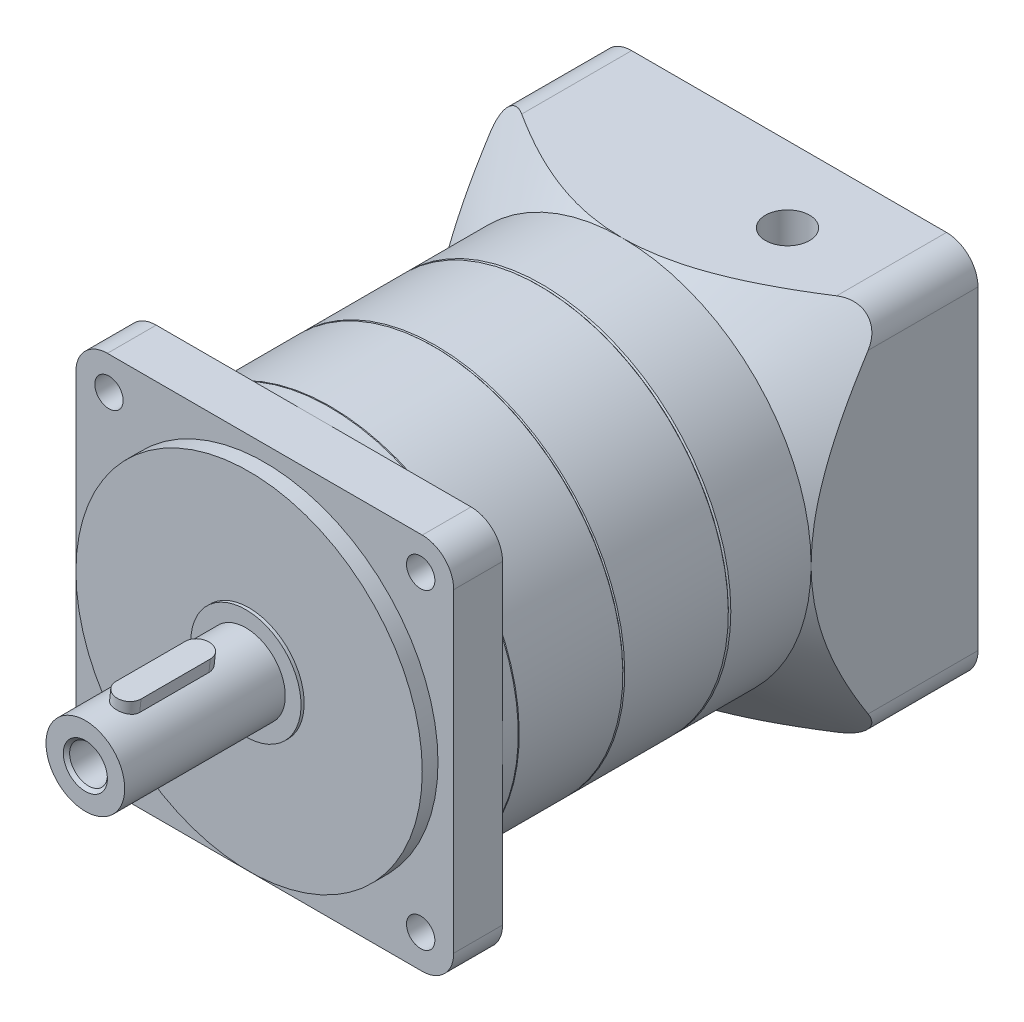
ISO-10303-21;
HEADER;
FILE_DESCRIPTION(('STEP AP214'),'2;1');
FILE_NAME('part.step','',(''),(''),'','','');
FILE_SCHEMA(('AUTOMOTIVE_DESIGN { 1 0 10303 214 1 1 1 1 }'));
ENDSEC;
DATA;
#1=APPLICATION_CONTEXT('core data for automotive mechanical design processes');
#2=APPLICATION_PROTOCOL_DEFINITION('international standard','automotive_design',2000,#1);
#3=PRODUCT_CONTEXT('',#1,'mechanical');
#4=PRODUCT('Part','Part','',(#3));
#5=PRODUCT_RELATED_PRODUCT_CATEGORY('part','',(#4));
#6=PRODUCT_DEFINITION_FORMATION('','',#4);
#7=PRODUCT_DEFINITION_CONTEXT('part definition',#1,'design');
#8=PRODUCT_DEFINITION('design','',#6,#7);
#9=PRODUCT_DEFINITION_SHAPE('','',#8);
#10=(LENGTH_UNIT() NAMED_UNIT(*) SI_UNIT(.MILLI.,.METRE.));
#11=(NAMED_UNIT(*) PLANE_ANGLE_UNIT() SI_UNIT($,.RADIAN.));
#12=(NAMED_UNIT(*) SI_UNIT($,.STERADIAN.) SOLID_ANGLE_UNIT());
#13=UNCERTAINTY_MEASURE_WITH_UNIT(LENGTH_MEASURE(1.E-05),#10,'distance_accuracy_value','');
#14=(GEOMETRIC_REPRESENTATION_CONTEXT(3) GLOBAL_UNCERTAINTY_ASSIGNED_CONTEXT((#13)) GLOBAL_UNIT_ASSIGNED_CONTEXT((#10,
#11,#12)) REPRESENTATION_CONTEXT('',''));
#15=CARTESIAN_POINT('',(0.,0.,0.));
#16=DIRECTION('',(0.,0.,1.));
#17=DIRECTION('',(1.,0.,0.));
#18=AXIS2_PLACEMENT_3D('',#15,#16,#17);
#19=CARTESIAN_POINT('',(40.1259505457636,-22.1506662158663,249.370553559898));
#20=DIRECTION('',(0.,0.,1.));
#21=DIRECTION('',(-0.814467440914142,0.580209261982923,0.));
#22=AXIS2_PLACEMENT_3D('',#19,#20,#21);
#23=PLANE('',#22);
#24=CARTESIAN_POINT('',(40.1259505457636,-22.1506662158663,249.370553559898));
#25=DIRECTION('',(0.,0.,1.));
#26=DIRECTION('',(-0.814467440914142,0.580209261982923,0.));
#27=AXIS2_PLACEMENT_3D('',#24,#25,#26);
#28=CIRCLE('',#27,59.7);
#29=CARTESIAN_POINT('',(-8.49775567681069,12.4878267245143,249.370553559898));
#30=VERTEX_POINT('',#29);
#31=EDGE_CURVE('P0_E17',#30,#30,#28,.T.);
#32=ORIENTED_EDGE('',*,*,#31,.F.);
#33=EDGE_LOOP('',(#32));
#34=FACE_BOUND('',#33,.T.);
#35=ADVANCED_FACE('P0_F14',(#34),#23,.F.);
#36=CARTESIAN_POINT('',(40.1259505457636,-22.1506662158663,249.670553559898));
#37=DIRECTION('',(0.,0.,1.));
#38=DIRECTION('',(-0.814467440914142,0.580209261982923,0.));
#39=AXIS2_PLACEMENT_3D('',#36,#37,#38);
#40=CONICAL_SURFACE('',#39,60.,0.785398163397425);
#41=CARTESIAN_POINT('',(40.1259505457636,-22.1506662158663,249.670553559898));
#42=DIRECTION('',(0.,0.,-1.));
#43=DIRECTION('',(0.814467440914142,-0.580209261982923,0.));
#44=AXIS2_PLACEMENT_3D('',#41,#42,#43);
#45=CIRCLE('',#44,60.);
#46=CARTESIAN_POINT('',(88.9939970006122,-56.9632219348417,249.670553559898));
#47=VERTEX_POINT('',#46);
#48=EDGE_CURVE('P0_E25',#47,#47,#45,.F.);
#49=ORIENTED_EDGE('',*,*,#48,.F.);
#50=EDGE_LOOP('',(#49));
#51=FACE_BOUND('',#50,.T.);
#52=ORIENTED_EDGE('',*,*,#31,.T.);
#53=EDGE_LOOP('',(#52));
#54=FACE_BOUND('',#53,.T.);
#55=ADVANCED_FACE('P0_F34',(#51,#54),#40,.T.);
#56=CARTESIAN_POINT('',(40.1259505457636,-22.1506662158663,282.870553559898));
#57=DIRECTION('',(0.,0.,-1.));
#58=DIRECTION('',(0.814467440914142,-0.580209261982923,0.));
#59=AXIS2_PLACEMENT_3D('',#56,#57,#58);
#60=CYLINDRICAL_SURFACE('',#59,60.);
#61=ORIENTED_EDGE('',*,*,#48,.T.);
#62=EDGE_LOOP('',(#61));
#63=FACE_BOUND('',#62,.T.);
#64=CARTESIAN_POINT('',(40.1259505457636,-22.1506662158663,282.570553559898));
#65=DIRECTION('',(0.,0.,-1.));
#66=DIRECTION('',(0.814467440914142,-0.580209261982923,0.));
#67=AXIS2_PLACEMENT_3D('',#64,#65,#66);
#68=CIRCLE('',#67,60.);
#69=CARTESIAN_POINT('',(88.9939970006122,-56.9632219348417,282.570553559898));
#70=VERTEX_POINT('',#69);
#71=EDGE_CURVE('P0_E21',#70,#70,#68,.F.);
#72=ORIENTED_EDGE('',*,*,#71,.F.);
#73=EDGE_LOOP('',(#72));
#74=FACE_BOUND('',#73,.T.);
#75=ADVANCED_FACE('P0_F41',(#63,#74),#60,.T.);
#76=CARTESIAN_POINT('',(40.1259505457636,-22.1506662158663,282.570553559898));
#77=DIRECTION('',(0.,0.,-1.));
#78=DIRECTION('',(0.814467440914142,-0.580209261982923,0.));
#79=AXIS2_PLACEMENT_3D('',#76,#77,#78);
#80=CONICAL_SURFACE('',#79,60.,0.785398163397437);
#81=ORIENTED_EDGE('',*,*,#71,.T.);
#82=EDGE_LOOP('',(#81));
#83=FACE_BOUND('',#82,.T.);
#84=CARTESIAN_POINT('',(40.1259505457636,-22.1506662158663,282.870553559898));
#85=DIRECTION('',(0.,0.,-1.));
#86=DIRECTION('',(0.814467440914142,-0.580209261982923,0.));
#87=AXIS2_PLACEMENT_3D('',#84,#85,#86);
#88=CIRCLE('',#87,59.7);
#89=CARTESIAN_POINT('',(88.7496567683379,-56.7891591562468,282.870553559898));
#90=VERTEX_POINT('',#89);
#91=EDGE_CURVE('P0_E9',#90,#90,#88,.F.);
#92=ORIENTED_EDGE('',*,*,#91,.F.);
#93=EDGE_LOOP('',(#92));
#94=FACE_BOUND('',#93,.T.);
#95=ADVANCED_FACE('P0_F45',(#83,#94),#80,.T.);
#96=CARTESIAN_POINT('',(40.1259505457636,-22.1506662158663,282.870553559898));
#97=DIRECTION('',(0.,0.,1.));
#98=DIRECTION('',(-0.814467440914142,0.580209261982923,0.));
#99=AXIS2_PLACEMENT_3D('',#96,#97,#98);
#100=PLANE('',#99);
#101=ORIENTED_EDGE('',*,*,#91,.T.);
#102=EDGE_LOOP('',(#101));
#103=FACE_BOUND('',#102,.T.);
#104=ADVANCED_FACE('P0_F43',(#103),#100,.T.);
#105=CLOSED_SHELL('',(#35,#55,#75,#95,#104));
#106=MANIFOLD_SOLID_BREP('P0_B1',#105);
#107=CARTESIAN_POINT('',(40.1259505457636,-22.1506662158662,230.870553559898));
#108=DIRECTION('',(0.,0.,-1.));
#109=DIRECTION('',(-1.,0.,0.));
#110=AXIS2_PLACEMENT_3D('',#107,#108,#109);
#111=PLANE('',#110);
#112=CARTESIAN_POINT('',(40.1259505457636,-22.1506662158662,230.870553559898));
#113=DIRECTION('',(0.,0.,-1.));
#114=DIRECTION('',(-1.,0.,0.));
#115=AXIS2_PLACEMENT_3D('',#112,#113,#114);
#116=CIRCLE('',#115,12.);
#117=CARTESIAN_POINT('',(28.1259505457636,-22.1506662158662,230.870553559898));
#118=VERTEX_POINT('',#117);
#119=EDGE_CURVE('P1_E422',#118,#118,#116,.T.);
#120=ORIENTED_EDGE('',*,*,#119,.T.);
#121=EDGE_LOOP('',(#120));
#122=FACE_BOUND('',#121,.T.);
#123=ADVANCED_FACE('P1_F17',(#122),#111,.T.);
#124=CARTESIAN_POINT('',(40.1259505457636,-22.1506662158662,230.870553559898));
#125=DIRECTION('',(0.,0.,-1.));
#126=DIRECTION('',(-1.,0.,0.));
#127=AXIS2_PLACEMENT_3D('',#124,#125,#126);
#128=CYLINDRICAL_SURFACE('',#127,12.);
#129=CARTESIAN_POINT('',(40.1259505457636,-22.1506662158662,181.370553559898));
#130=DIRECTION('',(0.,0.,-1.));
#131=DIRECTION('',(-1.,0.,0.));
#132=AXIS2_PLACEMENT_3D('',#129,#130,#131);
#133=CIRCLE('',#132,12.);
#134=CARTESIAN_POINT('',(28.1259505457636,-22.1506662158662,181.370553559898));
#135=VERTEX_POINT('',#134);
#136=EDGE_CURVE('P1_E425',#135,#135,#133,.F.);
#137=ORIENTED_EDGE('',*,*,#136,.F.);
#138=EDGE_LOOP('',(#137));
#139=FACE_BOUND('',#138,.T.);
#140=ORIENTED_EDGE('',*,*,#119,.F.);
#141=EDGE_LOOP('',(#140));
#142=FACE_BOUND('',#141,.T.);
#143=ADVANCED_FACE('P1_F629',(#139,#142),#128,.F.);
#144=CARTESIAN_POINT('',(40.1259505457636,-22.1506662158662,181.370553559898));
#145=DIRECTION('',(0.,0.,-1.));
#146=DIRECTION('',(-1.,0.,0.));
#147=AXIS2_PLACEMENT_3D('',#144,#145,#146);
#148=PLANE('',#147);
#149=CARTESIAN_POINT('',(40.1259505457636,-22.1506662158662,181.370553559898));
#150=DIRECTION('',(0.,0.,1.));
#151=DIRECTION('',(1.,0.,0.));
#152=AXIS2_PLACEMENT_3D('',#149,#150,#151);
#153=CIRCLE('',#152,20.);
#154=CARTESIAN_POINT('',(60.1259505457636,-22.1506662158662,181.370553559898));
#155=VERTEX_POINT('',#154);
#156=EDGE_CURVE('P1_E428',#155,#155,#153,.T.);
#157=ORIENTED_EDGE('',*,*,#156,.F.);
#158=EDGE_LOOP('',(#157));
#159=FACE_BOUND('',#158,.T.);
#160=ORIENTED_EDGE('',*,*,#136,.T.);
#161=EDGE_LOOP('',(#160));
#162=FACE_BOUND('',#161,.T.);
#163=ADVANCED_FACE('P1_F620',(#159,#162),#148,.T.);
#164=CARTESIAN_POINT('',(40.1259505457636,-22.1506662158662,181.370553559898));
#165=DIRECTION('',(0.,0.,1.));
#166=DIRECTION('',(1.,0.,0.));
#167=AXIS2_PLACEMENT_3D('',#164,#165,#166);
#168=CYLINDRICAL_SURFACE('',#167,20.);
#169=CARTESIAN_POINT('',(40.1259505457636,-22.1506662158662,234.370553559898));
#170=DIRECTION('',(0.,0.,1.));
#171=DIRECTION('',(1.,0.,0.));
#172=AXIS2_PLACEMENT_3D('',#169,#170,#171);
#173=CIRCLE('',#172,20.);
#174=CARTESIAN_POINT('',(60.1259505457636,-22.1506662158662,234.370553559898));
#175=VERTEX_POINT('',#174);
#176=EDGE_CURVE('P1_E431',#175,#175,#173,.T.);
#177=ORIENTED_EDGE('',*,*,#176,.F.);
#178=EDGE_LOOP('',(#177));
#179=FACE_BOUND('',#178,.T.);
#180=ORIENTED_EDGE('',*,*,#156,.T.);
#181=EDGE_LOOP('',(#180));
#182=FACE_BOUND('',#181,.T.);
#183=ADVANCED_FACE('P1_F611',(#179,#182),#168,.T.);
#184=CARTESIAN_POINT('',(40.1259505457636,-22.1506662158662,234.370553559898));
#185=DIRECTION('',(0.,0.,-1.));
#186=DIRECTION('',(-1.,0.,0.));
#187=AXIS2_PLACEMENT_3D('',#184,#185,#186);
#188=PLANE('',#187);
#189=ORIENTED_EDGE('',*,*,#176,.T.);
#190=EDGE_LOOP('',(#189));
#191=FACE_BOUND('',#190,.T.);
#192=CARTESIAN_POINT('',(40.1259505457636,-22.1506662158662,234.370553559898));
#193=DIRECTION('',(0.,0.,-1.));
#194=DIRECTION('',(-1.,0.,0.));
#195=AXIS2_PLACEMENT_3D('',#192,#193,#194);
#196=CIRCLE('',#195,40.);
#197=CARTESIAN_POINT('',(0.125950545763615,-22.1506662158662,234.370553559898));
#198=VERTEX_POINT('',#197);
#199=EDGE_CURVE('P1_E437',#198,#198,#196,.T.);
#200=ORIENTED_EDGE('',*,*,#199,.T.);
#201=EDGE_LOOP('',(#200));
#202=FACE_BOUND('',#201,.T.);
#203=ADVANCED_FACE('P1_F602',(#191,#202),#188,.T.);
#204=CARTESIAN_POINT('',(86.0878913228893,23.8112745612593,190.370553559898));
#205=DIRECTION('',(0.,0.,-1.));
#206=DIRECTION('',(-1.,0.,0.));
#207=AXIS2_PLACEMENT_3D('',#204,#205,#206);
#208=PLANE('',#207);
#209=CARTESIAN_POINT('',(86.0878913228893,23.8112745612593,190.370553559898));
#210=DIRECTION('',(0.,0.,-1.));
#211=DIRECTION('',(-1.,0.,0.));
#212=AXIS2_PLACEMENT_3D('',#209,#210,#211);
#213=CIRCLE('',#212,4.);
#214=CARTESIAN_POINT('',(82.0878913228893,23.8112745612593,190.370553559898));
#215=VERTEX_POINT('',#214);
#216=EDGE_CURVE('P1_E440',#215,#215,#213,.T.);
#217=ORIENTED_EDGE('',*,*,#216,.T.);
#218=EDGE_LOOP('',(#217));
#219=FACE_BOUND('',#218,.T.);
#220=ADVANCED_FACE('P1_F593',(#219),#208,.T.);
#221=CARTESIAN_POINT('',(86.0878913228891,-68.1126069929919,190.370553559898));
#222=DIRECTION('',(0.,0.,-1.));
#223=DIRECTION('',(-1.,0.,0.));
#224=AXIS2_PLACEMENT_3D('',#221,#222,#223);
#225=PLANE('',#224);
#226=CARTESIAN_POINT('',(86.0878913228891,-68.1126069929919,190.370553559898));
#227=DIRECTION('',(0.,0.,-1.));
#228=DIRECTION('',(-1.,0.,0.));
#229=AXIS2_PLACEMENT_3D('',#226,#227,#228);
#230=CIRCLE('',#229,4.);
#231=CARTESIAN_POINT('',(82.0878913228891,-68.1126069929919,190.370553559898));
#232=VERTEX_POINT('',#231);
#233=EDGE_CURVE('P1_E443',#232,#232,#230,.T.);
#234=ORIENTED_EDGE('',*,*,#233,.T.);
#235=EDGE_LOOP('',(#234));
#236=FACE_BOUND('',#235,.T.);
#237=ADVANCED_FACE('P1_F584',(#236),#225,.T.);
#238=CARTESIAN_POINT('',(-5.83599023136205,-68.1126069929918,190.370553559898));
#239=DIRECTION('',(0.,0.,-1.));
#240=DIRECTION('',(-1.,0.,0.));
#241=AXIS2_PLACEMENT_3D('',#238,#239,#240);
#242=PLANE('',#241);
#243=CARTESIAN_POINT('',(-5.83599023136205,-68.1126069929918,190.370553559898));
#244=DIRECTION('',(0.,0.,-1.));
#245=DIRECTION('',(-1.,0.,0.));
#246=AXIS2_PLACEMENT_3D('',#243,#244,#245);
#247=CIRCLE('',#246,4.);
#248=CARTESIAN_POINT('',(-9.83599023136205,-68.1126069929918,190.370553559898));
#249=VERTEX_POINT('',#248);
#250=EDGE_CURVE('P1_E446',#249,#249,#247,.T.);
#251=ORIENTED_EDGE('',*,*,#250,.T.);
#252=EDGE_LOOP('',(#251));
#253=FACE_BOUND('',#252,.T.);
#254=ADVANCED_FACE('P1_F576',(#253),#242,.T.);
#255=CARTESIAN_POINT('',(-5.8359902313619,23.8112745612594,190.370553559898));
#256=DIRECTION('',(0.,0.,-1.));
#257=DIRECTION('',(-1.,0.,0.));
#258=AXIS2_PLACEMENT_3D('',#255,#256,#257);
#259=PLANE('',#258);
#260=CARTESIAN_POINT('',(-5.8359902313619,23.8112745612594,190.370553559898));
#261=DIRECTION('',(0.,0.,-1.));
#262=DIRECTION('',(-1.,0.,0.));
#263=AXIS2_PLACEMENT_3D('',#260,#261,#262);
#264=CIRCLE('',#263,3.99999999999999);
#265=CARTESIAN_POINT('',(-9.83599023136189,23.8112745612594,190.370553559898));
#266=VERTEX_POINT('',#265);
#267=EDGE_CURVE('P1_E448',#266,#266,#264,.T.);
#268=ORIENTED_EDGE('',*,*,#267,.T.);
#269=EDGE_LOOP('',(#268));
#270=FACE_BOUND('',#269,.T.);
#271=ADVANCED_FACE('P1_F569',(#270),#259,.T.);
#272=CARTESIAN_POINT('',(40.1259505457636,-22.1506662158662,177.370553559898));
#273=DIRECTION('',(0.,0.,-1.));
#274=DIRECTION('',(-1.,0.,0.));
#275=AXIS2_PLACEMENT_3D('',#272,#273,#274);
#276=PLANE('',#275);
#277=CARTESIAN_POINT('',(40.1259505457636,-22.1506662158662,177.370553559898));
#278=DIRECTION('',(0.,0.,-1.));
#279=DIRECTION('',(-1.,0.,0.));
#280=AXIS2_PLACEMENT_3D('',#277,#278,#279);
#281=CIRCLE('',#280,55.);
#282=CARTESIAN_POINT('',(-14.8740494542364,-22.1506662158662,177.370553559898));
#283=VERTEX_POINT('',#282);
#284=EDGE_CURVE('P1_E259',#283,#283,#281,.T.);
#285=ORIENTED_EDGE('',*,*,#284,.T.);
#286=EDGE_LOOP('',(#285));
#287=FACE_BOUND('',#286,.T.);
#288=CARTESIAN_POINT('',(40.1259505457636,-22.1506662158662,177.370553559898));
#289=DIRECTION('',(0.,0.,-1.));
#290=DIRECTION('',(-1.,0.,0.));
#291=AXIS2_PLACEMENT_3D('',#288,#289,#290);
#292=CIRCLE('',#291,40.);
#293=CARTESIAN_POINT('',(0.125950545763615,-22.1506662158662,177.370553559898));
#294=VERTEX_POINT('',#293);
#295=EDGE_CURVE('P1_E434',#294,#294,#292,.F.);
#296=ORIENTED_EDGE('',*,*,#295,.T.);
#297=EDGE_LOOP('',(#296));
#298=FACE_BOUND('',#297,.T.);
#299=ADVANCED_FACE('P1_F292',(#287,#298),#276,.T.);
#300=CARTESIAN_POINT('',(40.1259505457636,-22.1506662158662,234.370553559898));
#301=DIRECTION('',(0.,0.,-1.));
#302=DIRECTION('',(-1.,0.,0.));
#303=AXIS2_PLACEMENT_3D('',#300,#301,#302);
#304=CYLINDRICAL_SURFACE('',#303,40.);
#305=ORIENTED_EDGE('',*,*,#199,.F.);
#306=EDGE_LOOP('',(#305));
#307=FACE_BOUND('',#306,.T.);
#308=CARTESIAN_POINT('',(63.6259505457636,10.2183004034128,201.370553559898));
#309=CARTESIAN_POINT('',(63.8657775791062,10.0441848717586,201.370555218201));
#310=CARTESIAN_POINT('',(64.1036770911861,9.86738908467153,201.358231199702));
#311=CARTESIAN_POINT('',(64.5740723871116,9.50966734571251,201.310077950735));
#312=CARTESIAN_POINT('',(64.8065652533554,9.32873926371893,201.274236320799));
#313=CARTESIAN_POINT('',(65.265383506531,8.96356097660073,201.179905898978));
#314=CARTESIAN_POINT('',(65.4916883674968,8.77930245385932,201.121349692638));
#315=CARTESIAN_POINT('',(65.9362103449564,8.40934208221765,200.982430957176));
#316=CARTESIAN_POINT('',(66.1544285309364,8.22364042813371,200.902071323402));
#317=CARTESIAN_POINT('',(66.5911924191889,7.84397221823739,200.716114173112));
#318=CARTESIAN_POINT('',(66.8093285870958,7.65000215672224,200.609560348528));
#319=CARTESIAN_POINT('',(67.2345606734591,7.2637142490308,200.373642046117));
#320=CARTESIAN_POINT('',(67.4416542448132,7.07139676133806,200.244272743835));
#321=CARTESIAN_POINT('',(67.8431838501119,6.69082086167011,199.962955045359));
#322=CARTESIAN_POINT('',(68.0376384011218,6.50255679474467,199.811040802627));
#323=CARTESIAN_POINT('',(68.4126629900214,6.13238922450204,199.484185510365));
#324=CARTESIAN_POINT('',(68.5932396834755,5.95048269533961,199.30925560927));
#325=CARTESIAN_POINT('',(68.8793316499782,5.65705770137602,198.999795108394));
#326=CARTESIAN_POINT('',(68.9893426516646,5.54280357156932,198.871997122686));
#327=CARTESIAN_POINT('',(69.2018394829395,5.31961760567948,198.60593609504));
#328=CARTESIAN_POINT('',(69.3043242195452,5.21068654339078,198.467671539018));
#329=CARTESIAN_POINT('',(69.5989433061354,4.89420592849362,198.037182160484));
#330=CARTESIAN_POINT('',(69.7787717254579,4.69642181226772,197.728699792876));
#331=CARTESIAN_POINT('',(70.0568559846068,4.38560132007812,197.149014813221));
#332=CARTESIAN_POINT('',(70.1643087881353,4.26366268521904,196.887090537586));
#333=CARTESIAN_POINT('',(70.3029165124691,4.10491720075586,196.477429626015));
#334=CARTESIAN_POINT('',(70.345350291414,4.0560372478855,196.338112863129));
#335=CARTESIAN_POINT('',(70.4220002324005,3.96738908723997,196.054381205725));
#336=CARTESIAN_POINT('',(70.4562176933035,3.92761943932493,195.909967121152));
#337=CARTESIAN_POINT('',(70.5113020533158,3.86340550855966,195.638682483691));
#338=CARTESIAN_POINT('',(70.5333968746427,3.83756248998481,195.512390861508));
#339=CARTESIAN_POINT('',(70.5707332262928,3.79381369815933,195.257447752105));
#340=CARTESIAN_POINT('',(70.585975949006,3.77590654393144,195.128796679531));
#341=CARTESIAN_POINT('',(70.6093168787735,3.74845931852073,194.870017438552));
#342=CARTESIAN_POINT('',(70.6174184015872,3.73891536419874,194.739889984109));
#343=CARTESIAN_POINT('',(70.6263264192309,3.72842032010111,194.479034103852));
#344=CARTESIAN_POINT('',(70.6271327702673,3.72746939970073,194.348305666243));
#345=CARTESIAN_POINT('',(70.6214325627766,3.73418640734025,194.087203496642));
#346=CARTESIAN_POINT('',(70.6149244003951,3.74185622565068,193.956829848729));
#347=CARTESIAN_POINT('',(70.5947254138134,3.76562208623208,193.697423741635));
#348=CARTESIAN_POINT('',(70.581034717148,3.78171797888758,193.56839125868));
#349=CARTESIAN_POINT('',(70.5467240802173,3.82195848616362,193.312454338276));
#350=CARTESIAN_POINT('',(70.5261002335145,3.84610763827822,193.185551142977));
#351=CARTESIAN_POINT('',(70.4782877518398,3.90191474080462,192.934658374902));
#352=CARTESIAN_POINT('',(70.4510976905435,3.9335743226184,192.810669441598));
#353=CARTESIAN_POINT('',(70.3824455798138,4.01320117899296,192.5333606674));
#354=CARTESIAN_POINT('',(70.3391116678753,4.06326471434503,192.381101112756));
#355=CARTESIAN_POINT('',(70.2434960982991,4.17306393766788,192.083060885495));
#356=CARTESIAN_POINT('',(70.1912122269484,4.23280201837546,191.93728182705));
#357=CARTESIAN_POINT('',(70.0221239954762,4.42465504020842,191.509994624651));
#358=CARTESIAN_POINT('',(69.8931467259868,4.56933383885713,191.238784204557));
#359=CARTESIAN_POINT('',(69.6503854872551,4.83693166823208,190.799871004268));
#360=CARTESIAN_POINT('',(69.5429558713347,4.9540837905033,190.624882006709));
#361=CARTESIAN_POINT('',(69.3166202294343,5.19768681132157,190.289228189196));
#362=CARTESIAN_POINT('',(69.1977095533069,5.32414147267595,190.128569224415));
#363=CARTESIAN_POINT('',(68.949636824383,5.58428442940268,189.821106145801));
#364=CARTESIAN_POINT('',(68.8204572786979,5.71798493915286,189.674326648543));
#365=CARTESIAN_POINT('',(68.5531065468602,5.99064287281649,189.394555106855));
#366=CARTESIAN_POINT('',(68.4149355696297,6.12960017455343,189.261562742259));
#367=CARTESIAN_POINT('',(68.0847726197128,6.45657294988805,188.968512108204));
#368=CARTESIAN_POINT('',(67.8897383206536,6.64602132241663,188.81346422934));
#369=CARTESIAN_POINT('',(67.4869940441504,7.02896017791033,188.526453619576));
#370=CARTESIAN_POINT('',(67.2792797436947,7.22245202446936,188.394498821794));
#371=CARTESIAN_POINT('',(66.8527231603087,7.6111005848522,188.153815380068));
#372=CARTESIAN_POINT('',(66.6338923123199,7.80625542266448,188.045063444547));
#373=CARTESIAN_POINT('',(66.1862058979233,8.19651359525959,187.850998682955));
#374=CARTESIAN_POINT('',(65.9573533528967,8.39161692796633,187.765678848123));
#375=CARTESIAN_POINT('',(65.3899663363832,8.86413946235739,187.587422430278));
#376=CARTESIAN_POINT('',(65.0467095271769,9.1407562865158,187.507081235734));
#377=CARTESIAN_POINT('',(64.3457373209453,9.68640534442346,187.398634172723));
#378=CARTESIAN_POINT('',(63.9880148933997,9.95543377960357,187.370554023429));
#379=CARTESIAN_POINT('',(63.3842189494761,10.3938028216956,187.370553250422));
#380=CARTESIAN_POINT('',(63.1405519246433,10.5665585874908,187.383069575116));
#381=CARTESIAN_POINT('',(62.6511661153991,10.9053943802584,187.434393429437));
#382=CARTESIAN_POINT('',(62.4054468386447,11.0714727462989,187.473207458));
#383=CARTESIAN_POINT('',(61.9147090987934,11.3953677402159,187.57830980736));
#384=CARTESIAN_POINT('',(61.6696902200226,11.5531912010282,187.644574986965));
#385=CARTESIAN_POINT('',(61.1831324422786,11.8592968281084,187.805628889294));
#386=CARTESIAN_POINT('',(60.9415920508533,12.0075831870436,187.900404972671));
#387=CARTESIAN_POINT('',(60.5317858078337,12.2534337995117,188.088683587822));
#388=CARTESIAN_POINT('',(60.3618509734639,12.3536208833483,188.175186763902));
#389=CARTESIAN_POINT('',(60.0270272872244,12.547814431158,188.363505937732));
#390=CARTESIAN_POINT('',(59.8621373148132,12.6418222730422,188.465318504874));
#391=CARTESIAN_POINT('',(59.5390218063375,12.8231379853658,188.684160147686));
#392=CARTESIAN_POINT('',(59.3807931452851,12.9104490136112,188.801181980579));
#393=CARTESIAN_POINT('',(59.0725595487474,13.077969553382,189.050226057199));
#394=CARTESIAN_POINT('',(58.9225549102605,13.1581788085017,189.182248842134));
#395=CARTESIAN_POINT('',(58.6316656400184,13.3115065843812,189.46158174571));
#396=CARTESIAN_POINT('',(58.4908370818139,13.3845826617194,189.608973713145));
#397=CARTESIAN_POINT('',(58.220971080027,13.5227583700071,189.9176642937));
#398=CARTESIAN_POINT('',(58.0919338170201,13.5878578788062,190.07896311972));
#399=CARTESIAN_POINT('',(57.8473783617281,13.7097530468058,190.414396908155));
#400=CARTESIAN_POINT('',(57.7318575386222,13.7665503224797,190.58852936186));
#401=CARTESIAN_POINT('',(57.5159156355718,13.871598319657,190.948348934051));
#402=CARTESIAN_POINT('',(57.4154929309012,13.9198499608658,191.134034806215));
#403=CARTESIAN_POINT('',(57.2403746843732,14.0032400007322,191.496394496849));
#404=CARTESIAN_POINT('',(57.1641127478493,14.0392059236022,191.672123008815));
#405=CARTESIAN_POINT('',(57.0259087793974,14.1039506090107,192.030402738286));
#406=CARTESIAN_POINT('',(56.963965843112,14.1327298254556,192.212953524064));
#407=CARTESIAN_POINT('',(56.8551780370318,14.1830170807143,192.583405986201));
#408=CARTESIAN_POINT('',(56.8083278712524,14.2045276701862,192.771305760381));
#409=CARTESIAN_POINT('',(56.7302796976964,14.2402406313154,193.151010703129));
#410=CARTESIAN_POINT('',(56.6990811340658,14.2544432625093,193.342815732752));
#411=CARTESIAN_POINT('',(56.6541773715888,14.2748506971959,193.716660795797));
#412=CARTESIAN_POINT('',(56.6394993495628,14.2815005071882,193.898560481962));
#413=CARTESIAN_POINT('',(56.6243995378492,14.288341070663,194.263068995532));
#414=CARTESIAN_POINT('',(56.6239772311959,14.2885320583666,194.445677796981));
#415=CARTESIAN_POINT('',(56.637392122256,14.2824553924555,194.810231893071));
#416=CARTESIAN_POINT('',(56.6512270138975,14.2761887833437,194.99217729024));
#417=CARTESIAN_POINT('',(56.6929991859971,14.2572096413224,195.354102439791));
#418=CARTESIAN_POINT('',(56.7209364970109,14.2444970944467,195.534082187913));
#419=CARTESIAN_POINT('',(56.7900346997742,14.2129105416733,195.887855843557));
#420=CARTESIAN_POINT('',(56.8309721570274,14.1941405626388,196.061702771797));
#421=CARTESIAN_POINT('',(56.9257747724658,14.1504168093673,196.405100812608));
#422=CARTESIAN_POINT('',(56.9796442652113,14.1254609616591,196.574650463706));
#423=CARTESIAN_POINT('',(57.0997272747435,14.0694288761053,196.908235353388));
#424=CARTESIAN_POINT('',(57.1659383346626,14.0383538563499,197.072271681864));
#425=CARTESIAN_POINT('',(57.3100330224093,13.970154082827,197.393834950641));
#426=CARTESIAN_POINT('',(57.3879172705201,13.933029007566,197.551361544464));
#427=CARTESIAN_POINT('',(57.5562831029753,13.8520060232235,197.862115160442));
#428=CARTESIAN_POINT('',(57.6469902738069,13.8079848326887,198.015187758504));
#429=CARTESIAN_POINT('',(57.8388220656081,13.7138788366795,198.312694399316));
#430=CARTESIAN_POINT('',(57.9399469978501,13.663793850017,198.457128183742));
#431=CARTESIAN_POINT('',(58.1516086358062,13.5577313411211,198.736593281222));
#432=CARTESIAN_POINT('',(58.2621442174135,13.5017545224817,198.87162571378));
#433=CARTESIAN_POINT('',(58.4916395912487,13.3840787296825,199.131745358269));
#434=CARTESIAN_POINT('',(58.6106023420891,13.322377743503,199.256829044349));
#435=CARTESIAN_POINT('',(58.8631921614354,13.1896410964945,199.503696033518));
#436=CARTESIAN_POINT('',(58.9972707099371,13.118268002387,199.624835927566));
#437=CARTESIAN_POINT('',(59.272455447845,12.9696386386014,199.855011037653));
#438=CARTESIAN_POINT('',(59.4135642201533,12.8923802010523,199.964041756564));
#439=CARTESIAN_POINT('',(59.7015603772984,12.7323187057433,200.169732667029));
#440=CARTESIAN_POINT('',(59.8484485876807,12.6495148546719,200.266391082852));
#441=CARTESIAN_POINT('',(60.1468556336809,12.478699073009,200.447259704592));
#442=CARTESIAN_POINT('',(60.2983761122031,12.3906852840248,200.53146543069));
#443=CARTESIAN_POINT('',(60.6213819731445,12.2001136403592,200.695806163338));
#444=CARTESIAN_POINT('',(60.7932635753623,12.0970090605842,200.774532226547));
#445=CARTESIAN_POINT('',(61.1399428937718,11.8853958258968,200.91692189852));
#446=CARTESIAN_POINT('',(61.3147418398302,11.7768848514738,200.980578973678));
#447=CARTESIAN_POINT('',(61.8413077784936,11.4441950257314,201.149242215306));
#448=CARTESIAN_POINT('',(62.1957447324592,11.2125652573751,201.232190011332));
#449=CARTESIAN_POINT('',(62.7295669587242,10.8512208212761,201.315338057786));
#450=CARTESIAN_POINT('',(62.9098863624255,10.7269938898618,201.336166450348));
#451=CARTESIAN_POINT('',(63.2691404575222,10.4751020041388,201.363770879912));
#452=CARTESIAN_POINT('',(63.4480756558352,10.347438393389,201.370552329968));
#453=CARTESIAN_POINT('',(63.6259505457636,10.2183004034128,201.370553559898));
#454=B_SPLINE_CURVE_WITH_KNOTS('',3,(#308,#309,#310,#311,#312,#313,#314,#315,#316,#317,#318,
#319,#320,#321,#322,#323,#324,#325,#326,#327,#328,#329,#330,#331,#332,#333,#334,#335,#336,#337,
#338,#339,#340,#341,#342,#343,#344,#345,#346,#347,#348,#349,#350,#351,#352,#353,#354,#355,#356,
#357,#358,#359,#360,#361,#362,#363,#364,#365,#366,#367,#368,#369,#370,#371,#372,#373,#374,#375,
#376,#377,#378,#379,#380,#381,#382,#383,#384,#385,#386,#387,#388,#389,#390,#391,#392,#393,#394,
#395,#396,#397,#398,#399,#400,#401,#402,#403,#404,#405,#406,#407,#408,#409,#410,#411,#412,#413,
#414,#415,#416,#417,#418,#419,#420,#421,#422,#423,#424,#425,#426,#427,#428,#429,#430,#431,#432,
#433,#434,#435,#436,#437,#438,#439,#440,#441,#442,#443,#444,#445,#446,#447,#448,#449,#450,#451,
#452,#453),.UNSPECIFIED.,.T.,.F.,(4,2,2,2,2,2,2,2,2,2,2,2,2,2,2,2,2,2,2,2,2,2,2,2,2,2,2,2,2,2,2,
2,2,2,2,2,2,2,2,2,2,2,2,2,2,2,2,2,2,2,2,2,2,2,2,2,2,2,2,2,2,2,2,2,2,2,2,2,2,2,2,2,4),(0.,
0.888878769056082,1.77822656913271,2.67023430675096,3.56212364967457,4.49332574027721,
5.42472497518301,6.35472736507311,7.28428092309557,7.89488966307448,8.5055869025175,
9.7241674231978,10.6453197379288,11.1056925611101,11.5659925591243,11.9579472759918,
12.3498337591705,12.7415381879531,13.1332503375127,13.5250483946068,13.9168394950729,
14.3088517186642,14.7009491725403,15.1982931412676,15.6957603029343,16.6914843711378,
17.3998991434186,18.1086020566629,18.8185392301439,19.5284599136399,20.4662027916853,
21.4042671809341,22.3413854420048,23.2782230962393,24.6192511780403,25.9609390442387,
26.8567144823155,27.7527113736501,28.6479544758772,29.5428012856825,30.1883812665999,
30.8338167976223,31.478946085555,32.124098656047,32.7728818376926,33.4216749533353,
34.0703415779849,34.7189383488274,35.3029146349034,35.8868540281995,36.4705882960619,
37.0543018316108,37.6014749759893,38.1486282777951,38.6956930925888,39.2427590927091,
39.7808898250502,40.3192011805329,40.8574054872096,41.3956384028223,41.9449092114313,
42.4941964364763,43.0434181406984,43.592833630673,44.1750662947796,44.757514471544,
45.3400461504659,45.9227868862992,46.568125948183,47.2137443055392,48.5031023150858,
49.1626200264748,49.8218835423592),.UNSPECIFIED.);
#455=CARTESIAN_POINT('',(63.6259505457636,10.2183004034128,201.370553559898));
#456=VERTEX_POINT('',#455);
#457=EDGE_CURVE('P1_E253',#456,#456,#454,.T.);
#458=ORIENTED_EDGE('',*,*,#457,.T.);
#459=EDGE_LOOP('',(#458));
#460=FACE_BOUND('',#459,.T.);
#461=ORIENTED_EDGE('',*,*,#295,.F.);
#462=EDGE_LOOP('',(#461));
#463=FACE_BOUND('',#462,.T.);
#464=ADVANCED_FACE('P1_F261',(#307,#460,#463),#304,.F.);
#465=CARTESIAN_POINT('',(86.0878913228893,23.8112745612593,190.370553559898));
#466=DIRECTION('',(0.,0.,-1.));
#467=DIRECTION('',(-1.,0.,0.));
#468=AXIS2_PLACEMENT_3D('',#465,#466,#467);
#469=CYLINDRICAL_SURFACE('',#468,4.);
#470=ORIENTED_EDGE('',*,*,#216,.F.);
#471=EDGE_LOOP('',(#470));
#472=FACE_BOUND('',#471,.T.);
#473=CARTESIAN_POINT('',(86.0878913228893,23.8112745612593,170.370553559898));
#474=DIRECTION('',(0.,0.,-1.));
#475=DIRECTION('',(-1.,0.,0.));
#476=AXIS2_PLACEMENT_3D('',#473,#474,#475);
#477=CIRCLE('',#476,4.);
#478=CARTESIAN_POINT('',(82.0878913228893,23.8112745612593,170.370553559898));
#479=VERTEX_POINT('',#478);
#480=EDGE_CURVE('P1_E250',#479,#479,#477,.T.);
#481=ORIENTED_EDGE('',*,*,#480,.T.);
#482=EDGE_LOOP('',(#481));
#483=FACE_BOUND('',#482,.T.);
#484=ADVANCED_FACE('P1_F284',(#472,#483),#469,.F.);
#485=CARTESIAN_POINT('',(86.0878913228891,-68.1126069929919,190.370553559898));
#486=DIRECTION('',(0.,0.,-1.));
#487=DIRECTION('',(-1.,0.,0.));
#488=AXIS2_PLACEMENT_3D('',#485,#486,#487);
#489=CYLINDRICAL_SURFACE('',#488,4.);
#490=ORIENTED_EDGE('',*,*,#233,.F.);
#491=EDGE_LOOP('',(#490));
#492=FACE_BOUND('',#491,.T.);
#493=CARTESIAN_POINT('',(86.0878913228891,-68.1126069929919,170.370553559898));
#494=DIRECTION('',(0.,0.,-1.));
#495=DIRECTION('',(-1.,0.,0.));
#496=AXIS2_PLACEMENT_3D('',#493,#494,#495);
#497=CIRCLE('',#496,4.);
#498=CARTESIAN_POINT('',(82.0878913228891,-68.1126069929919,170.370553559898));
#499=VERTEX_POINT('',#498);
#500=EDGE_CURVE('P1_E247',#499,#499,#497,.T.);
#501=ORIENTED_EDGE('',*,*,#500,.T.);
#502=EDGE_LOOP('',(#501));
#503=FACE_BOUND('',#502,.T.);
#504=ADVANCED_FACE('P1_F281',(#492,#503),#489,.F.);
#505=CARTESIAN_POINT('',(-5.83599023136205,-68.1126069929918,190.370553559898));
#506=DIRECTION('',(0.,0.,-1.));
#507=DIRECTION('',(-1.,0.,0.));
#508=AXIS2_PLACEMENT_3D('',#505,#506,#507);
#509=CYLINDRICAL_SURFACE('',#508,4.);
#510=ORIENTED_EDGE('',*,*,#250,.F.);
#511=EDGE_LOOP('',(#510));
#512=FACE_BOUND('',#511,.T.);
#513=CARTESIAN_POINT('',(-5.83599023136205,-68.1126069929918,170.370553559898));
#514=DIRECTION('',(0.,0.,-1.));
#515=DIRECTION('',(-1.,0.,0.));
#516=AXIS2_PLACEMENT_3D('',#513,#514,#515);
#517=CIRCLE('',#516,4.);
#518=CARTESIAN_POINT('',(-9.83599023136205,-68.1126069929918,170.370553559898));
#519=VERTEX_POINT('',#518);
#520=EDGE_CURVE('P1_E244',#519,#519,#517,.T.);
#521=ORIENTED_EDGE('',*,*,#520,.T.);
#522=EDGE_LOOP('',(#521));
#523=FACE_BOUND('',#522,.T.);
#524=ADVANCED_FACE('P1_F277',(#512,#523),#509,.F.);
#525=CARTESIAN_POINT('',(-5.8359902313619,23.8112745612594,190.370553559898));
#526=DIRECTION('',(0.,0.,-1.));
#527=DIRECTION('',(-1.,0.,0.));
#528=AXIS2_PLACEMENT_3D('',#525,#526,#527);
#529=CYLINDRICAL_SURFACE('',#528,3.99999999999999);
#530=ORIENTED_EDGE('',*,*,#267,.F.);
#531=EDGE_LOOP('',(#530));
#532=FACE_BOUND('',#531,.T.);
#533=CARTESIAN_POINT('',(-5.8359902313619,23.8112745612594,170.370553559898));
#534=DIRECTION('',(0.,0.,-1.));
#535=DIRECTION('',(-1.,0.,0.));
#536=AXIS2_PLACEMENT_3D('',#533,#534,#535);
#537=CIRCLE('',#536,3.99999999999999);
#538=CARTESIAN_POINT('',(-9.83599023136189,23.8112745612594,170.370553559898));
#539=VERTEX_POINT('',#538);
#540=EDGE_CURVE('P1_E241',#539,#539,#537,.T.);
#541=ORIENTED_EDGE('',*,*,#540,.T.);
#542=EDGE_LOOP('',(#541));
#543=FACE_BOUND('',#542,.T.);
#544=ADVANCED_FACE('P1_F273',(#532,#543),#529,.F.);
#545=CARTESIAN_POINT('',(40.1259505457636,-22.1506662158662,177.370553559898));
#546=DIRECTION('',(0.,0.,-1.));
#547=DIRECTION('',(-1.,0.,0.));
#548=AXIS2_PLACEMENT_3D('',#545,#546,#547);
#549=CYLINDRICAL_SURFACE('',#548,55.);
#550=ORIENTED_EDGE('',*,*,#284,.F.);
#551=EDGE_LOOP('',(#550));
#552=FACE_BOUND('',#551,.T.);
#553=CARTESIAN_POINT('',(40.1259505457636,-22.1506662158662,170.370553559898));
#554=DIRECTION('',(0.,0.,-1.));
#555=DIRECTION('',(-1.,0.,0.));
#556=AXIS2_PLACEMENT_3D('',#553,#554,#555);
#557=CIRCLE('',#556,55.);
#558=CARTESIAN_POINT('',(-14.8740494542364,-22.1506662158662,170.370553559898));
#559=VERTEX_POINT('',#558);
#560=EDGE_CURVE('P1_E82',#559,#559,#557,.T.);
#561=ORIENTED_EDGE('',*,*,#560,.T.);
#562=EDGE_LOOP('',(#561));
#563=FACE_BOUND('',#562,.T.);
#564=ADVANCED_FACE('P1_F269',(#552,#563),#549,.F.);
#565=CARTESIAN_POINT('',(63.6259505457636,-82.1516662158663,194.370553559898));
#566=DIRECTION('',(0.,1.,0.));
#567=DIRECTION('',(0.,0.,1.));
#568=AXIS2_PLACEMENT_3D('',#565,#566,#567);
#569=CYLINDRICAL_SURFACE('',#568,7.);
#570=ORIENTED_EDGE('',*,*,#457,.F.);
#571=EDGE_LOOP('',(#570));
#572=FACE_BOUND('',#571,.T.);
#573=CARTESIAN_POINT('',(63.6259505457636,37.8493337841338,194.370553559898));
#574=DIRECTION('',(0.,1.,0.));
#575=DIRECTION('',(0.,0.,1.));
#576=AXIS2_PLACEMENT_3D('',#573,#574,#575);
#577=CIRCLE('',#576,7.);
#578=CARTESIAN_POINT('',(63.6259505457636,37.8493337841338,201.370553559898));
#579=VERTEX_POINT('',#578);
#580=EDGE_CURVE('P1_E231',#579,#579,#577,.T.);
#581=ORIENTED_EDGE('',*,*,#580,.T.);
#582=EDGE_LOOP('',(#581));
#583=FACE_BOUND('',#582,.T.);
#584=ADVANCED_FACE('P1_F265',(#572,#583),#569,.F.);
#585=CARTESIAN_POINT('',(-19.8740494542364,-82.1506662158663,170.370553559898));
#586=DIRECTION('',(0.,0.,1.));
#587=DIRECTION('',(1.,0.,0.));
#588=AXIS2_PLACEMENT_3D('',#585,#586,#587);
#589=PLANE('',#588);
#590=CARTESIAN_POINT('',(90.1259505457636,-72.1506662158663,170.370553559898));
#591=DIRECTION('',(0.,0.,-1.));
#592=DIRECTION('',(-1.,0.,0.));
#593=AXIS2_PLACEMENT_3D('',#590,#591,#592);
#594=CIRCLE('',#593,10.);
#595=CARTESIAN_POINT('',(90.1259505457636,-82.1506662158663,170.370553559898));
#596=VERTEX_POINT('',#595);
#597=CARTESIAN_POINT('',(100.125950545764,-72.1506662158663,170.370553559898));
#598=VERTEX_POINT('',#597);
#599=EDGE_CURVE('P1_E106',#596,#598,#594,.F.);
#600=ORIENTED_EDGE('',*,*,#599,.F.);
#601=DIRECTION('',(1.,0.,0.));
#602=VECTOR('',#601,1.);
#603=CARTESIAN_POINT('',(-19.8740494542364,-82.1506662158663,170.370553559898));
#604=LINE('',#603,#602);
#605=CARTESIAN_POINT('',(-9.87404945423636,-82.1506662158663,170.370553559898));
#606=VERTEX_POINT('',#605);
#607=EDGE_CURVE('P1_E77',#596,#606,#604,.F.);
#608=ORIENTED_EDGE('',*,*,#607,.T.);
#609=CARTESIAN_POINT('',(-9.87404945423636,-72.1506662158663,170.370553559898));
#610=DIRECTION('',(0.,0.,-1.));
#611=DIRECTION('',(-1.,0.,0.));
#612=AXIS2_PLACEMENT_3D('',#609,#610,#611);
#613=CIRCLE('',#612,10.);
#614=CARTESIAN_POINT('',(-19.8740494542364,-72.1506662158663,170.370553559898));
#615=VERTEX_POINT('',#614);
#616=EDGE_CURVE('P1_E68',#615,#606,#613,.F.);
#617=ORIENTED_EDGE('',*,*,#616,.F.);
#618=DIRECTION('',(0.,1.,0.));
#619=VECTOR('',#618,1.);
#620=CARTESIAN_POINT('',(-19.8740494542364,37.8493337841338,170.370553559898));
#621=LINE('',#620,#619);
#622=CARTESIAN_POINT('',(-19.8740494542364,27.8493337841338,170.370553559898));
#623=VERTEX_POINT('',#622);
#624=EDGE_CURVE('P1_E75',#615,#623,#621,.T.);
#625=ORIENTED_EDGE('',*,*,#624,.T.);
#626=CARTESIAN_POINT('',(-9.8740494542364,27.8493337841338,170.370553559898));
#627=DIRECTION('',(0.,0.,-1.));
#628=DIRECTION('',(-1.,0.,0.));
#629=AXIS2_PLACEMENT_3D('',#626,#627,#628);
#630=CIRCLE('',#629,10.);
#631=CARTESIAN_POINT('',(-9.8740494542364,37.8493337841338,170.370553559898));
#632=VERTEX_POINT('',#631);
#633=EDGE_CURVE('P1_E229',#632,#623,#630,.F.);
#634=ORIENTED_EDGE('',*,*,#633,.F.);
#635=DIRECTION('',(1.,0.,0.));
#636=VECTOR('',#635,1.);
#637=CARTESIAN_POINT('',(-19.8740494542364,37.8493337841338,170.370553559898));
#638=LINE('',#637,#636);
#639=CARTESIAN_POINT('',(90.1259505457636,37.8493337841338,170.370553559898));
#640=VERTEX_POINT('',#639);
#641=EDGE_CURVE('P1_E98',#632,#640,#638,.T.);
#642=ORIENTED_EDGE('',*,*,#641,.T.);
#643=CARTESIAN_POINT('',(90.1259505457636,27.8493337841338,170.370553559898));
#644=DIRECTION('',(0.,0.,-1.));
#645=DIRECTION('',(-1.,0.,0.));
#646=AXIS2_PLACEMENT_3D('',#643,#644,#645);
#647=CIRCLE('',#646,10.);
#648=CARTESIAN_POINT('',(100.125950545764,27.8493337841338,170.370553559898));
#649=VERTEX_POINT('',#648);
#650=EDGE_CURVE('P1_E234',#649,#640,#647,.F.);
#651=ORIENTED_EDGE('',*,*,#650,.F.);
#652=DIRECTION('',(0.,-1.,0.));
#653=VECTOR('',#652,1.);
#654=CARTESIAN_POINT('',(100.125950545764,37.8493337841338,170.370553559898));
#655=LINE('',#654,#653);
#656=EDGE_CURVE('P1_E103',#649,#598,#655,.T.);
#657=ORIENTED_EDGE('',*,*,#656,.T.);
#658=EDGE_LOOP('',(#600,#608,#617,#625,#634,#642,#651,#657));
#659=FACE_BOUND('',#658,.T.);
#660=ORIENTED_EDGE('',*,*,#560,.F.);
#661=EDGE_LOOP('',(#660));
#662=FACE_BOUND('',#661,.T.);
#663=ORIENTED_EDGE('',*,*,#540,.F.);
#664=EDGE_LOOP('',(#663));
#665=FACE_BOUND('',#664,.T.);
#666=ORIENTED_EDGE('',*,*,#520,.F.);
#667=EDGE_LOOP('',(#666));
#668=FACE_BOUND('',#667,.T.);
#669=ORIENTED_EDGE('',*,*,#500,.F.);
#670=EDGE_LOOP('',(#669));
#671=FACE_BOUND('',#670,.T.);
#672=ORIENTED_EDGE('',*,*,#480,.F.);
#673=EDGE_LOOP('',(#672));
#674=FACE_BOUND('',#673,.T.);
#675=ADVANCED_FACE('P1_F71',(#659,#662,#665,#668,#671,#674),#589,.F.);
#676=CARTESIAN_POINT('',(-9.87404945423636,-72.1506662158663,223.370553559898));
#677=DIRECTION('',(0.,0.,-1.));
#678=DIRECTION('',(-1.,0.,0.));
#679=AXIS2_PLACEMENT_3D('',#676,#677,#678);
#680=CYLINDRICAL_SURFACE('',#679,10.);
#681=ORIENTED_EDGE('',*,*,#616,.T.);
#682=DIRECTION('',(0.,0.,1.));
#683=VECTOR('',#682,1.);
#684=CARTESIAN_POINT('',(-9.87404945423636,-82.1506662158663,223.370553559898));
#685=LINE('',#684,#683);
#686=CARTESIAN_POINT('',(-9.87404945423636,-82.1506662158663,205.268056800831));
#687=VERTEX_POINT('',#686);
#688=EDGE_CURVE('P1_E81',#606,#687,#685,.T.);
#689=ORIENTED_EDGE('',*,*,#688,.T.);
#690=CARTESIAN_POINT('',(-19.8740494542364,-72.1506660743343,205.268056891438));
#691=CARTESIAN_POINT('',(-19.8740511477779,-72.3851230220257,205.117956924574));
#692=CARTESIAN_POINT('',(-19.8658023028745,-72.6222646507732,204.971859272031));
#693=CARTESIAN_POINT('',(-19.8316803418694,-73.1010694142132,204.688768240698));
#694=CARTESIAN_POINT('',(-19.8057847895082,-73.3427379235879,204.551786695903));
#695=CARTESIAN_POINT('',(-19.7350005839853,-73.8308001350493,204.287520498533));
#696=CARTESIAN_POINT('',(-19.6899839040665,-74.0772147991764,204.160308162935));
#697=CARTESIAN_POINT('',(-19.5799052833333,-74.5714966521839,203.918157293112));
#698=CARTESIAN_POINT('',(-19.5148532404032,-74.819363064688,203.803212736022));
#699=CARTESIAN_POINT('',(-19.3754609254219,-75.2765517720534,203.603780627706));
#700=CARTESIAN_POINT('',(-19.3040976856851,-75.4859264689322,203.517329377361));
#701=CARTESIAN_POINT('',(-19.1460102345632,-75.9030613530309,203.355291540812));
#702=CARTESIAN_POINT('',(-19.0592889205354,-76.1108218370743,203.279702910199));
#703=CARTESIAN_POINT('',(-18.870520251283,-76.5227019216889,203.140537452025));
#704=CARTESIAN_POINT('',(-18.7685128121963,-76.7268294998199,203.076930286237));
#705=CARTESIAN_POINT('',(-18.5490609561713,-77.1303154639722,202.962411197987));
#706=CARTESIAN_POINT('',(-18.4316167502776,-77.3296739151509,202.911499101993));
#707=CARTESIAN_POINT('',(-18.1807921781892,-77.7231723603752,202.822885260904));
#708=CARTESIAN_POINT('',(-18.0473090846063,-77.917267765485,202.785275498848));
#709=CARTESIAN_POINT('',(-17.7657486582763,-78.2969609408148,202.724410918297));
#710=CARTESIAN_POINT('',(-17.6176711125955,-78.4825585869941,202.701156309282));
#711=CARTESIAN_POINT('',(-17.3079190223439,-78.8435103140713,202.669428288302));
#712=CARTESIAN_POINT('',(-17.1462394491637,-79.0188605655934,202.660960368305));
#713=CARTESIAN_POINT('',(-16.8107101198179,-79.3575762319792,202.658986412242));
#714=CARTESIAN_POINT('',(-16.6368613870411,-79.5209426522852,202.665479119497));
#715=CARTESIAN_POINT('',(-16.2967710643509,-79.818417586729,202.691885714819));
#716=CARTESIAN_POINT('',(-16.1315404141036,-79.9538138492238,202.710374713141));
#717=CARTESIAN_POINT('',(-15.7938539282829,-80.2129992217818,202.759051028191));
#718=CARTESIAN_POINT('',(-15.6213979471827,-80.3367880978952,202.789238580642));
#719=CARTESIAN_POINT('',(-15.2707062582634,-80.5721072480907,202.860858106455));
#720=CARTESIAN_POINT('',(-15.0924735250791,-80.6836437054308,202.902284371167));
#721=CARTESIAN_POINT('',(-14.7314769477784,-80.8941818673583,202.995828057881));
#722=CARTESIAN_POINT('',(-14.5487129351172,-80.9931831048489,203.04794587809));
#723=CARTESIAN_POINT('',(-14.1750570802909,-81.1809599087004,203.163736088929));
#724=CARTESIAN_POINT('',(-13.9840781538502,-81.2693953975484,203.227677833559));
#725=CARTESIAN_POINT('',(-13.5999281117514,-81.4329847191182,203.365400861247));
#726=CARTESIAN_POINT('',(-13.406756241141,-81.5081338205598,203.439185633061));
#727=CARTESIAN_POINT('',(-13.0192157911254,-81.6454136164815,203.595886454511));
#728=CARTESIAN_POINT('',(-12.8248460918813,-81.7075292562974,203.678812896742));
#729=CARTESIAN_POINT('',(-12.4361468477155,-81.8189949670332,203.852944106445));
#730=CARTESIAN_POINT('',(-12.2418173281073,-81.8683415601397,203.944151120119));
#731=CARTESIAN_POINT('',(-11.678142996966,-81.9938675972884,204.220302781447));
#732=CARTESIAN_POINT('',(-11.3099011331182,-82.0537976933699,204.415245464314));
#733=CARTESIAN_POINT('',(-10.7649634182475,-82.1125720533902,204.723922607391));
#734=CARTESIAN_POINT('',(-10.5849075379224,-82.1269787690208,204.829298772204));
#735=CARTESIAN_POINT('',(-10.2274461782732,-82.1460176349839,205.045037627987));
#736=CARTESIAN_POINT('',(-10.0500389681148,-82.1506564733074,205.155396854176));
#737=CARTESIAN_POINT('',(-9.87404945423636,-82.1506662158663,205.268056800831));
#738=B_SPLINE_CURVE_WITH_KNOTS('',3,(#690,#691,#692,#693,#694,#695,#696,#697,#698,#699,#700,
#701,#702,#703,#704,#705,#706,#707,#708,#709,#710,#711,#712,#713,#714,#715,#716,#717,#718,#719,
#720,#721,#722,#723,#724,#725,#726,#727,#728,#729,#730,#731,#732,#733,#734,#735,#736,#737),
.UNSPECIFIED.,.F.,.F.,(4,2,2,2,2,2,2,2,2,2,2,2,2,2,2,2,2,2,2,2,2,2,2,4),(0.,0.835156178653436,
1.67137617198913,2.51328564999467,3.35477987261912,4.06657294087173,4.77823186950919,
5.4880638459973,6.19788611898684,6.91252489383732,7.62717409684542,8.34208867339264,
9.05694319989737,9.69944612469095,10.3419619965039,10.9841521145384,11.626366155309,
12.2855811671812,12.945030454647,13.6052373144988,14.2656238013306,15.5248946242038,
16.152028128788,16.7787321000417),.UNSPECIFIED.);
#739=CARTESIAN_POINT('',(-19.8740494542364,-72.1506661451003,205.268056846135));
#740=VERTEX_POINT('',#739);
#741=EDGE_CURVE('P1_E88',#740,#687,#738,.T.);
#742=ORIENTED_EDGE('',*,*,#741,.F.);
#743=DIRECTION('',(0.,0.,1.));
#744=VECTOR('',#743,1.);
#745=CARTESIAN_POINT('',(-19.8740494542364,-72.1506662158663,223.370553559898));
#746=LINE('',#745,#744);
#747=EDGE_CURVE('P1_E85',#740,#615,#746,.F.);
#748=ORIENTED_EDGE('',*,*,#747,.T.);
#749=EDGE_LOOP('',(#681,#689,#742,#748));
#750=FACE_BOUND('',#749,.T.);
#751=ADVANCED_FACE('P1_F86',(#750),#680,.T.);
#752=CARTESIAN_POINT('',(-19.8740494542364,-82.1506662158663,223.370553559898));
#753=DIRECTION('',(0.,1.,0.));
#754=DIRECTION('',(0.,0.,1.));
#755=AXIS2_PLACEMENT_3D('',#752,#753,#754);
#756=PLANE('',#755);
#757=DIRECTION('',(0.,0.,-1.));
#758=VECTOR('',#757,1.);
#759=CARTESIAN_POINT('',(90.1259505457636,-82.1506662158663,223.370553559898));
#760=LINE('',#759,#758);
#761=CARTESIAN_POINT('',(90.1259504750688,-82.1506662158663,205.268056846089));
#762=VERTEX_POINT('',#761);
#763=EDGE_CURVE('P1_E108',#762,#596,#760,.T.);
#764=ORIENTED_EDGE('',*,*,#763,.F.);
#765=CARTESIAN_POINT('',(40.1259505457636,-82.1506662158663,223.370553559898));
#766=CARTESIAN_POINT('',(40.5871971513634,-82.1506662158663,223.37055801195));
#767=CARTESIAN_POINT('',(41.0484268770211,-82.1506662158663,223.365234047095));
#768=CARTESIAN_POINT('',(41.9706368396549,-82.1506662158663,223.343972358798));
#769=CARTESIAN_POINT('',(42.4316170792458,-82.1506662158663,223.328034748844));
#770=CARTESIAN_POINT('',(43.8136686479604,-82.1506662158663,223.264375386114));
#771=CARTESIAN_POINT('',(44.7340573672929,-82.1506662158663,223.200807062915));
#772=CARTESIAN_POINT('',(46.569229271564,-82.1506662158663,223.032486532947));
#773=CARTESIAN_POINT('',(47.4840198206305,-82.1506662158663,222.927813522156));
#774=CARTESIAN_POINT('',(49.3081947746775,-82.1506662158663,222.678732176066));
#775=CARTESIAN_POINT('',(50.2175790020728,-82.1506662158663,222.534322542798));
#776=CARTESIAN_POINT('',(52.0139806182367,-82.1506662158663,222.210452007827));
#777=CARTESIAN_POINT('',(52.9011143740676,-82.1506662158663,222.031633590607));
#778=CARTESIAN_POINT('',(54.667692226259,-82.1506662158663,221.639520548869));
#779=CARTESIAN_POINT('',(55.547136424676,-82.1506662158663,221.426226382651));
#780=CARTESIAN_POINT('',(57.2978606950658,-82.1506662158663,220.967343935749));
#781=CARTESIAN_POINT('',(58.1691378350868,-82.1506662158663,220.721744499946));
#782=CARTESIAN_POINT('',(59.902695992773,-82.1506662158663,220.200654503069));
#783=CARTESIAN_POINT('',(60.764976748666,-82.1506662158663,219.925163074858));
#784=CARTESIAN_POINT('',(62.8691609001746,-82.1506662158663,219.215456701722));
#785=CARTESIAN_POINT('',(64.1059081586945,-82.1506662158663,218.765913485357));
#786=CARTESIAN_POINT('',(66.5595565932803,-82.1506662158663,217.815570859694));
#787=CARTESIAN_POINT('',(67.7764557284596,-82.1506662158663,217.314766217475));
#788=CARTESIAN_POINT('',(70.1919256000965,-82.1506662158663,216.267818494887));
#789=CARTESIAN_POINT('',(71.3904774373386,-82.1506662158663,215.72163195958));
#790=CARTESIAN_POINT('',(73.7688319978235,-82.1506662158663,214.590110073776));
#791=CARTESIAN_POINT('',(74.9486354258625,-82.1506662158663,214.004776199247));
#792=CARTESIAN_POINT('',(77.3222010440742,-82.1506662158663,212.78374495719));
#793=CARTESIAN_POINT('',(78.515482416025,-82.1506662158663,212.147115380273));
#794=CARTESIAN_POINT('',(80.884853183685,-82.1506662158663,210.842558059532));
#795=CARTESIAN_POINT('',(82.0609415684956,-82.1506662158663,210.174628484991));
#796=CARTESIAN_POINT('',(84.3936258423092,-82.1506662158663,208.8136455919));
#797=CARTESIAN_POINT('',(85.5502705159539,-82.1506662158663,208.120675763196));
#798=CARTESIAN_POINT('',(87.2742246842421,-82.1506662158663,207.063581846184));
#799=CARTESIAN_POINT('',(87.8469882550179,-82.1506662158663,206.708310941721));
#800=CARTESIAN_POINT('',(88.9890354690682,-82.1506662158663,205.99224065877));
#801=CARTESIAN_POINT('',(89.558319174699,-82.1506662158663,205.631441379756));
#802=CARTESIAN_POINT('',(90.1259504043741,-82.1506662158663,205.268056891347));
#803=B_SPLINE_CURVE_WITH_KNOTS('',3,(#765,#766,#767,#768,#769,#770,#771,#772,#773,#774,#775,
#776,#777,#778,#779,#780,#781,#782,#783,#784,#785,#786,#787,#788,#789,#790,#791,#792,#793,#794,
#795,#796,#797,#798,#799,#800,#801,#802),.UNSPECIFIED.,.F.,.F.,(4,2,2,2,2,2,2,2,2,2,2,2,2,2,2,2,
2,2,4),(0.,1.38367571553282,2.76733663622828,5.53403945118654,8.2954376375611,11.0569260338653,
13.7711321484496,16.4853021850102,19.2004119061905,21.9156004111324,25.8619676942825,
29.8087382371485,33.7593325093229,37.7097779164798,41.7666967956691,45.8238532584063,
49.8685452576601,51.8905181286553,53.9124546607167),.UNSPECIFIED.);
#804=CARTESIAN_POINT('',(40.1259505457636,-82.1506662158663,223.370553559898));
#805=VERTEX_POINT('',#804);
#806=EDGE_CURVE('P1_E198',#805,#762,#803,.T.);
#807=ORIENTED_EDGE('',*,*,#806,.F.);
#808=CARTESIAN_POINT('',(-9.87404945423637,-82.1506662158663,205.268056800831));
#809=CARTESIAN_POINT('',(-9.25484330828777,-82.1506662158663,205.664457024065));
#810=CARTESIAN_POINT('',(-8.63367152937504,-82.1506662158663,206.057782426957));
#811=CARTESIAN_POINT('',(-7.38716798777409,-82.1506662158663,206.837815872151));
#812=CARTESIAN_POINT('',(-6.76183612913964,-82.1506662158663,207.224523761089));
#813=CARTESIAN_POINT('',(-4.87897384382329,-82.1506662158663,208.374191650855));
#814=CARTESIAN_POINT('',(-3.6148987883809,-82.1506662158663,209.126489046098));
#815=CARTESIAN_POINT('',(-1.06165790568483,-82.1506662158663,210.601547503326));
#816=CARTESIAN_POINT('',(0.227597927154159,-82.1506662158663,211.32415311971));
#817=CARTESIAN_POINT('',(2.82703806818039,-82.1506662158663,212.730522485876));
#818=CARTESIAN_POINT('',(4.13722060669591,-82.1506662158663,213.414289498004));
#819=CARTESIAN_POINT('',(6.7405331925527,-82.1506662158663,214.716676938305));
#820=CARTESIAN_POINT('',(8.03298728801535,-82.1506662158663,215.336639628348));
#821=CARTESIAN_POINT('',(10.6404323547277,-82.1506662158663,216.527081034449));
#822=CARTESIAN_POINT('',(11.9554247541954,-82.1506662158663,217.097556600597));
#823=CARTESIAN_POINT('',(15.9312966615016,-82.1506662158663,218.72121330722));
#824=CARTESIAN_POINT('',(18.628477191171,-82.1506662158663,219.689397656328));
#825=CARTESIAN_POINT('',(22.8784719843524,-82.1506662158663,220.957372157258));
#826=CARTESIAN_POINT('',(24.4002393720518,-82.1506662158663,221.361908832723));
#827=CARTESIAN_POINT('',(26.7006046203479,-82.1506662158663,221.891431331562));
#828=CARTESIAN_POINT('',(27.470362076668,-82.1506662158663,222.055061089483));
#829=CARTESIAN_POINT('',(29.0151288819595,-82.1506662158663,222.355174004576));
#830=CARTESIAN_POINT('',(29.7901379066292,-82.1506662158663,222.49165882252));
#831=CARTESIAN_POINT('',(31.3570639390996,-82.1506662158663,222.738175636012));
#832=CARTESIAN_POINT('',(32.1490531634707,-82.1506662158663,222.847749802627));
#833=CARTESIAN_POINT('',(33.7366439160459,-82.1506662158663,223.036467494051));
#834=CARTESIAN_POINT('',(34.5322453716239,-82.1506662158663,223.115611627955));
#835=CARTESIAN_POINT('',(36.1268525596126,-82.1506662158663,223.24268163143));
#836=CARTESIAN_POINT('',(36.9258611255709,-82.1506662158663,223.290572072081));
#837=CARTESIAN_POINT('',(38.5252246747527,-82.1506662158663,223.354540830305));
#838=CARTESIAN_POINT('',(39.3255797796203,-82.1506662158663,223.37061610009));
#839=CARTESIAN_POINT('',(40.1259505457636,-82.1506662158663,223.370553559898));
#840=B_SPLINE_CURVE_WITH_KNOTS('',3,(#808,#809,#810,#811,#812,#813,#814,#815,#816,#817,#818,
#819,#820,#821,#822,#823,#824,#825,#826,#827,#828,#829,#830,#831,#832,#833,#834,#835,#836,#837,
#838,#839),.UNSPECIFIED.,.F.,.F.,(4,2,2,2,2,2,2,2,2,2,2,2,2,2,2,4),(0.,2.20564505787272,
4.41134116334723,8.82388143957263,13.2571614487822,17.6900685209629,21.9893879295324,
26.2889807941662,34.8699856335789,39.5906578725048,41.9510951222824,44.3113879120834,
46.7094180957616,49.1074002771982,51.5080960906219,53.9090218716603),.UNSPECIFIED.);
#841=EDGE_CURVE('P1_E205',#687,#805,#840,.T.);
#842=ORIENTED_EDGE('',*,*,#841,.F.);
#843=ORIENTED_EDGE('',*,*,#688,.F.);
#844=ORIENTED_EDGE('',*,*,#607,.F.);
#845=EDGE_LOOP('',(#764,#807,#842,#843,#844));
#846=FACE_BOUND('',#845,.T.);
#847=ADVANCED_FACE('P1_F210',(#846),#756,.F.);
#848=CARTESIAN_POINT('',(90.1259505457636,-72.1506662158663,223.370553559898));
#849=DIRECTION('',(0.,0.,-1.));
#850=DIRECTION('',(-1.,0.,0.));
#851=AXIS2_PLACEMENT_3D('',#848,#849,#850);
#852=CYLINDRICAL_SURFACE('',#851,10.);
#853=ORIENTED_EDGE('',*,*,#599,.T.);
#854=DIRECTION('',(0.,0.,1.));
#855=VECTOR('',#854,1.);
#856=CARTESIAN_POINT('',(100.125950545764,-72.1506662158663,223.370553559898));
#857=LINE('',#856,#855);
#858=CARTESIAN_POINT('',(100.125950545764,-72.1506662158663,205.268056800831));
#859=VERTEX_POINT('',#858);
#860=EDGE_CURVE('P1_E105',#598,#859,#857,.T.);
#861=ORIENTED_EDGE('',*,*,#860,.T.);
#862=CARTESIAN_POINT('',(90.1259504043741,-82.1506662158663,205.268056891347));
#863=CARTESIAN_POINT('',(90.3604073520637,-82.1506679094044,205.117956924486));
#864=CARTESIAN_POINT('',(90.5975489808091,-82.1424190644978,204.971859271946));
#865=CARTESIAN_POINT('',(91.0763537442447,-82.1082971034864,204.688768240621));
#866=CARTESIAN_POINT('',(91.3180222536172,-82.0824015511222,204.551786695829));
#867=CARTESIAN_POINT('',(91.8060844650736,-82.0116173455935,204.287520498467));
#868=CARTESIAN_POINT('',(92.052499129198,-81.9666006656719,204.160308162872));
#869=CARTESIAN_POINT('',(92.5467809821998,-81.8565220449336,203.918157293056));
#870=CARTESIAN_POINT('',(92.7946473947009,-81.7914700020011,203.803212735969));
#871=CARTESIAN_POINT('',(93.2518361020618,-81.6520776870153,203.603780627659));
#872=CARTESIAN_POINT('',(93.4612107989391,-81.5807144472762,203.517329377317));
#873=CARTESIAN_POINT('',(93.8783456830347,-81.42262699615,203.355291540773));
#874=CARTESIAN_POINT('',(94.0861061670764,-81.3359056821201,203.279702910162));
#875=CARTESIAN_POINT('',(94.4979862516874,-81.1471370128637,203.140537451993));
#876=CARTESIAN_POINT('',(94.7021138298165,-81.0451295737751,203.076930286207));
#877=CARTESIAN_POINT('',(95.1055997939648,-80.8256777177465,202.962411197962));
#878=CARTESIAN_POINT('',(95.3049582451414,-80.7082335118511,202.91149910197));
#879=CARTESIAN_POINT('',(95.6984566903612,-80.4574089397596,202.822885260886));
#880=CARTESIAN_POINT('',(95.8925520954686,-80.3239258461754,202.785275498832));
#881=CARTESIAN_POINT('',(96.2722452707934,-80.0423654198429,202.724410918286));
#882=CARTESIAN_POINT('',(96.4578429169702,-79.8942878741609,202.701156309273));
#883=CARTESIAN_POINT('',(96.8187946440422,-79.5845357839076,202.669428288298));
#884=CARTESIAN_POINT('',(96.9941448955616,-79.4228562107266,202.660960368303));
#885=CARTESIAN_POINT('',(97.332860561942,-79.0873268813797,202.658986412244));
#886=CARTESIAN_POINT('',(97.4962269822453,-78.9134781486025,202.6654791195));
#887=CARTESIAN_POINT('',(97.7937019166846,-78.5733878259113,202.691885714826));
#888=CARTESIAN_POINT('',(97.9290981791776,-78.4081571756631,202.71037471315));
#889=CARTESIAN_POINT('',(98.1882835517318,-78.0704706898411,202.759051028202));
#890=CARTESIAN_POINT('',(98.3120724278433,-77.8980147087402,202.789238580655));
#891=CARTESIAN_POINT('',(98.547391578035,-77.54732301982,202.860858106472));
#892=CARTESIAN_POINT('',(98.6589280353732,-77.3690902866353,202.902284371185));
#893=CARTESIAN_POINT('',(98.8694661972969,-77.008093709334,202.995828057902));
#894=CARTESIAN_POINT('',(98.9684674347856,-76.8253296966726,203.047945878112));
#895=CARTESIAN_POINT('',(99.1562442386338,-76.4516738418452,203.163736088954));
#896=CARTESIAN_POINT('',(99.2446797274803,-76.2606949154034,203.227677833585));
#897=CARTESIAN_POINT('',(99.408269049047,-75.8765448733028,203.365400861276));
#898=CARTESIAN_POINT('',(99.4834181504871,-75.6833730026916,203.439185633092));
#899=CARTESIAN_POINT('',(99.6206979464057,-75.2958325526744,203.595886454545));
#900=CARTESIAN_POINT('',(99.68281358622,-75.1014628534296,203.678812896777));
#901=CARTESIAN_POINT('',(99.7942792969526,-74.7127636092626,203.852944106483));
#902=CARTESIAN_POINT('',(99.8436258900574,-74.5184340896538,203.944151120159));
#903=CARTESIAN_POINT('',(99.9691519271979,-73.9547597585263,204.220302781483));
#904=CARTESIAN_POINT('',(100.029082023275,-73.5865178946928,204.415245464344));
#905=CARTESIAN_POINT('',(100.08785638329,-73.0415801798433,204.723922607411));
#906=CARTESIAN_POINT('',(100.10226309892,-72.8615242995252,204.82929877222));
#907=CARTESIAN_POINT('',(100.121301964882,-72.5040629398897,205.045037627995));
#908=CARTESIAN_POINT('',(100.125940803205,-72.326655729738,205.15539685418));
#909=CARTESIAN_POINT('',(100.125950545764,-72.1506662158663,205.268056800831));
#910=B_SPLINE_CURVE_WITH_KNOTS('',3,(#862,#863,#864,#865,#866,#867,#868,#869,#870,#871,#872,
#873,#874,#875,#876,#877,#878,#879,#880,#881,#882,#883,#884,#885,#886,#887,#888,#889,#890,#891,
#892,#893,#894,#895,#896,#897,#898,#899,#900,#901,#902,#903,#904,#905,#906,#907,#908,#909),
.UNSPECIFIED.,.F.,.F.,(4,2,2,2,2,2,2,2,2,2,2,2,2,2,2,2,2,2,2,2,2,2,2,4),(0.,0.835156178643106,
1.67137617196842,2.51328564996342,3.35477987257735,4.06657294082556,4.77823186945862,
5.48806384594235,6.19788611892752,6.91252489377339,7.62717409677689,8.34208867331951,
9.05694319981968,9.69944612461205,10.3419619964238,10.9841521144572,11.6263661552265,
12.285581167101,12.945030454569,13.6052373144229,14.2656238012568,15.5248946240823,
16.1520281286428,16.7787320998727),.UNSPECIFIED.);
#911=EDGE_CURVE('P1_E185',#762,#859,#910,.T.);
#912=ORIENTED_EDGE('',*,*,#911,.F.);
#913=ORIENTED_EDGE('',*,*,#763,.T.);
#914=EDGE_LOOP('',(#853,#861,#912,#913));
#915=FACE_BOUND('',#914,.T.);
#916=ADVANCED_FACE('P1_F214',(#915),#852,.T.);
#917=CARTESIAN_POINT('',(100.125950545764,37.8493337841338,223.370553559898));
#918=DIRECTION('',(-1.,0.,0.));
#919=DIRECTION('',(0.,-1.,0.));
#920=AXIS2_PLACEMENT_3D('',#917,#918,#919);
#921=PLANE('',#920);
#922=ORIENTED_EDGE('',*,*,#860,.F.);
#923=ORIENTED_EDGE('',*,*,#656,.F.);
#924=DIRECTION('',(0.,0.,-1.));
#925=VECTOR('',#924,1.);
#926=CARTESIAN_POINT('',(100.125950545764,27.8493337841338,223.370553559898));
#927=LINE('',#926,#925);
#928=CARTESIAN_POINT('',(100.125950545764,27.849333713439,205.268056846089));
#929=VERTEX_POINT('',#928);
#930=EDGE_CURVE('P1_E236',#929,#649,#927,.T.);
#931=ORIENTED_EDGE('',*,*,#930,.F.);
#932=CARTESIAN_POINT('',(100.125950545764,-22.1506662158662,223.370553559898));
#933=CARTESIAN_POINT('',(100.125950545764,-21.6894196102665,223.37055801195));
#934=CARTESIAN_POINT('',(100.125950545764,-21.2281898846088,223.365234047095));
#935=CARTESIAN_POINT('',(100.125950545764,-20.305979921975,223.343972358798));
#936=CARTESIAN_POINT('',(100.125950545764,-19.8449996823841,223.328034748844));
#937=CARTESIAN_POINT('',(100.125950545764,-18.4629481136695,223.264375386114));
#938=CARTESIAN_POINT('',(100.125950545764,-17.542559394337,223.200807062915));
#939=CARTESIAN_POINT('',(100.125950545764,-15.7073874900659,223.032486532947));
#940=CARTESIAN_POINT('',(100.125950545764,-14.7925969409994,222.927813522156));
#941=CARTESIAN_POINT('',(100.125950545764,-12.9684219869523,222.678732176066));
#942=CARTESIAN_POINT('',(100.125950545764,-12.0590377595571,222.534322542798));
#943=CARTESIAN_POINT('',(100.125950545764,-10.2626361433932,222.210452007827));
#944=CARTESIAN_POINT('',(100.125950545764,-9.37550238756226,222.031633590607));
#945=CARTESIAN_POINT('',(100.125950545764,-7.60892453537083,221.639520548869));
#946=CARTESIAN_POINT('',(100.125950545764,-6.72948033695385,221.426226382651));
#947=CARTESIAN_POINT('',(100.125950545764,-4.97875606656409,220.967343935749));
#948=CARTESIAN_POINT('',(100.125950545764,-4.1074789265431,220.721744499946));
#949=CARTESIAN_POINT('',(100.125950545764,-2.37392076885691,220.200654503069));
#950=CARTESIAN_POINT('',(100.125950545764,-1.51164001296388,219.925163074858));
#951=CARTESIAN_POINT('',(100.125950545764,0.592544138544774,219.215456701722));
#952=CARTESIAN_POINT('',(100.125950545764,1.82929139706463,218.765913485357));
#953=CARTESIAN_POINT('',(100.125950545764,4.28293983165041,217.815570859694));
#954=CARTESIAN_POINT('',(100.125950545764,5.49983896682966,217.314766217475));
#955=CARTESIAN_POINT('',(100.125950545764,7.91530883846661,216.267818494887));
#956=CARTESIAN_POINT('',(100.125950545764,9.11386067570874,215.72163195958));
#957=CARTESIAN_POINT('',(100.125950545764,11.4922152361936,214.590110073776));
#958=CARTESIAN_POINT('',(100.125950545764,12.6720186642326,214.004776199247));
#959=CARTESIAN_POINT('',(100.125950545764,15.0455842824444,212.78374495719));
#960=CARTESIAN_POINT('',(100.125950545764,16.2388656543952,212.147115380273));
#961=CARTESIAN_POINT('',(100.125950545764,18.6082364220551,210.842558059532));
#962=CARTESIAN_POINT('',(100.125950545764,19.7843248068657,210.174628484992));
#963=CARTESIAN_POINT('',(100.125950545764,22.1170090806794,208.8136455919));
#964=CARTESIAN_POINT('',(100.125950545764,23.273653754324,208.120675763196));
#965=CARTESIAN_POINT('',(100.125950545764,24.9976079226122,207.063581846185));
#966=CARTESIAN_POINT('',(100.125950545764,25.5703714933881,206.708310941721));
#967=CARTESIAN_POINT('',(100.125950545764,26.7124187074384,205.99224065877));
#968=CARTESIAN_POINT('',(100.125950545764,27.2817024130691,205.631441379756));
#969=CARTESIAN_POINT('',(100.125950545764,27.8493336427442,205.268056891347));
#970=B_SPLINE_CURVE_WITH_KNOTS('',3,(#932,#933,#934,#935,#936,#937,#938,#939,#940,#941,#942,
#943,#944,#945,#946,#947,#948,#949,#950,#951,#952,#953,#954,#955,#956,#957,#958,#959,#960,#961,
#962,#963,#964,#965,#966,#967,#968,#969),.UNSPECIFIED.,.F.,.F.,(4,2,2,2,2,2,2,2,2,2,2,2,2,2,2,2,
2,2,4),(0.,1.38367571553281,2.76733663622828,5.53403945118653,8.2954376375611,11.0569260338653,
13.7711321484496,16.4853021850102,19.2004119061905,21.9156004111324,25.8619676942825,
29.8087382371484,33.7593325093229,37.7097779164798,41.7666967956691,45.8238532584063,
49.8685452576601,51.8905181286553,53.9124546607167),.UNSPECIFIED.);
#971=CARTESIAN_POINT('',(100.125950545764,-22.1506662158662,223.370553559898));
#972=VERTEX_POINT('',#971);
#973=EDGE_CURVE('P1_E173',#972,#929,#970,.T.);
#974=ORIENTED_EDGE('',*,*,#973,.F.);
#975=CARTESIAN_POINT('',(100.125950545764,-72.1506662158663,205.268056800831));
#976=CARTESIAN_POINT('',(100.125950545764,-71.5314600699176,205.664457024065));
#977=CARTESIAN_POINT('',(100.125950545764,-70.9102882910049,206.057782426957));
#978=CARTESIAN_POINT('',(100.125950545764,-69.663784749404,206.837815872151));
#979=CARTESIAN_POINT('',(100.125950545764,-69.0384528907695,207.224523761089));
#980=CARTESIAN_POINT('',(100.125950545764,-67.1555906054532,208.374191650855));
#981=CARTESIAN_POINT('',(100.125950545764,-65.8915155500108,209.126489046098));
#982=CARTESIAN_POINT('',(100.125950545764,-63.3382746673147,210.601547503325));
#983=CARTESIAN_POINT('',(100.125950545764,-62.0490188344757,211.32415311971));
#984=CARTESIAN_POINT('',(100.125950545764,-59.4495786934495,212.730522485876));
#985=CARTESIAN_POINT('',(100.125950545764,-58.139396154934,213.414289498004));
#986=CARTESIAN_POINT('',(100.125950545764,-55.5360835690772,214.716676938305));
#987=CARTESIAN_POINT('',(100.125950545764,-54.2436294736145,215.336639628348));
#988=CARTESIAN_POINT('',(100.125950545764,-51.6361844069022,216.527081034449));
#989=CARTESIAN_POINT('',(100.125950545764,-50.3211920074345,217.097556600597));
#990=CARTESIAN_POINT('',(100.125950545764,-46.3453201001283,218.72121330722));
#991=CARTESIAN_POINT('',(100.125950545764,-43.6481395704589,219.689397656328));
#992=CARTESIAN_POINT('',(100.125950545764,-39.3981447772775,220.957372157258));
#993=CARTESIAN_POINT('',(100.125950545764,-37.8763773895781,221.361908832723));
#994=CARTESIAN_POINT('',(100.125950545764,-35.576012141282,221.891431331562));
#995=CARTESIAN_POINT('',(100.125950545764,-34.8062546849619,222.055061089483));
#996=CARTESIAN_POINT('',(100.125950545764,-33.2614878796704,222.355174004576));
#997=CARTESIAN_POINT('',(100.125950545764,-32.4864788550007,222.49165882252));
#998=CARTESIAN_POINT('',(100.125950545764,-30.9195528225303,222.738175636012));
#999=CARTESIAN_POINT('',(100.125950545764,-30.1275635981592,222.847749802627));
#1000=CARTESIAN_POINT('',(100.125950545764,-28.5399728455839,223.036467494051));
#1001=CARTESIAN_POINT('',(100.125950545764,-27.744371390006,223.115611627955));
#1002=CARTESIAN_POINT('',(100.125950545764,-26.1497642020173,223.24268163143));
#1003=CARTESIAN_POINT('',(100.125950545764,-25.3507556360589,223.290572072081));
#1004=CARTESIAN_POINT('',(100.125950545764,-23.7513920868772,223.354540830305));
#1005=CARTESIAN_POINT('',(100.125950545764,-22.9510369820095,223.37061610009));
#1006=CARTESIAN_POINT('',(100.125950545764,-22.1506662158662,223.370553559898));
#1007=B_SPLINE_CURVE_WITH_KNOTS('',3,(#975,#976,#977,#978,#979,#980,#981,#982,#983,#984,#985,
#986,#987,#988,#989,#990,#991,#992,#993,#994,#995,#996,#997,#998,#999,#1000,#1001,#1002,#1003,
#1004,#1005,#1006),.UNSPECIFIED.,.F.,.F.,(4,2,2,2,2,2,2,2,2,2,2,2,2,2,2,4),(0.,2.20564505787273,
4.41134116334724,8.82388143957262,13.2571614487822,17.6900685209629,21.9893879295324,
26.2889807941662,34.869985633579,39.5906578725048,41.9510951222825,44.3113879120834,
46.7094180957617,49.1074002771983,51.5080960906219,53.9090218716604),.UNSPECIFIED.);
#1008=EDGE_CURVE('P1_E179',#859,#972,#1007,.T.);
#1009=ORIENTED_EDGE('',*,*,#1008,.F.);
#1010=EDGE_LOOP('',(#922,#923,#931,#974,#1009));
#1011=FACE_BOUND('',#1010,.T.);
#1012=ADVANCED_FACE('P1_F163',(#1011),#921,.F.);
#1013=CARTESIAN_POINT('',(90.1259505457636,27.8493337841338,223.370553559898));
#1014=DIRECTION('',(0.,0.,-1.));
#1015=DIRECTION('',(-1.,0.,0.));
#1016=AXIS2_PLACEMENT_3D('',#1013,#1014,#1015);
#1017=CYLINDRICAL_SURFACE('',#1016,10.);
#1018=ORIENTED_EDGE('',*,*,#650,.T.);
#1019=DIRECTION('',(0.,0.,-1.));
#1020=VECTOR('',#1019,1.);
#1021=CARTESIAN_POINT('',(90.1259505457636,37.8493337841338,223.370553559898));
#1022=LINE('',#1021,#1020);
#1023=CARTESIAN_POINT('',(90.1259505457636,37.8493337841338,205.268056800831));
#1024=VERTEX_POINT('',#1023);
#1025=EDGE_CURVE('P1_E102',#640,#1024,#1022,.F.);
#1026=ORIENTED_EDGE('',*,*,#1025,.T.);
#1027=CARTESIAN_POINT('',(100.125950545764,27.8493336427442,205.268056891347));
#1028=CARTESIAN_POINT('',(100.125952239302,28.0837905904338,205.117956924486));
#1029=CARTESIAN_POINT('',(100.117703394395,28.3209322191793,204.971859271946));
#1030=CARTESIAN_POINT('',(100.083581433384,28.7997369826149,204.688768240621));
#1031=CARTESIAN_POINT('',(100.057685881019,29.0414054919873,204.551786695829));
#1032=CARTESIAN_POINT('',(99.9869016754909,29.5294677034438,204.287520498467));
#1033=CARTESIAN_POINT('',(99.9418849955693,29.7758823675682,204.160308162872));
#1034=CARTESIAN_POINT('',(99.8318063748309,30.27016422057,203.918157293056));
#1035=CARTESIAN_POINT('',(99.7667543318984,30.5180306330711,203.803212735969));
#1036=CARTESIAN_POINT('',(99.6273620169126,30.975219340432,203.603780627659));
#1037=CARTESIAN_POINT('',(99.5559987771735,31.1845940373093,203.517329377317));
#1038=CARTESIAN_POINT('',(99.3979113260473,31.6017289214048,203.355291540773));
#1039=CARTESIAN_POINT('',(99.3111900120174,31.8094894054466,203.279702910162));
#1040=CARTESIAN_POINT('',(99.1224213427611,32.2213694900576,203.140537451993));
#1041=CARTESIAN_POINT('',(99.0204139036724,32.4254970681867,203.076930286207));
#1042=CARTESIAN_POINT('',(98.8009620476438,32.828983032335,202.962411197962));
#1043=CARTESIAN_POINT('',(98.6835178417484,33.0283414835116,202.91149910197));
#1044=CARTESIAN_POINT('',(98.4326932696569,33.4218399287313,202.822885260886));
#1045=CARTESIAN_POINT('',(98.2992101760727,33.6159353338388,202.785275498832));
#1046=CARTESIAN_POINT('',(98.0176497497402,33.9956285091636,202.724410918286));
#1047=CARTESIAN_POINT('',(97.8695722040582,34.1812261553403,202.701156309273));
#1048=CARTESIAN_POINT('',(97.5598201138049,34.5421778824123,202.669428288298));
#1049=CARTESIAN_POINT('',(97.3981405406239,34.7175281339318,202.660960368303));
#1050=CARTESIAN_POINT('',(97.062611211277,35.0562438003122,202.658986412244));
#1051=CARTESIAN_POINT('',(96.8887624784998,35.2196102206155,202.6654791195));
#1052=CARTESIAN_POINT('',(96.5486721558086,35.5170851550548,202.691885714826));
#1053=CARTESIAN_POINT('',(96.3834415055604,35.6524814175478,202.71037471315));
#1054=CARTESIAN_POINT('',(96.0457550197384,35.911666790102,202.759051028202));
#1055=CARTESIAN_POINT('',(95.8732990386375,36.0354556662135,202.789238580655));
#1056=CARTESIAN_POINT('',(95.5226073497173,36.2707748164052,202.860858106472));
#1057=CARTESIAN_POINT('',(95.3443746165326,36.3823112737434,202.902284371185));
#1058=CARTESIAN_POINT('',(94.9833780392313,36.5928494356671,202.995828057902));
#1059=CARTESIAN_POINT('',(94.8006140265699,36.6918506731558,203.047945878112));
#1060=CARTESIAN_POINT('',(94.4269581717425,36.879627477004,203.163736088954));
#1061=CARTESIAN_POINT('',(94.2359792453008,36.9680629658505,203.227677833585));
#1062=CARTESIAN_POINT('',(93.8518292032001,37.1316522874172,203.365400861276));
#1063=CARTESIAN_POINT('',(93.6586573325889,37.2068013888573,203.439185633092));
#1064=CARTESIAN_POINT('',(93.2711168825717,37.3440811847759,203.595886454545));
#1065=CARTESIAN_POINT('',(93.0767471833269,37.4061968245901,203.678812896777));
#1066=CARTESIAN_POINT('',(92.6880479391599,37.5176625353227,203.852944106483));
#1067=CARTESIAN_POINT('',(92.4937184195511,37.5670091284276,203.944151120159));
#1068=CARTESIAN_POINT('',(91.9300440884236,37.692535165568,204.220302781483));
#1069=CARTESIAN_POINT('',(91.5618022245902,37.7524652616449,204.415245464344));
#1070=CARTESIAN_POINT('',(91.0168645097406,37.8112396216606,204.723922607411));
#1071=CARTESIAN_POINT('',(90.8368086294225,37.8256463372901,204.82929877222));
#1072=CARTESIAN_POINT('',(90.479347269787,37.8446852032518,205.045037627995));
#1073=CARTESIAN_POINT('',(90.3019400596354,37.8493240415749,205.15539685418));
#1074=CARTESIAN_POINT('',(90.1259505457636,37.8493337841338,205.268056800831));
#1075=B_SPLINE_CURVE_WITH_KNOTS('',3,(#1027,#1028,#1029,#1030,#1031,#1032,#1033,#1034,#1035,
#1036,#1037,#1038,#1039,#1040,#1041,#1042,#1043,#1044,#1045,#1046,#1047,#1048,#1049,#1050,#1051,
#1052,#1053,#1054,#1055,#1056,#1057,#1058,#1059,#1060,#1061,#1062,#1063,#1064,#1065,#1066,#1067,
#1068,#1069,#1070,#1071,#1072,#1073,#1074),.UNSPECIFIED.,.F.,.F.,(4,2,2,2,2,2,2,2,2,2,2,2,2,2,2,
2,2,2,2,2,2,2,2,4),(0.,0.835156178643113,1.67137617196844,2.51328564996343,3.35477987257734,
4.06657294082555,4.77823186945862,5.48806384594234,6.19788611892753,6.91252489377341,
7.62717409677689,8.34208867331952,9.0569431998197,9.69944612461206,10.3419619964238,
10.9841521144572,11.6263661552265,12.285581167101,12.9450304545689,13.6052373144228,
14.2656238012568,15.5248946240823,16.1520281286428,16.7787320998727),.UNSPECIFIED.);
#1076=EDGE_CURVE('P1_E167',#929,#1024,#1075,.T.);
#1077=ORIENTED_EDGE('',*,*,#1076,.F.);
#1078=ORIENTED_EDGE('',*,*,#930,.T.);
#1079=EDGE_LOOP('',(#1018,#1026,#1077,#1078));
#1080=FACE_BOUND('',#1079,.T.);
#1081=ADVANCED_FACE('P1_F156',(#1080),#1017,.T.);
#1082=CARTESIAN_POINT('',(-19.8740494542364,37.8493337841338,223.370553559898));
#1083=DIRECTION('',(0.,-1.,0.));
#1084=DIRECTION('',(0.,0.,-1.));
#1085=AXIS2_PLACEMENT_3D('',#1082,#1083,#1084);
#1086=PLANE('',#1085);
#1087=DIRECTION('',(0.,0.,-1.));
#1088=VECTOR('',#1087,1.);
#1089=CARTESIAN_POINT('',(-9.8740494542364,37.8493337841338,223.370553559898));
#1090=LINE('',#1089,#1088);
#1091=CARTESIAN_POINT('',(-9.8740493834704,37.8493337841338,205.268056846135));
#1092=VERTEX_POINT('',#1091);
#1093=EDGE_CURVE('P1_E101',#1092,#632,#1090,.T.);
#1094=ORIENTED_EDGE('',*,*,#1093,.F.);
#1095=CARTESIAN_POINT('',(40.1259505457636,37.8493337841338,223.370553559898));
#1096=CARTESIAN_POINT('',(39.6647039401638,37.8493337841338,223.37055801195));
#1097=CARTESIAN_POINT('',(39.2034742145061,37.8493337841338,223.365234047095));
#1098=CARTESIAN_POINT('',(38.2812642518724,37.8493337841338,223.343972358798));
#1099=CARTESIAN_POINT('',(37.8202840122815,37.8493337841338,223.328034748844));
#1100=CARTESIAN_POINT('',(36.4382324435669,37.8493337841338,223.264375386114));
#1101=CARTESIAN_POINT('',(35.5178437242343,37.8493337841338,223.200807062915));
#1102=CARTESIAN_POINT('',(33.6826718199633,37.8493337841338,223.032486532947));
#1103=CARTESIAN_POINT('',(32.7678812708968,37.8493337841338,222.927813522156));
#1104=CARTESIAN_POINT('',(30.9437063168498,37.8493337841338,222.678732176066));
#1105=CARTESIAN_POINT('',(30.0343220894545,37.8493337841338,222.534322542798));
#1106=CARTESIAN_POINT('',(28.2379204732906,37.8493337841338,222.210452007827));
#1107=CARTESIAN_POINT('',(27.3507867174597,37.8493337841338,222.031633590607));
#1108=CARTESIAN_POINT('',(25.5842088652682,37.8493337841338,221.639520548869));
#1109=CARTESIAN_POINT('',(24.7047646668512,37.8493337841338,221.426226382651));
#1110=CARTESIAN_POINT('',(22.9540403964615,37.8493337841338,220.967343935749));
#1111=CARTESIAN_POINT('',(22.0827632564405,37.8493337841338,220.721744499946));
#1112=CARTESIAN_POINT('',(20.3492050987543,37.8493337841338,220.200654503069));
#1113=CARTESIAN_POINT('',(19.4869243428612,37.8493337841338,219.925163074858));
#1114=CARTESIAN_POINT('',(17.3827401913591,37.8493337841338,219.215456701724));
#1115=CARTESIAN_POINT('',(16.1459929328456,37.8493337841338,218.765913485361));
#1116=CARTESIAN_POINT('',(13.6923444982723,37.8493337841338,217.815570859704));
#1117=CARTESIAN_POINT('',(12.4754453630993,37.8493337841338,217.314766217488));
#1118=CARTESIAN_POINT('',(10.0599754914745,37.8493337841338,216.267818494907));
#1119=CARTESIAN_POINT('',(8.8614236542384,37.8493337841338,215.721631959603));
#1120=CARTESIAN_POINT('',(6.48306909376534,37.8493337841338,214.590110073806));
#1121=CARTESIAN_POINT('',(5.30326566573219,37.8493337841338,214.004776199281));
#1122=CARTESIAN_POINT('',(2.92970004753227,37.8493337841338,212.783744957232));
#1123=CARTESIAN_POINT('',(1.7364186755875,37.8493337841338,212.147115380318));
#1124=CARTESIAN_POINT('',(-0.632952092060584,37.8493337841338,210.842558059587));
#1125=CARTESIAN_POINT('',(-1.80904047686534,37.8493337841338,210.17462848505));
#1126=CARTESIAN_POINT('',(-4.14172475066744,37.8493337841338,208.813645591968));
#1127=CARTESIAN_POINT('',(-5.29836942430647,37.8493337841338,208.120675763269));
#1128=CARTESIAN_POINT('',(-7.02232359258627,37.8493337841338,207.063581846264));
#1129=CARTESIAN_POINT('',(-7.59508716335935,37.8493337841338,206.708310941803));
#1130=CARTESIAN_POINT('',(-8.73713437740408,37.8493337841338,205.992240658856));
#1131=CARTESIAN_POINT('',(-9.30641808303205,37.8493337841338,205.631441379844));
#1132=CARTESIAN_POINT('',(-9.87404931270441,37.8493337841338,205.268056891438));
#1133=B_SPLINE_CURVE_WITH_KNOTS('',3,(#1095,#1096,#1097,#1098,#1099,#1100,#1101,#1102,#1103,
#1104,#1105,#1106,#1107,#1108,#1109,#1110,#1111,#1112,#1113,#1114,#1115,#1116,#1117,#1118,#1119,
#1120,#1121,#1122,#1123,#1124,#1125,#1126,#1127,#1128,#1129,#1130,#1131,#1132),.UNSPECIFIED.,
.F.,.F.,(4,2,2,2,2,2,2,2,2,2,2,2,2,2,2,2,2,2,4),(0.,1.38367571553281,2.76733663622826,
5.5340394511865,8.29543763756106,11.0569260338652,13.7711321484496,16.4853021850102,
19.2004119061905,21.9156004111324,25.861967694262,29.8087382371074,33.7593325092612,
37.7097779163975,41.766696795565,45.8238532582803,49.8685452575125,51.890518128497,
53.9124546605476),.UNSPECIFIED.);
#1134=CARTESIAN_POINT('',(40.1259505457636,37.8493337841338,223.370553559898));
#1135=VERTEX_POINT('',#1134);
#1136=EDGE_CURVE('P1_E139',#1135,#1092,#1133,.T.);
#1137=ORIENTED_EDGE('',*,*,#1136,.F.);
#1138=CARTESIAN_POINT('',(90.1259505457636,37.8493337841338,205.268056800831));
#1139=CARTESIAN_POINT('',(89.506744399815,37.8493337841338,205.664457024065));
#1140=CARTESIAN_POINT('',(88.8855726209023,37.8493337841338,206.057782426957));
#1141=CARTESIAN_POINT('',(87.6390690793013,37.8493337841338,206.837815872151));
#1142=CARTESIAN_POINT('',(87.0137372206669,37.8493337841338,207.224523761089));
#1143=CARTESIAN_POINT('',(85.1308749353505,37.8493337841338,208.374191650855));
#1144=CARTESIAN_POINT('',(83.8667998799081,37.8493337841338,209.126489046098));
#1145=CARTESIAN_POINT('',(81.3135589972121,37.8493337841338,210.601547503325));
#1146=CARTESIAN_POINT('',(80.0243031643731,37.8493337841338,211.32415311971));
#1147=CARTESIAN_POINT('',(77.4248630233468,37.8493337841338,212.730522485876));
#1148=CARTESIAN_POINT('',(76.1146804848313,37.8493337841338,213.414289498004));
#1149=CARTESIAN_POINT('',(73.5113678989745,37.8493337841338,214.716676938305));
#1150=CARTESIAN_POINT('',(72.2189138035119,37.8493337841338,215.336639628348));
#1151=CARTESIAN_POINT('',(69.6114687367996,37.8493337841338,216.527081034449));
#1152=CARTESIAN_POINT('',(68.2964763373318,37.8493337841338,217.097556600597));
#1153=CARTESIAN_POINT('',(64.3206044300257,37.8493337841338,218.72121330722));
#1154=CARTESIAN_POINT('',(61.6234239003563,37.8493337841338,219.689397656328));
#1155=CARTESIAN_POINT('',(57.3734291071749,37.8493337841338,220.957372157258));
#1156=CARTESIAN_POINT('',(55.8516617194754,37.8493337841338,221.361908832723));
#1157=CARTESIAN_POINT('',(53.5512964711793,37.8493337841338,221.891431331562));
#1158=CARTESIAN_POINT('',(52.7815390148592,37.8493337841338,222.055061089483));
#1159=CARTESIAN_POINT('',(51.2367722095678,37.8493337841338,222.355174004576));
#1160=CARTESIAN_POINT('',(50.461763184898,37.8493337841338,222.49165882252));
#1161=CARTESIAN_POINT('',(48.8948371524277,37.8493337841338,222.738175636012));
#1162=CARTESIAN_POINT('',(48.1028479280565,37.8493337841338,222.847749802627));
#1163=CARTESIAN_POINT('',(46.5152571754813,37.8493337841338,223.036467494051));
#1164=CARTESIAN_POINT('',(45.7196557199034,37.8493337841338,223.115611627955));
#1165=CARTESIAN_POINT('',(44.1250485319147,37.8493337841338,223.24268163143));
#1166=CARTESIAN_POINT('',(43.3260399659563,37.8493337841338,223.290572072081));
#1167=CARTESIAN_POINT('',(41.7266764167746,37.8493337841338,223.354540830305));
#1168=CARTESIAN_POINT('',(40.9263213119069,37.8493337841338,223.37061610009));
#1169=CARTESIAN_POINT('',(40.1259505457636,37.8493337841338,223.370553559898));
#1170=B_SPLINE_CURVE_WITH_KNOTS('',3,(#1138,#1139,#1140,#1141,#1142,#1143,#1144,#1145,#1146,
#1147,#1148,#1149,#1150,#1151,#1152,#1153,#1154,#1155,#1156,#1157,#1158,#1159,#1160,#1161,#1162,
#1163,#1164,#1165,#1166,#1167,#1168,#1169),.UNSPECIFIED.,.F.,.F.,(4,2,2,2,2,2,2,2,2,2,2,2,2,2,2,
4),(0.,2.20564505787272,4.41134116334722,8.82388143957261,13.2571614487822,17.6900685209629,
21.9893879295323,26.2889807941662,34.8699856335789,39.5906578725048,41.9510951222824,
44.3113879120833,46.7094180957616,49.1074002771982,51.5080960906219,53.9090218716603),.UNSPECIFIED.);
#1171=EDGE_CURVE('P1_E146',#1024,#1135,#1170,.T.);
#1172=ORIENTED_EDGE('',*,*,#1171,.F.);
#1173=ORIENTED_EDGE('',*,*,#1025,.F.);
#1174=ORIENTED_EDGE('',*,*,#641,.F.);
#1175=EDGE_LOOP('',(#1094,#1137,#1172,#1173,#1174));
#1176=FACE_BOUND('',#1175,.T.);
#1177=ORIENTED_EDGE('',*,*,#580,.F.);
#1178=EDGE_LOOP('',(#1177));
#1179=FACE_BOUND('',#1178,.T.);
#1180=ADVANCED_FACE('P1_F151',(#1176,#1179),#1086,.F.);
#1181=CARTESIAN_POINT('',(-9.8740494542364,27.8493337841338,223.370553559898));
#1182=DIRECTION('',(0.,0.,-1.));
#1183=DIRECTION('',(-1.,0.,0.));
#1184=AXIS2_PLACEMENT_3D('',#1181,#1182,#1183);
#1185=CYLINDRICAL_SURFACE('',#1184,10.);
#1186=ORIENTED_EDGE('',*,*,#633,.T.);
#1187=DIRECTION('',(0.,0.,1.));
#1188=VECTOR('',#1187,1.);
#1189=CARTESIAN_POINT('',(-19.8740494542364,27.8493337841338,223.370553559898));
#1190=LINE('',#1189,#1188);
#1191=CARTESIAN_POINT('',(-19.8740494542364,27.8493337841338,205.268056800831));
#1192=VERTEX_POINT('',#1191);
#1193=EDGE_CURVE('P1_E89',#623,#1192,#1190,.T.);
#1194=ORIENTED_EDGE('',*,*,#1193,.T.);
#1195=CARTESIAN_POINT('',(-9.87404931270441,37.8493337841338,205.268056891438));
#1196=CARTESIAN_POINT('',(-10.1085062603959,37.8493354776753,205.117956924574));
#1197=CARTESIAN_POINT('',(-10.3456478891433,37.8410866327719,204.971859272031));
#1198=CARTESIAN_POINT('',(-10.8244526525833,37.8069646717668,204.688768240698));
#1199=CARTESIAN_POINT('',(-11.066121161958,37.7810691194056,204.551786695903));
#1200=CARTESIAN_POINT('',(-11.5541833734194,37.7102849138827,204.287520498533));
#1201=CARTESIAN_POINT('',(-11.8005980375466,37.6652682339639,204.160308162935));
#1202=CARTESIAN_POINT('',(-12.2948798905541,37.5551896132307,203.918157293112));
#1203=CARTESIAN_POINT('',(-12.5427463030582,37.4901375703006,203.803212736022));
#1204=CARTESIAN_POINT('',(-12.9999350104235,37.3507452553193,203.603780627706));
#1205=CARTESIAN_POINT('',(-13.2093097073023,37.2793820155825,203.517329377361));
#1206=CARTESIAN_POINT('',(-13.626444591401,37.1212945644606,203.355291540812));
#1207=CARTESIAN_POINT('',(-13.8342050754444,37.0345732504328,203.279702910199));
#1208=CARTESIAN_POINT('',(-14.246085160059,36.8458045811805,203.140537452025));
#1209=CARTESIAN_POINT('',(-14.45021273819,36.7437971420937,203.076930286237));
#1210=CARTESIAN_POINT('',(-14.8536987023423,36.5243452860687,202.962411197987));
#1211=CARTESIAN_POINT('',(-15.0530571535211,36.406901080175,202.911499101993));
#1212=CARTESIAN_POINT('',(-15.4465555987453,36.1560765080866,202.822885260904));
#1213=CARTESIAN_POINT('',(-15.6406510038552,36.0225934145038,202.785275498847));
#1214=CARTESIAN_POINT('',(-16.0203441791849,35.7410329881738,202.724410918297));
#1215=CARTESIAN_POINT('',(-16.2059418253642,35.5929554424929,202.701156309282));
#1216=CARTESIAN_POINT('',(-16.5668935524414,35.2832033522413,202.669428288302));
#1217=CARTESIAN_POINT('',(-16.7422438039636,35.1215237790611,202.660960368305));
#1218=CARTESIAN_POINT('',(-17.0809594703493,34.7859944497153,202.658986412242));
#1219=CARTESIAN_POINT('',(-17.2443258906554,34.6121457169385,202.665479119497));
#1220=CARTESIAN_POINT('',(-17.5418008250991,34.2720553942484,202.691885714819));
#1221=CARTESIAN_POINT('',(-17.677197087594,34.106824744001,202.710374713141));
#1222=CARTESIAN_POINT('',(-17.9363824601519,33.7691382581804,202.75905102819));
#1223=CARTESIAN_POINT('',(-18.0601713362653,33.5966822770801,202.789238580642));
#1224=CARTESIAN_POINT('',(-18.2954904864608,33.2459905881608,202.860858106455));
#1225=CARTESIAN_POINT('',(-18.4070269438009,33.0677578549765,202.902284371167));
#1226=CARTESIAN_POINT('',(-18.6175651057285,32.7067612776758,202.995828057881));
#1227=CARTESIAN_POINT('',(-18.716566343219,32.5239972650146,203.04794587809));
#1228=CARTESIAN_POINT('',(-18.9043431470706,32.1503414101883,203.163736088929));
#1229=CARTESIAN_POINT('',(-18.9927786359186,31.9593624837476,203.227677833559));
#1230=CARTESIAN_POINT('',(-19.1563679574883,31.5752124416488,203.365400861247));
#1231=CARTESIAN_POINT('',(-19.23151705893,31.3820405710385,203.439185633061));
#1232=CARTESIAN_POINT('',(-19.3687968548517,30.9945001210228,203.595886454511));
#1233=CARTESIAN_POINT('',(-19.4309124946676,30.8001304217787,203.678812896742));
#1234=CARTESIAN_POINT('',(-19.5423782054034,30.4114311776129,203.852944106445));
#1235=CARTESIAN_POINT('',(-19.5917247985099,30.2171016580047,203.944151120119));
#1236=CARTESIAN_POINT('',(-19.7172508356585,29.6534273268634,204.220302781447));
#1237=CARTESIAN_POINT('',(-19.7771809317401,29.2851854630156,204.415245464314));
#1238=CARTESIAN_POINT('',(-19.8359552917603,28.7402477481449,204.723922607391));
#1239=CARTESIAN_POINT('',(-19.8503620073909,28.5601918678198,204.829298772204));
#1240=CARTESIAN_POINT('',(-19.8694008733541,28.2027305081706,205.045037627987));
#1241=CARTESIAN_POINT('',(-19.8740397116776,28.0253232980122,205.155396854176));
#1242=CARTESIAN_POINT('',(-19.8740494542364,27.8493337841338,205.268056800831));
#1243=B_SPLINE_CURVE_WITH_KNOTS('',3,(#1195,#1196,#1197,#1198,#1199,#1200,#1201,#1202,#1203,
#1204,#1205,#1206,#1207,#1208,#1209,#1210,#1211,#1212,#1213,#1214,#1215,#1216,#1217,#1218,#1219,
#1220,#1221,#1222,#1223,#1224,#1225,#1226,#1227,#1228,#1229,#1230,#1231,#1232,#1233,#1234,#1235,
#1236,#1237,#1238,#1239,#1240,#1241,#1242),.UNSPECIFIED.,.F.,.F.,(4,2,2,2,2,2,2,2,2,2,2,2,2,2,2,
2,2,2,2,2,2,2,2,4),(0.,0.835156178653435,1.67137617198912,2.51328564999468,3.35477987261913,
4.06657294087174,4.7782318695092,5.4880638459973,6.19788611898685,6.91252489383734,
7.62717409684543,8.34208867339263,9.05694319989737,9.69944612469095,10.3419619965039,
10.9841521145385,11.626366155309,12.2855811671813,12.9450304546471,13.6052373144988,
14.2656238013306,15.5248946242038,16.152028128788,16.7787321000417),.UNSPECIFIED.);
#1244=EDGE_CURVE('P1_E118',#1092,#1192,#1243,.T.);
#1245=ORIENTED_EDGE('',*,*,#1244,.F.);
#1246=ORIENTED_EDGE('',*,*,#1093,.T.);
#1247=EDGE_LOOP('',(#1186,#1194,#1245,#1246));
#1248=FACE_BOUND('',#1247,.T.);
#1249=ADVANCED_FACE('P1_F155',(#1248),#1185,.T.);
#1250=CARTESIAN_POINT('',(-19.8740494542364,37.8493337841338,223.370553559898));
#1251=DIRECTION('',(1.,0.,0.));
#1252=DIRECTION('',(0.,1.,0.));
#1253=AXIS2_PLACEMENT_3D('',#1250,#1251,#1252);
#1254=PLANE('',#1253);
#1255=ORIENTED_EDGE('',*,*,#747,.F.);
#1256=CARTESIAN_POINT('',(-19.8740494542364,-22.1506662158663,223.370553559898));
#1257=CARTESIAN_POINT('',(-19.8740494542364,-22.611912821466,223.37055801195));
#1258=CARTESIAN_POINT('',(-19.8740494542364,-23.0731425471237,223.365234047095));
#1259=CARTESIAN_POINT('',(-19.8740494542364,-23.9953525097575,223.343972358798));
#1260=CARTESIAN_POINT('',(-19.8740494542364,-24.4563327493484,223.328034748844));
#1261=CARTESIAN_POINT('',(-19.8740494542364,-25.838384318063,223.264375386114));
#1262=CARTESIAN_POINT('',(-19.8740494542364,-26.7587730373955,223.200807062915));
#1263=CARTESIAN_POINT('',(-19.8740494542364,-28.5939449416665,223.032486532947));
#1264=CARTESIAN_POINT('',(-19.8740494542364,-29.508735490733,222.927813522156));
#1265=CARTESIAN_POINT('',(-19.8740494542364,-31.3329104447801,222.678732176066));
#1266=CARTESIAN_POINT('',(-19.8740494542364,-32.2422946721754,222.534322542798));
#1267=CARTESIAN_POINT('',(-19.8740494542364,-34.0386962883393,222.210452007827));
#1268=CARTESIAN_POINT('',(-19.8740494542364,-34.9258300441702,222.031633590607));
#1269=CARTESIAN_POINT('',(-19.8740494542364,-36.6924078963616,221.639520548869));
#1270=CARTESIAN_POINT('',(-19.8740494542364,-37.5718520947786,221.426226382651));
#1271=CARTESIAN_POINT('',(-19.8740494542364,-39.3225763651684,220.967343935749));
#1272=CARTESIAN_POINT('',(-19.8740494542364,-40.1938535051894,220.721744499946));
#1273=CARTESIAN_POINT('',(-19.8740494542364,-41.9274116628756,220.200654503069));
#1274=CARTESIAN_POINT('',(-19.8740494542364,-42.7896924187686,219.925163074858));
#1275=CARTESIAN_POINT('',(-19.8740494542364,-44.8938765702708,219.215456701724));
#1276=CARTESIAN_POINT('',(-19.8740494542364,-46.1306238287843,218.765913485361));
#1277=CARTESIAN_POINT('',(-19.8740494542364,-48.5842722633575,217.815570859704));
#1278=CARTESIAN_POINT('',(-19.8740494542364,-49.8011713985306,217.314766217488));
#1279=CARTESIAN_POINT('',(-19.8740494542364,-52.2166412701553,216.267818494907));
#1280=CARTESIAN_POINT('',(-19.8740494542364,-53.4151931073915,215.721631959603));
#1281=CARTESIAN_POINT('',(-19.8740494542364,-55.7935476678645,214.590110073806));
#1282=CARTESIAN_POINT('',(-19.8740494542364,-56.9733510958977,214.004776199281));
#1283=CARTESIAN_POINT('',(-19.8740494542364,-59.3469167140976,212.783744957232));
#1284=CARTESIAN_POINT('',(-19.8740494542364,-60.5401980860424,212.147115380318));
#1285=CARTESIAN_POINT('',(-19.8740494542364,-62.9095688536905,210.842558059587));
#1286=CARTESIAN_POINT('',(-19.8740494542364,-64.0856572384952,210.17462848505));
#1287=CARTESIAN_POINT('',(-19.8740494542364,-66.4183415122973,208.813645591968));
#1288=CARTESIAN_POINT('',(-19.8740494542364,-67.5749861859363,208.120675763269));
#1289=CARTESIAN_POINT('',(-19.8740494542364,-69.2989403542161,207.063581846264));
#1290=CARTESIAN_POINT('',(-19.8740494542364,-69.8717039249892,206.708310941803));
#1291=CARTESIAN_POINT('',(-19.8740494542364,-71.013751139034,205.992240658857));
#1292=CARTESIAN_POINT('',(-19.8740494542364,-71.5830348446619,205.631441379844));
#1293=CARTESIAN_POINT('',(-19.8740494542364,-72.1506660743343,205.268056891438));
#1294=B_SPLINE_CURVE_WITH_KNOTS('',3,(#1256,#1257,#1258,#1259,#1260,#1261,#1262,#1263,#1264,
#1265,#1266,#1267,#1268,#1269,#1270,#1271,#1272,#1273,#1274,#1275,#1276,#1277,#1278,#1279,#1280,
#1281,#1282,#1283,#1284,#1285,#1286,#1287,#1288,#1289,#1290,#1291,#1292,#1293),.UNSPECIFIED.,
.F.,.F.,(4,2,2,2,2,2,2,2,2,2,2,2,2,2,2,2,2,2,4),(0.,1.38367571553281,2.76733663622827,
5.53403945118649,8.29543763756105,11.0569260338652,13.7711321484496,16.4853021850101,
19.2004119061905,21.9156004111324,25.861967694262,29.8087382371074,33.7593325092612,
37.7097779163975,41.766696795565,45.8238532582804,49.8685452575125,51.890518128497,
53.9124546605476),.UNSPECIFIED.);
#1295=CARTESIAN_POINT('',(-19.8740494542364,-22.1506662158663,223.370553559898));
#1296=VERTEX_POINT('',#1295);
#1297=EDGE_CURVE('P1_E34',#1296,#740,#1294,.T.);
#1298=ORIENTED_EDGE('',*,*,#1297,.F.);
#1299=CARTESIAN_POINT('',(-19.8740494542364,27.8493337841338,205.268056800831));
#1300=CARTESIAN_POINT('',(-19.8740494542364,27.2301276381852,205.664457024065));
#1301=CARTESIAN_POINT('',(-19.8740494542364,26.6089558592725,206.057782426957));
#1302=CARTESIAN_POINT('',(-19.8740494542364,25.3624523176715,206.837815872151));
#1303=CARTESIAN_POINT('',(-19.8740494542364,24.7371204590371,207.224523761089));
#1304=CARTESIAN_POINT('',(-19.8740494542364,22.8542581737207,208.374191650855));
#1305=CARTESIAN_POINT('',(-19.8740494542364,21.5901831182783,209.126489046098));
#1306=CARTESIAN_POINT('',(-19.8740494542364,19.0369422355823,210.601547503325));
#1307=CARTESIAN_POINT('',(-19.8740494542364,17.7476864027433,211.32415311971));
#1308=CARTESIAN_POINT('',(-19.8740494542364,15.148246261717,212.730522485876));
#1309=CARTESIAN_POINT('',(-19.8740494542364,13.8380637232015,213.414289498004));
#1310=CARTESIAN_POINT('',(-19.8740494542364,11.2347511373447,214.716676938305));
#1311=CARTESIAN_POINT('',(-19.8740494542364,9.94229704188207,215.336639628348));
#1312=CARTESIAN_POINT('',(-19.8740494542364,7.33485197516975,216.527081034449));
#1313=CARTESIAN_POINT('',(-19.8740494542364,6.01985957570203,217.097556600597));
#1314=CARTESIAN_POINT('',(-19.8740494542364,2.04398766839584,218.72121330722));
#1315=CARTESIAN_POINT('',(-19.8740494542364,-0.653192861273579,219.689397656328));
#1316=CARTESIAN_POINT('',(-19.8740494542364,-4.90318765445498,220.957372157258));
#1317=CARTESIAN_POINT('',(-19.8740494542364,-6.42495504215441,221.361908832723));
#1318=CARTESIAN_POINT('',(-19.8740494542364,-8.72532029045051,221.891431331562));
#1319=CARTESIAN_POINT('',(-19.8740494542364,-9.4950777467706,222.055061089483));
#1320=CARTESIAN_POINT('',(-19.8740494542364,-11.0398445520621,222.355174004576));
#1321=CARTESIAN_POINT('',(-19.8740494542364,-11.8148535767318,222.49165882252));
#1322=CARTESIAN_POINT('',(-19.8740494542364,-13.3817796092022,222.738175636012));
#1323=CARTESIAN_POINT('',(-19.8740494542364,-14.1737688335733,222.847749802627));
#1324=CARTESIAN_POINT('',(-19.8740494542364,-15.7613595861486,223.036467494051));
#1325=CARTESIAN_POINT('',(-19.8740494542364,-16.5569610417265,223.115611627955));
#1326=CARTESIAN_POINT('',(-19.8740494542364,-18.1515682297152,223.24268163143));
#1327=CARTESIAN_POINT('',(-19.8740494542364,-18.9505767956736,223.290572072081));
#1328=CARTESIAN_POINT('',(-19.8740494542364,-20.5499403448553,223.354540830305));
#1329=CARTESIAN_POINT('',(-19.8740494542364,-21.350295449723,223.37061610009));
#1330=CARTESIAN_POINT('',(-19.8740494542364,-22.1506662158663,223.370553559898));
#1331=B_SPLINE_CURVE_WITH_KNOTS('',3,(#1299,#1300,#1301,#1302,#1303,#1304,#1305,#1306,#1307,
#1308,#1309,#1310,#1311,#1312,#1313,#1314,#1315,#1316,#1317,#1318,#1319,#1320,#1321,#1322,#1323,
#1324,#1325,#1326,#1327,#1328,#1329,#1330),.UNSPECIFIED.,.F.,.F.,(4,2,2,2,2,2,2,2,2,2,2,2,2,2,2,
4),(0.,2.20564505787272,4.41134116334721,8.8238814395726,13.2571614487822,17.6900685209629,
21.9893879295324,26.2889807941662,34.869985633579,39.5906578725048,41.9510951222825,
44.3113879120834,46.7094180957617,49.1074002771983,51.508096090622,53.9090218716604),.UNSPECIFIED.);
#1332=EDGE_CURVE('P1_E109',#1192,#1296,#1331,.T.);
#1333=ORIENTED_EDGE('',*,*,#1332,.F.);
#1334=ORIENTED_EDGE('',*,*,#1193,.F.);
#1335=ORIENTED_EDGE('',*,*,#624,.F.);
#1336=EDGE_LOOP('',(#1255,#1298,#1333,#1334,#1335));
#1337=FACE_BOUND('',#1336,.T.);
#1338=ADVANCED_FACE('P1_F91',(#1337),#1254,.F.);
#1339=CARTESIAN_POINT('',(40.1259505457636,-22.1506662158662,202.534938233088));
#1340=DIRECTION('',(0.,0.,-1.));
#1341=DIRECTION('',(-1.,0.,0.));
#1342=AXIS2_PLACEMENT_3D('',#1339,#1340,#1341);
#1343=CONICAL_SURFACE('',#1342,80.8356153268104,0.785398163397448);
#1344=ORIENTED_EDGE('',*,*,#841,.T.);
#1345=CARTESIAN_POINT('',(40.1259505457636,-22.1506662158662,223.370553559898));
#1346=DIRECTION('',(0.,0.,-1.));
#1347=DIRECTION('',(-1.,0.,0.));
#1348=AXIS2_PLACEMENT_3D('',#1345,#1346,#1347);
#1349=CIRCLE('',#1348,60.);
#1350=EDGE_CURVE('P1_E117',#1296,#805,#1349,.F.);
#1351=ORIENTED_EDGE('',*,*,#1350,.F.);
#1352=ORIENTED_EDGE('',*,*,#1297,.T.);
#1353=ORIENTED_EDGE('',*,*,#741,.T.);
#1354=EDGE_LOOP('',(#1344,#1351,#1352,#1353));
#1355=FACE_BOUND('',#1354,.T.);
#1356=ADVANCED_FACE('P1_F193',(#1355),#1343,.T.);
#1357=CARTESIAN_POINT('',(40.1259505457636,-22.1506662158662,202.534938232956));
#1358=DIRECTION('',(0.,0.,-1.));
#1359=DIRECTION('',(-1.,0.,0.));
#1360=AXIS2_PLACEMENT_3D('',#1357,#1358,#1359);
#1361=CONICAL_SURFACE('',#1360,80.8356153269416,0.785398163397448);
#1362=ORIENTED_EDGE('',*,*,#1008,.T.);
#1363=CARTESIAN_POINT('',(40.1259505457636,-22.1506662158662,223.370553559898));
#1364=DIRECTION('',(0.,0.,-1.));
#1365=DIRECTION('',(-1.,0.,0.));
#1366=AXIS2_PLACEMENT_3D('',#1363,#1364,#1365);
#1367=CIRCLE('',#1366,60.);
#1368=EDGE_CURVE('P1_E309',#805,#972,#1367,.F.);
#1369=ORIENTED_EDGE('',*,*,#1368,.F.);
#1370=ORIENTED_EDGE('',*,*,#806,.T.);
#1371=ORIENTED_EDGE('',*,*,#911,.T.);
#1372=EDGE_LOOP('',(#1362,#1369,#1370,#1371));
#1373=FACE_BOUND('',#1372,.T.);
#1374=ADVANCED_FACE('P1_F190',(#1373),#1361,.T.);
#1375=CARTESIAN_POINT('',(40.1259505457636,-22.1506662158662,202.534938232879));
#1376=DIRECTION('',(0.,0.,-1.));
#1377=DIRECTION('',(-1.,0.,0.));
#1378=AXIS2_PLACEMENT_3D('',#1375,#1376,#1377);
#1379=CONICAL_SURFACE('',#1378,80.8356153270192,0.785398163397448);
#1380=ORIENTED_EDGE('',*,*,#1171,.T.);
#1381=CARTESIAN_POINT('',(40.1259505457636,-22.1506662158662,223.370553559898));
#1382=DIRECTION('',(0.,0.,-1.));
#1383=DIRECTION('',(-1.,0.,0.));
#1384=AXIS2_PLACEMENT_3D('',#1381,#1382,#1383);
#1385=CIRCLE('',#1384,60.);
#1386=EDGE_CURVE('P1_E312',#972,#1135,#1385,.F.);
#1387=ORIENTED_EDGE('',*,*,#1386,.F.);
#1388=ORIENTED_EDGE('',*,*,#973,.T.);
#1389=ORIENTED_EDGE('',*,*,#1076,.T.);
#1390=EDGE_LOOP('',(#1380,#1387,#1388,#1389));
#1391=FACE_BOUND('',#1390,.T.);
#1392=ADVANCED_FACE('P1_F132',(#1391),#1379,.T.);
#1393=CARTESIAN_POINT('',(40.1259505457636,-22.1506662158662,202.534938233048));
#1394=DIRECTION('',(0.,0.,-1.));
#1395=DIRECTION('',(-1.,0.,0.));
#1396=AXIS2_PLACEMENT_3D('',#1393,#1394,#1395);
#1397=CONICAL_SURFACE('',#1396,80.8356153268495,0.785398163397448);
#1398=ORIENTED_EDGE('',*,*,#1332,.T.);
#1399=CARTESIAN_POINT('',(40.1259505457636,-22.1506662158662,223.370553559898));
#1400=DIRECTION('',(0.,0.,-1.));
#1401=DIRECTION('',(-1.,0.,0.));
#1402=AXIS2_PLACEMENT_3D('',#1399,#1400,#1401);
#1403=CIRCLE('',#1402,60.);
#1404=EDGE_CURVE('P1_E322',#1135,#1296,#1403,.F.);
#1405=ORIENTED_EDGE('',*,*,#1404,.F.);
#1406=ORIENTED_EDGE('',*,*,#1136,.T.);
#1407=ORIENTED_EDGE('',*,*,#1244,.T.);
#1408=EDGE_LOOP('',(#1398,#1405,#1406,#1407));
#1409=FACE_BOUND('',#1408,.T.);
#1410=ADVANCED_FACE('P1_F126',(#1409),#1397,.T.);
#1411=CARTESIAN_POINT('',(40.1259505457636,-22.1506662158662,240.370553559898));
#1412=DIRECTION('',(0.,0.,-1.));
#1413=DIRECTION('',(-1.,0.,0.));
#1414=AXIS2_PLACEMENT_3D('',#1411,#1412,#1413);
#1415=CYLINDRICAL_SURFACE('',#1414,60.);
#1416=CARTESIAN_POINT('',(40.1259505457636,-22.1506662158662,248.870553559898));
#1417=DIRECTION('',(0.,0.,1.));
#1418=DIRECTION('',(1.,0.,0.));
#1419=AXIS2_PLACEMENT_3D('',#1416,#1417,#1418);
#1420=CIRCLE('',#1419,60.);
#1421=CARTESIAN_POINT('',(100.125950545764,-22.1506662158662,248.870553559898));
#1422=VERTEX_POINT('',#1421);
#1423=EDGE_CURVE('P1_E11',#1422,#1422,#1420,.F.);
#1424=ORIENTED_EDGE('',*,*,#1423,.T.);
#1425=EDGE_LOOP('',(#1424));
#1426=FACE_BOUND('',#1425,.T.);
#1427=ORIENTED_EDGE('',*,*,#1368,.T.);
#1428=ORIENTED_EDGE('',*,*,#1386,.T.);
#1429=ORIENTED_EDGE('',*,*,#1404,.T.);
#1430=ORIENTED_EDGE('',*,*,#1350,.T.);
#1431=EDGE_LOOP('',(#1427,#1428,#1429,#1430));
#1432=FACE_BOUND('',#1431,.T.);
#1433=ADVANCED_FACE('P1_F131',(#1426,#1432),#1415,.T.);
#1434=CARTESIAN_POINT('',(40.1259505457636,-22.1506662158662,249.370553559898));
#1435=DIRECTION('',(0.,0.,1.));
#1436=DIRECTION('',(1.,0.,0.));
#1437=AXIS2_PLACEMENT_3D('',#1434,#1435,#1436);
#1438=PLANE('',#1437);
#1439=CARTESIAN_POINT('',(40.1259505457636,-22.1506662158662,249.370553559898));
#1440=DIRECTION('',(0.,0.,1.));
#1441=DIRECTION('',(1.,0.,0.));
#1442=AXIS2_PLACEMENT_3D('',#1439,#1440,#1441);
#1443=CIRCLE('',#1442,59.5);
#1444=CARTESIAN_POINT('',(99.6259505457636,-22.1506662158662,249.370553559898));
#1445=VERTEX_POINT('',#1444);
#1446=EDGE_CURVE('P1_E26',#1445,#1445,#1443,.T.);
#1447=ORIENTED_EDGE('',*,*,#1446,.T.);
#1448=EDGE_LOOP('',(#1447));
#1449=FACE_BOUND('',#1448,.T.);
#1450=ADVANCED_FACE('P1_F297',(#1449),#1438,.T.);
#1451=CARTESIAN_POINT('',(40.1259505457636,-22.1506662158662,249.370553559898));
#1452=DIRECTION('',(0.,0.,-1.));
#1453=DIRECTION('',(-1.,0.,0.));
#1454=AXIS2_PLACEMENT_3D('',#1451,#1452,#1453);
#1455=CONICAL_SURFACE('',#1454,59.5,0.785398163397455);
#1456=ORIENTED_EDGE('',*,*,#1423,.F.);
#1457=EDGE_LOOP('',(#1456));
#1458=FACE_BOUND('',#1457,.T.);
#1459=ORIENTED_EDGE('',*,*,#1446,.F.);
#1460=EDGE_LOOP('',(#1459));
#1461=FACE_BOUND('',#1460,.T.);
#1462=ADVANCED_FACE('P1_F19',(#1458,#1461),#1455,.T.);
#1463=CLOSED_SHELL('',(#123,#143,#163,#183,#203,#220,#237,#254,#271,#299,#464,#484,#504,#524,
#544,#564,#584,#675,#751,#847,#916,#1012,#1081,#1180,#1249,#1338,#1356,#1374,#1392,#1410,#1433,
#1450,#1462));
#1464=MANIFOLD_SOLID_BREP('P1_B1',#1463);
#1465=CARTESIAN_POINT('',(40.1259505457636,-22.1506662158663,322.870553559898));
#1466=DIRECTION('',(0.,0.,-1.));
#1467=DIRECTION('',(-1.,0.,0.));
#1468=AXIS2_PLACEMENT_3D('',#1465,#1466,#1467);
#1469=CYLINDRICAL_SURFACE('',#1468,60.);
#1470=CARTESIAN_POINT('',(40.1259505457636,-22.1506662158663,321.370553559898));
#1471=DIRECTION('',(0.,0.,1.));
#1472=DIRECTION('',(0.,1.,0.));
#1473=AXIS2_PLACEMENT_3D('',#1470,#1471,#1472);
#1474=CIRCLE('',#1473,60.);
#1475=CARTESIAN_POINT('',(100.125950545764,-22.1506662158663,321.370553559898));
#1476=VERTEX_POINT('',#1475);
#1477=CARTESIAN_POINT('',(40.1259505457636,37.8493337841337,321.370553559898));
#1478=VERTEX_POINT('',#1477);
#1479=EDGE_CURVE('P2_E34',#1476,#1478,#1474,.T.);
#1480=ORIENTED_EDGE('',*,*,#1479,.F.);
#1481=CARTESIAN_POINT('',(40.1259505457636,-22.1506662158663,321.370553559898));
#1482=DIRECTION('',(0.,0.,1.));
#1483=DIRECTION('',(1.,0.,0.));
#1484=AXIS2_PLACEMENT_3D('',#1481,#1482,#1483);
#1485=CIRCLE('',#1484,60.);
#1486=CARTESIAN_POINT('',(40.1259505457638,-82.1506662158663,321.370553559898));
#1487=VERTEX_POINT('',#1486);
#1488=EDGE_CURVE('P2_E38',#1487,#1476,#1485,.T.);
#1489=ORIENTED_EDGE('',*,*,#1488,.F.);
#1490=CARTESIAN_POINT('',(40.1259505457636,-22.1506662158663,321.370553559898));
#1491=DIRECTION('',(0.,0.,1.));
#1492=DIRECTION('',(0.,-1.,0.));
#1493=AXIS2_PLACEMENT_3D('',#1490,#1491,#1492);
#1494=CIRCLE('',#1493,60.);
#1495=CARTESIAN_POINT('',(-19.8740494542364,-22.1506662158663,321.370553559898));
#1496=VERTEX_POINT('',#1495);
#1497=EDGE_CURVE('P2_E150',#1496,#1487,#1494,.T.);
#1498=ORIENTED_EDGE('',*,*,#1497,.F.);
#1499=CARTESIAN_POINT('',(40.1259505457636,-22.1506662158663,321.370553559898));
#1500=DIRECTION('',(0.,0.,1.));
#1501=DIRECTION('',(-1.,0.,0.));
#1502=AXIS2_PLACEMENT_3D('',#1499,#1500,#1501);
#1503=CIRCLE('',#1502,60.);
#1504=EDGE_CURVE('P2_E164',#1478,#1496,#1503,.T.);
#1505=ORIENTED_EDGE('',*,*,#1504,.F.);
#1506=EDGE_LOOP('',(#1480,#1489,#1498,#1505));
#1507=FACE_BOUND('',#1506,.T.);
#1508=CARTESIAN_POINT('',(40.1259505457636,-22.1506662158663,316.370553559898));
#1509=DIRECTION('',(0.,0.,-1.));
#1510=DIRECTION('',(-1.,0.,0.));
#1511=AXIS2_PLACEMENT_3D('',#1508,#1509,#1510);
#1512=CIRCLE('',#1511,60.);
#1513=CARTESIAN_POINT('',(-19.8740494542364,-22.1506662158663,316.370553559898));
#1514=VERTEX_POINT('',#1513);
#1515=EDGE_CURVE('P2_E119',#1514,#1514,#1512,.T.);
#1516=ORIENTED_EDGE('',*,*,#1515,.F.);
#1517=EDGE_LOOP('',(#1516));
#1518=FACE_BOUND('',#1517,.T.);
#1519=ADVANCED_FACE('P2_F17',(#1507,#1518),#1469,.T.);
#1520=CARTESIAN_POINT('',(40.1259505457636,-22.1506662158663,341.870553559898));
#1521=DIRECTION('',(0.,0.,1.));
#1522=DIRECTION('',(1.,0.,0.));
#1523=AXIS2_PLACEMENT_3D('',#1520,#1521,#1522);
#1524=PLANE('',#1523);
#1525=CARTESIAN_POINT('',(40.1259505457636,-22.1506662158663,341.870553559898));
#1526=DIRECTION('',(0.,0.,-1.));
#1527=DIRECTION('',(-1.,0.,0.));
#1528=AXIS2_PLACEMENT_3D('',#1525,#1526,#1527);
#1529=CIRCLE('',#1528,55.);
#1530=CARTESIAN_POINT('',(-14.8740494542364,-22.1506662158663,341.870553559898));
#1531=VERTEX_POINT('',#1530);
#1532=EDGE_CURVE('P2_E21',#1531,#1531,#1529,.T.);
#1533=ORIENTED_EDGE('',*,*,#1532,.F.);
#1534=EDGE_LOOP('',(#1533));
#1535=FACE_BOUND('',#1534,.T.);
#1536=ADVANCED_FACE('P2_F19',(#1535),#1524,.T.);
#1537=CARTESIAN_POINT('',(40.1259505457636,-22.1506662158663,341.870553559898));
#1538=DIRECTION('',(0.,0.,-1.));
#1539=DIRECTION('',(-1.,0.,0.));
#1540=AXIS2_PLACEMENT_3D('',#1537,#1538,#1539);
#1541=CYLINDRICAL_SURFACE('',#1540,55.);
#1542=CARTESIAN_POINT('',(40.1259505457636,-22.1506662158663,336.870553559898));
#1543=DIRECTION('',(0.,0.,-1.));
#1544=DIRECTION('',(-1.,0.,0.));
#1545=AXIS2_PLACEMENT_3D('',#1542,#1543,#1544);
#1546=CIRCLE('',#1545,55.);
#1547=CARTESIAN_POINT('',(-14.8740494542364,-22.1506662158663,336.870553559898));
#1548=VERTEX_POINT('',#1547);
#1549=EDGE_CURVE('P2_E211',#1548,#1548,#1546,.T.);
#1550=ORIENTED_EDGE('',*,*,#1549,.F.);
#1551=EDGE_LOOP('',(#1550));
#1552=FACE_BOUND('',#1551,.T.);
#1553=ORIENTED_EDGE('',*,*,#1532,.T.);
#1554=EDGE_LOOP('',(#1553));
#1555=FACE_BOUND('',#1554,.T.);
#1556=ADVANCED_FACE('P2_F218',(#1552,#1555),#1541,.T.);
#1557=CARTESIAN_POINT('',(-19.8740494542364,-82.1506662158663,336.870553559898));
#1558=DIRECTION('',(0.,0.,1.));
#1559=DIRECTION('',(1.,0.,0.));
#1560=AXIS2_PLACEMENT_3D('',#1557,#1558,#1559);
#1561=PLANE('',#1560);
#1562=ORIENTED_EDGE('',*,*,#1549,.T.);
#1563=EDGE_LOOP('',(#1562));
#1564=FACE_BOUND('',#1563,.T.);
#1565=DIRECTION('',(0.,-1.,0.));
#1566=VECTOR('',#1565,1.);
#1567=CARTESIAN_POINT('',(100.125950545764,37.8493337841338,336.870553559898));
#1568=LINE('',#1567,#1566);
#1569=CARTESIAN_POINT('',(100.125950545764,-72.1506662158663,336.870553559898));
#1570=VERTEX_POINT('',#1569);
#1571=CARTESIAN_POINT('',(100.125950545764,27.8493337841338,336.870553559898));
#1572=VERTEX_POINT('',#1571);
#1573=EDGE_CURVE('P2_E175',#1570,#1572,#1568,.F.);
#1574=ORIENTED_EDGE('',*,*,#1573,.T.);
#1575=CARTESIAN_POINT('',(90.1259505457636,27.8493337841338,336.870553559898));
#1576=DIRECTION('',(0.,0.,-1.));
#1577=DIRECTION('',(-1.,0.,0.));
#1578=AXIS2_PLACEMENT_3D('',#1575,#1576,#1577);
#1579=CIRCLE('',#1578,10.);
#1580=CARTESIAN_POINT('',(90.1259505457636,37.8493337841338,336.870553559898));
#1581=VERTEX_POINT('',#1580);
#1582=EDGE_CURVE('P2_E174',#1581,#1572,#1579,.T.);
#1583=ORIENTED_EDGE('',*,*,#1582,.F.);
#1584=DIRECTION('',(1.,0.,0.));
#1585=VECTOR('',#1584,1.);
#1586=CARTESIAN_POINT('',(-19.8740494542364,37.8493337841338,336.870553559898));
#1587=LINE('',#1586,#1585);
#1588=CARTESIAN_POINT('',(-9.87404945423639,37.8493337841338,336.870553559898));
#1589=VERTEX_POINT('',#1588);
#1590=EDGE_CURVE('P2_E26',#1581,#1589,#1587,.F.);
#1591=ORIENTED_EDGE('',*,*,#1590,.T.);
#1592=CARTESIAN_POINT('',(-9.87404945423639,27.8493337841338,336.870553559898));
#1593=DIRECTION('',(0.,0.,-1.));
#1594=DIRECTION('',(-1.,0.,0.));
#1595=AXIS2_PLACEMENT_3D('',#1592,#1593,#1594);
#1596=CIRCLE('',#1595,10.);
#1597=CARTESIAN_POINT('',(-19.8740494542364,27.8493337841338,336.870553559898));
#1598=VERTEX_POINT('',#1597);
#1599=EDGE_CURVE('P2_E104',#1598,#1589,#1596,.T.);
#1600=ORIENTED_EDGE('',*,*,#1599,.F.);
#1601=DIRECTION('',(0.,1.,0.));
#1602=VECTOR('',#1601,1.);
#1603=CARTESIAN_POINT('',(-19.8740494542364,37.8493337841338,336.870553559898));
#1604=LINE('',#1603,#1602);
#1605=CARTESIAN_POINT('',(-19.8740494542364,-72.1506662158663,336.870553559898));
#1606=VERTEX_POINT('',#1605);
#1607=EDGE_CURVE('P2_E178',#1598,#1606,#1604,.F.);
#1608=ORIENTED_EDGE('',*,*,#1607,.T.);
#1609=CARTESIAN_POINT('',(-9.87404945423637,-72.1506662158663,336.870553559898));
#1610=DIRECTION('',(0.,0.,-1.));
#1611=DIRECTION('',(-1.,0.,0.));
#1612=AXIS2_PLACEMENT_3D('',#1609,#1610,#1611);
#1613=CIRCLE('',#1612,10.);
#1614=CARTESIAN_POINT('',(-9.87404945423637,-82.1506662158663,336.870553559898));
#1615=VERTEX_POINT('',#1614);
#1616=EDGE_CURVE('P2_E182',#1615,#1606,#1613,.T.);
#1617=ORIENTED_EDGE('',*,*,#1616,.F.);
#1618=DIRECTION('',(1.,0.,0.));
#1619=VECTOR('',#1618,1.);
#1620=CARTESIAN_POINT('',(-19.8740494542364,-82.1506662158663,336.870553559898));
#1621=LINE('',#1620,#1619);
#1622=CARTESIAN_POINT('',(90.1259505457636,-82.1506662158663,336.870553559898));
#1623=VERTEX_POINT('',#1622);
#1624=EDGE_CURVE('P2_E189',#1615,#1623,#1621,.T.);
#1625=ORIENTED_EDGE('',*,*,#1624,.T.);
#1626=CARTESIAN_POINT('',(90.1259505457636,-72.1506662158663,336.870553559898));
#1627=DIRECTION('',(0.,0.,-1.));
#1628=DIRECTION('',(-1.,0.,0.));
#1629=AXIS2_PLACEMENT_3D('',#1626,#1627,#1628);
#1630=CIRCLE('',#1629,10.);
#1631=EDGE_CURVE('P2_E207',#1570,#1623,#1630,.T.);
#1632=ORIENTED_EDGE('',*,*,#1631,.F.);
#1633=EDGE_LOOP('',(#1574,#1583,#1591,#1600,#1608,#1617,#1625,#1632));
#1634=FACE_BOUND('',#1633,.T.);
#1635=CARTESIAN_POINT('',(89.6234252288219,27.3468084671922,336.870553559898));
#1636=DIRECTION('',(0.,0.,1.));
#1637=DIRECTION('',(1.,0.,0.));
#1638=AXIS2_PLACEMENT_3D('',#1635,#1636,#1637);
#1639=CIRCLE('',#1638,4.5);
#1640=CARTESIAN_POINT('',(94.1234252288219,27.3468084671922,336.870553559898));
#1641=VERTEX_POINT('',#1640);
#1642=EDGE_CURVE('P2_E187',#1641,#1641,#1639,.F.);
#1643=ORIENTED_EDGE('',*,*,#1642,.T.);
#1644=EDGE_LOOP('',(#1643));
#1645=FACE_BOUND('',#1644,.T.);
#1646=CARTESIAN_POINT('',(89.6234252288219,-71.6481408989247,336.870553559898));
#1647=DIRECTION('',(0.,0.,1.));
#1648=DIRECTION('',(1.,0.,0.));
#1649=AXIS2_PLACEMENT_3D('',#1646,#1647,#1648);
#1650=CIRCLE('',#1649,4.5);
#1651=CARTESIAN_POINT('',(94.1234252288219,-71.6481408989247,336.870553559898));
#1652=VERTEX_POINT('',#1651);
#1653=EDGE_CURVE('P2_E209',#1652,#1652,#1650,.F.);
#1654=ORIENTED_EDGE('',*,*,#1653,.T.);
#1655=EDGE_LOOP('',(#1654));
#1656=FACE_BOUND('',#1655,.T.);
#1657=CARTESIAN_POINT('',(-9.37152413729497,-71.6481408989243,336.870553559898));
#1658=DIRECTION('',(0.,0.,1.));
#1659=DIRECTION('',(1.,0.,0.));
#1660=AXIS2_PLACEMENT_3D('',#1657,#1658,#1659);
#1661=CIRCLE('',#1660,4.5);
#1662=CARTESIAN_POINT('',(-4.87152413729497,-71.6481408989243,336.870553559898));
#1663=VERTEX_POINT('',#1662);
#1664=EDGE_CURVE('P2_E197',#1663,#1663,#1661,.F.);
#1665=ORIENTED_EDGE('',*,*,#1664,.T.);
#1666=EDGE_LOOP('',(#1665));
#1667=FACE_BOUND('',#1666,.T.);
#1668=CARTESIAN_POINT('',(-9.37152413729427,27.3468084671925,336.870553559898));
#1669=DIRECTION('',(0.,0.,1.));
#1670=DIRECTION('',(1.,0.,0.));
#1671=AXIS2_PLACEMENT_3D('',#1668,#1669,#1670);
#1672=CIRCLE('',#1671,4.5);
#1673=CARTESIAN_POINT('',(-4.87152413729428,27.3468084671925,336.870553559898));
#1674=VERTEX_POINT('',#1673);
#1675=EDGE_CURVE('P2_E193',#1674,#1674,#1672,.F.);
#1676=ORIENTED_EDGE('',*,*,#1675,.T.);
#1677=EDGE_LOOP('',(#1676));
#1678=FACE_BOUND('',#1677,.T.);
#1679=ADVANCED_FACE('P2_F227',(#1564,#1634,#1645,#1656,#1667,#1678),#1561,.T.);
#1680=CARTESIAN_POINT('',(89.6234252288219,-71.6481408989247,318.370553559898));
#1681=DIRECTION('',(0.,0.,1.));
#1682=DIRECTION('',(1.,0.,0.));
#1683=AXIS2_PLACEMENT_3D('',#1680,#1681,#1682);
#1684=CYLINDRICAL_SURFACE('',#1683,4.5);
#1685=ORIENTED_EDGE('',*,*,#1653,.F.);
#1686=EDGE_LOOP('',(#1685));
#1687=FACE_BOUND('',#1686,.T.);
#1688=CARTESIAN_POINT('',(89.6234252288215,-71.648140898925,321.370553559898));
#1689=DIRECTION('',(0.,0.,-1.));
#1690=DIRECTION('',(1.,0.,0.));
#1691=AXIS2_PLACEMENT_3D('',#1688,#1689,#1690);
#1692=CIRCLE('',#1691,4.49999999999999);
#1693=CARTESIAN_POINT('',(94.1234252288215,-71.648140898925,321.370553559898));
#1694=VERTEX_POINT('',#1693);
#1695=EDGE_CURVE('P2_E132',#1694,#1694,#1692,.T.);
#1696=ORIENTED_EDGE('',*,*,#1695,.T.);
#1697=EDGE_LOOP('',(#1696));
#1698=FACE_BOUND('',#1697,.T.);
#1699=ADVANCED_FACE('P2_F282',(#1687,#1698),#1684,.F.);
#1700=CARTESIAN_POINT('',(90.1259505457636,-72.1506662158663,336.870553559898));
#1701=DIRECTION('',(0.,0.,-1.));
#1702=DIRECTION('',(-1.,0.,0.));
#1703=AXIS2_PLACEMENT_3D('',#1700,#1701,#1702);
#1704=CYLINDRICAL_SURFACE('',#1703,10.);
#1705=DIRECTION('',(0.,0.,1.));
#1706=VECTOR('',#1705,1.);
#1707=CARTESIAN_POINT('',(100.125950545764,-72.1506662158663,336.870553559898));
#1708=LINE('',#1707,#1706);
#1709=CARTESIAN_POINT('',(100.125950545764,-72.1506662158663,321.370553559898));
#1710=VERTEX_POINT('',#1709);
#1711=EDGE_CURVE('P2_E184',#1710,#1570,#1708,.T.);
#1712=ORIENTED_EDGE('',*,*,#1711,.T.);
#1713=ORIENTED_EDGE('',*,*,#1631,.T.);
#1714=DIRECTION('',(0.,0.,1.));
#1715=VECTOR('',#1714,1.);
#1716=CARTESIAN_POINT('',(90.1259505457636,-82.1506662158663,336.870553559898));
#1717=LINE('',#1716,#1715);
#1718=CARTESIAN_POINT('',(90.1259505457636,-82.1506662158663,321.370553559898));
#1719=VERTEX_POINT('',#1718);
#1720=EDGE_CURVE('P2_E183',#1623,#1719,#1717,.F.);
#1721=ORIENTED_EDGE('',*,*,#1720,.T.);
#1722=CARTESIAN_POINT('',(90.1259505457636,-72.1506662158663,321.370553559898));
#1723=DIRECTION('',(0.,0.,-1.));
#1724=DIRECTION('',(1.,0.,0.));
#1725=AXIS2_PLACEMENT_3D('',#1722,#1723,#1724);
#1726=CIRCLE('',#1725,10.);
#1727=EDGE_CURVE('P2_E128',#1710,#1719,#1726,.T.);
#1728=ORIENTED_EDGE('',*,*,#1727,.F.);
#1729=EDGE_LOOP('',(#1712,#1713,#1721,#1728));
#1730=FACE_BOUND('',#1729,.T.);
#1731=ADVANCED_FACE('P2_F278',(#1730),#1704,.T.);
#1732=CARTESIAN_POINT('',(-9.37152413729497,-71.6481408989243,318.370553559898));
#1733=DIRECTION('',(0.,0.,1.));
#1734=DIRECTION('',(1.,0.,0.));
#1735=AXIS2_PLACEMENT_3D('',#1732,#1733,#1734);
#1736=CYLINDRICAL_SURFACE('',#1735,4.5);
#1737=ORIENTED_EDGE('',*,*,#1664,.F.);
#1738=EDGE_LOOP('',(#1737));
#1739=FACE_BOUND('',#1738,.T.);
#1740=CARTESIAN_POINT('',(-9.37152413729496,-71.6481408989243,321.370553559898));
#1741=DIRECTION('',(0.,0.,-1.));
#1742=DIRECTION('',(0.,-1.,0.));
#1743=AXIS2_PLACEMENT_3D('',#1740,#1741,#1742);
#1744=CIRCLE('',#1743,4.49999999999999);
#1745=CARTESIAN_POINT('',(-9.37152413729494,-76.1481408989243,321.370553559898));
#1746=VERTEX_POINT('',#1745);
#1747=EDGE_CURVE('P2_E141',#1746,#1746,#1744,.T.);
#1748=ORIENTED_EDGE('',*,*,#1747,.T.);
#1749=EDGE_LOOP('',(#1748));
#1750=FACE_BOUND('',#1749,.T.);
#1751=ADVANCED_FACE('P2_F274',(#1739,#1750),#1736,.F.);
#1752=CARTESIAN_POINT('',(-19.8740494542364,-82.1506662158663,336.870553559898));
#1753=DIRECTION('',(0.,1.,0.));
#1754=DIRECTION('',(0.,0.,1.));
#1755=AXIS2_PLACEMENT_3D('',#1752,#1753,#1754);
#1756=PLANE('',#1755);
#1757=ORIENTED_EDGE('',*,*,#1720,.F.);
#1758=ORIENTED_EDGE('',*,*,#1624,.F.);
#1759=DIRECTION('',(0.,0.,-1.));
#1760=VECTOR('',#1759,1.);
#1761=CARTESIAN_POINT('',(-9.87404945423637,-82.1506662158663,336.870553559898));
#1762=LINE('',#1761,#1760);
#1763=CARTESIAN_POINT('',(-9.87404945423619,-82.1506662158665,321.370553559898));
#1764=VERTEX_POINT('',#1763);
#1765=EDGE_CURVE('P2_E179',#1764,#1615,#1762,.F.);
#1766=ORIENTED_EDGE('',*,*,#1765,.F.);
#1767=DIRECTION('',(-1.,0.,0.));
#1768=VECTOR('',#1767,1.);
#1769=CARTESIAN_POINT('',(40.1259505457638,-82.1506662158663,321.370553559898));
#1770=LINE('',#1769,#1768);
#1771=EDGE_CURVE('P2_E152',#1487,#1764,#1770,.T.);
#1772=ORIENTED_EDGE('',*,*,#1771,.F.);
#1773=DIRECTION('',(-1.,0.,0.));
#1774=VECTOR('',#1773,1.);
#1775=CARTESIAN_POINT('',(90.1259505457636,-82.1506662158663,321.370553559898));
#1776=LINE('',#1775,#1774);
#1777=EDGE_CURVE('P2_E134',#1719,#1487,#1776,.T.);
#1778=ORIENTED_EDGE('',*,*,#1777,.F.);
#1779=EDGE_LOOP('',(#1757,#1758,#1766,#1772,#1778));
#1780=FACE_BOUND('',#1779,.T.);
#1781=ADVANCED_FACE('P2_F270',(#1780),#1756,.F.);
#1782=CARTESIAN_POINT('',(-9.87404945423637,-72.1506662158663,336.870553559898));
#1783=DIRECTION('',(0.,0.,-1.));
#1784=DIRECTION('',(-1.,0.,0.));
#1785=AXIS2_PLACEMENT_3D('',#1782,#1783,#1784);
#1786=CYLINDRICAL_SURFACE('',#1785,10.);
#1787=ORIENTED_EDGE('',*,*,#1765,.T.);
#1788=ORIENTED_EDGE('',*,*,#1616,.T.);
#1789=DIRECTION('',(0.,0.,1.));
#1790=VECTOR('',#1789,1.);
#1791=CARTESIAN_POINT('',(-19.8740494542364,-72.1506662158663,336.870553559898));
#1792=LINE('',#1791,#1790);
#1793=CARTESIAN_POINT('',(-19.8740494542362,-72.1506662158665,321.370553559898));
#1794=VERTEX_POINT('',#1793);
#1795=EDGE_CURVE('P2_E173',#1606,#1794,#1792,.F.);
#1796=ORIENTED_EDGE('',*,*,#1795,.T.);
#1797=CARTESIAN_POINT('',(-9.87404945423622,-72.1506662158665,321.370553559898));
#1798=DIRECTION('',(0.,0.,-1.));
#1799=DIRECTION('',(0.,-1.,0.));
#1800=AXIS2_PLACEMENT_3D('',#1797,#1798,#1799);
#1801=CIRCLE('',#1800,10.);
#1802=EDGE_CURVE('P2_E144',#1764,#1794,#1801,.T.);
#1803=ORIENTED_EDGE('',*,*,#1802,.F.);
#1804=EDGE_LOOP('',(#1787,#1788,#1796,#1803));
#1805=FACE_BOUND('',#1804,.T.);
#1806=ADVANCED_FACE('P2_F266',(#1805),#1786,.T.);
#1807=CARTESIAN_POINT('',(89.6234252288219,27.3468084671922,318.370553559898));
#1808=DIRECTION('',(0.,0.,1.));
#1809=DIRECTION('',(1.,0.,0.));
#1810=AXIS2_PLACEMENT_3D('',#1807,#1808,#1809);
#1811=CYLINDRICAL_SURFACE('',#1810,4.5);
#1812=ORIENTED_EDGE('',*,*,#1642,.F.);
#1813=EDGE_LOOP('',(#1812));
#1814=FACE_BOUND('',#1813,.T.);
#1815=CARTESIAN_POINT('',(89.6234252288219,27.3468084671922,321.370553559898));
#1816=DIRECTION('',(0.,0.,-1.));
#1817=DIRECTION('',(0.,1.,0.));
#1818=AXIS2_PLACEMENT_3D('',#1815,#1816,#1817);
#1819=CIRCLE('',#1818,4.49999999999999);
#1820=CARTESIAN_POINT('',(89.6234252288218,31.8468084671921,321.370553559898));
#1821=VERTEX_POINT('',#1820);
#1822=EDGE_CURVE('P2_E112',#1821,#1821,#1819,.T.);
#1823=ORIENTED_EDGE('',*,*,#1822,.T.);
#1824=EDGE_LOOP('',(#1823));
#1825=FACE_BOUND('',#1824,.T.);
#1826=ADVANCED_FACE('P2_F262',(#1814,#1825),#1811,.F.);
#1827=CARTESIAN_POINT('',(100.125950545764,37.8493337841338,336.870553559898));
#1828=DIRECTION('',(-1.,0.,0.));
#1829=DIRECTION('',(0.,-1.,0.));
#1830=AXIS2_PLACEMENT_3D('',#1827,#1828,#1829);
#1831=PLANE('',#1830);
#1832=DIRECTION('',(0.,0.,-1.));
#1833=VECTOR('',#1832,1.);
#1834=CARTESIAN_POINT('',(100.125950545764,27.8493337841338,336.870553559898));
#1835=LINE('',#1834,#1833);
#1836=CARTESIAN_POINT('',(100.125950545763,27.8493337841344,321.370553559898));
#1837=VERTEX_POINT('',#1836);
#1838=EDGE_CURVE('P2_E116',#1572,#1837,#1835,.T.);
#1839=ORIENTED_EDGE('',*,*,#1838,.F.);
#1840=ORIENTED_EDGE('',*,*,#1573,.F.);
#1841=ORIENTED_EDGE('',*,*,#1711,.F.);
#1842=DIRECTION('',(0.,-1.,0.));
#1843=VECTOR('',#1842,1.);
#1844=CARTESIAN_POINT('',(100.125950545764,-22.1506662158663,321.370553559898));
#1845=LINE('',#1844,#1843);
#1846=EDGE_CURVE('P2_E129',#1476,#1710,#1845,.T.);
#1847=ORIENTED_EDGE('',*,*,#1846,.F.);
#1848=DIRECTION('',(0.,-1.,0.));
#1849=VECTOR('',#1848,1.);
#1850=CARTESIAN_POINT('',(100.125950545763,27.8493337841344,321.370553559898));
#1851=LINE('',#1850,#1849);
#1852=EDGE_CURVE('P2_E118',#1837,#1476,#1851,.T.);
#1853=ORIENTED_EDGE('',*,*,#1852,.F.);
#1854=EDGE_LOOP('',(#1839,#1840,#1841,#1847,#1853));
#1855=FACE_BOUND('',#1854,.T.);
#1856=ADVANCED_FACE('P2_F259',(#1855),#1831,.F.);
#1857=CARTESIAN_POINT('',(90.1259505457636,27.8493337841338,336.870553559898));
#1858=DIRECTION('',(0.,0.,-1.));
#1859=DIRECTION('',(-1.,0.,0.));
#1860=AXIS2_PLACEMENT_3D('',#1857,#1858,#1859);
#1861=CYLINDRICAL_SURFACE('',#1860,10.);
#1862=DIRECTION('',(0.,0.,-1.));
#1863=VECTOR('',#1862,1.);
#1864=CARTESIAN_POINT('',(90.1259505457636,37.8493337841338,336.870553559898));
#1865=LINE('',#1864,#1863);
#1866=CARTESIAN_POINT('',(90.125950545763,37.8493337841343,321.370553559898));
#1867=VERTEX_POINT('',#1866);
#1868=EDGE_CURVE('P2_E94',#1867,#1581,#1865,.F.);
#1869=ORIENTED_EDGE('',*,*,#1868,.T.);
#1870=ORIENTED_EDGE('',*,*,#1582,.T.);
#1871=ORIENTED_EDGE('',*,*,#1838,.T.);
#1872=CARTESIAN_POINT('',(90.1259505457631,27.8493337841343,321.370553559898));
#1873=DIRECTION('',(0.,0.,-1.));
#1874=DIRECTION('',(0.,1.,0.));
#1875=AXIS2_PLACEMENT_3D('',#1872,#1873,#1874);
#1876=CIRCLE('',#1875,10.);
#1877=EDGE_CURVE('P2_E111',#1867,#1837,#1876,.T.);
#1878=ORIENTED_EDGE('',*,*,#1877,.F.);
#1879=EDGE_LOOP('',(#1869,#1870,#1871,#1878));
#1880=FACE_BOUND('',#1879,.T.);
#1881=ADVANCED_FACE('P2_F114',(#1880),#1861,.T.);
#1882=CARTESIAN_POINT('',(-9.37152413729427,27.3468084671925,318.370553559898));
#1883=DIRECTION('',(0.,0.,1.));
#1884=DIRECTION('',(1.,0.,0.));
#1885=AXIS2_PLACEMENT_3D('',#1882,#1883,#1884);
#1886=CYLINDRICAL_SURFACE('',#1885,4.5);
#1887=ORIENTED_EDGE('',*,*,#1675,.F.);
#1888=EDGE_LOOP('',(#1887));
#1889=FACE_BOUND('',#1888,.T.);
#1890=CARTESIAN_POINT('',(-9.37152413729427,27.3468084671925,321.370553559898));
#1891=DIRECTION('',(0.,0.,-1.));
#1892=DIRECTION('',(-1.,0.,0.));
#1893=AXIS2_PLACEMENT_3D('',#1890,#1891,#1892);
#1894=CIRCLE('',#1893,4.49999999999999);
#1895=CARTESIAN_POINT('',(-13.8715241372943,27.3468084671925,321.370553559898));
#1896=VERTEX_POINT('',#1895);
#1897=EDGE_CURVE('P2_E155',#1896,#1896,#1894,.T.);
#1898=ORIENTED_EDGE('',*,*,#1897,.T.);
#1899=EDGE_LOOP('',(#1898));
#1900=FACE_BOUND('',#1899,.T.);
#1901=ADVANCED_FACE('P2_F252',(#1889,#1900),#1886,.F.);
#1902=CARTESIAN_POINT('',(-19.8740494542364,37.8493337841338,336.870553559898));
#1903=DIRECTION('',(1.,0.,0.));
#1904=DIRECTION('',(0.,1.,0.));
#1905=AXIS2_PLACEMENT_3D('',#1902,#1903,#1904);
#1906=PLANE('',#1905);
#1907=ORIENTED_EDGE('',*,*,#1795,.F.);
#1908=ORIENTED_EDGE('',*,*,#1607,.F.);
#1909=DIRECTION('',(0.,0.,-1.));
#1910=VECTOR('',#1909,1.);
#1911=CARTESIAN_POINT('',(-19.8740494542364,27.8493337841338,336.870553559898));
#1912=LINE('',#1911,#1910);
#1913=CARTESIAN_POINT('',(-19.8740494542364,27.8493337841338,321.370553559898));
#1914=VERTEX_POINT('',#1913);
#1915=EDGE_CURVE('P2_E170',#1914,#1598,#1912,.F.);
#1916=ORIENTED_EDGE('',*,*,#1915,.F.);
#1917=DIRECTION('',(0.,1.,0.));
#1918=VECTOR('',#1917,1.);
#1919=CARTESIAN_POINT('',(-19.8740494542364,-22.1506662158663,321.370553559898));
#1920=LINE('',#1919,#1918);
#1921=EDGE_CURVE('P2_E167',#1496,#1914,#1920,.T.);
#1922=ORIENTED_EDGE('',*,*,#1921,.F.);
#1923=DIRECTION('',(0.,1.,0.));
#1924=VECTOR('',#1923,1.);
#1925=CARTESIAN_POINT('',(-19.8740494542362,-72.1506662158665,321.370553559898));
#1926=LINE('',#1925,#1924);
#1927=EDGE_CURVE('P2_E147',#1794,#1496,#1926,.T.);
#1928=ORIENTED_EDGE('',*,*,#1927,.F.);
#1929=EDGE_LOOP('',(#1907,#1908,#1916,#1922,#1928));
#1930=FACE_BOUND('',#1929,.T.);
#1931=ADVANCED_FACE('P2_F248',(#1930),#1906,.F.);
#1932=CARTESIAN_POINT('',(-9.87404945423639,27.8493337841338,336.870553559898));
#1933=DIRECTION('',(0.,0.,-1.));
#1934=DIRECTION('',(-1.,0.,0.));
#1935=AXIS2_PLACEMENT_3D('',#1932,#1933,#1934);
#1936=CYLINDRICAL_SURFACE('',#1935,10.);
#1937=ORIENTED_EDGE('',*,*,#1915,.T.);
#1938=ORIENTED_EDGE('',*,*,#1599,.T.);
#1939=DIRECTION('',(0.,0.,-1.));
#1940=VECTOR('',#1939,1.);
#1941=CARTESIAN_POINT('',(-9.87404945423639,37.8493337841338,336.870553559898));
#1942=LINE('',#1941,#1940);
#1943=CARTESIAN_POINT('',(-9.87404945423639,37.8493337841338,321.370553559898));
#1944=VERTEX_POINT('',#1943);
#1945=EDGE_CURVE('P2_E11',#1589,#1944,#1942,.T.);
#1946=ORIENTED_EDGE('',*,*,#1945,.T.);
#1947=CARTESIAN_POINT('',(-9.87404945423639,27.8493337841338,321.370553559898));
#1948=DIRECTION('',(0.,0.,-1.));
#1949=DIRECTION('',(-1.,0.,0.));
#1950=AXIS2_PLACEMENT_3D('',#1947,#1948,#1949);
#1951=CIRCLE('',#1950,10.);
#1952=EDGE_CURVE('P2_E158',#1914,#1944,#1951,.T.);
#1953=ORIENTED_EDGE('',*,*,#1952,.F.);
#1954=EDGE_LOOP('',(#1937,#1938,#1946,#1953));
#1955=FACE_BOUND('',#1954,.T.);
#1956=ADVANCED_FACE('P2_F241',(#1955),#1936,.T.);
#1957=CARTESIAN_POINT('',(-19.8740494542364,37.8493337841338,336.870553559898));
#1958=DIRECTION('',(0.,-1.,0.));
#1959=DIRECTION('',(0.,0.,-1.));
#1960=AXIS2_PLACEMENT_3D('',#1957,#1958,#1959);
#1961=PLANE('',#1960);
#1962=ORIENTED_EDGE('',*,*,#1945,.F.);
#1963=ORIENTED_EDGE('',*,*,#1590,.F.);
#1964=ORIENTED_EDGE('',*,*,#1868,.F.);
#1965=DIRECTION('',(1.,0.,0.));
#1966=VECTOR('',#1965,1.);
#1967=CARTESIAN_POINT('',(40.125950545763,37.8493337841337,321.370553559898));
#1968=LINE('',#1967,#1966);
#1969=EDGE_CURVE('P2_E99',#1478,#1867,#1968,.T.);
#1970=ORIENTED_EDGE('',*,*,#1969,.F.);
#1971=DIRECTION('',(1.,0.,0.));
#1972=VECTOR('',#1971,1.);
#1973=CARTESIAN_POINT('',(-9.87404945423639,37.8493337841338,321.370553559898));
#1974=LINE('',#1973,#1972);
#1975=EDGE_CURVE('P2_E161',#1944,#1478,#1974,.T.);
#1976=ORIENTED_EDGE('',*,*,#1975,.F.);
#1977=EDGE_LOOP('',(#1962,#1963,#1964,#1970,#1976));
#1978=FACE_BOUND('',#1977,.T.);
#1979=ADVANCED_FACE('P2_F97',(#1978),#1961,.F.);
#1980=CARTESIAN_POINT('',(-9.87404945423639,27.8493337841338,321.370553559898));
#1981=DIRECTION('',(0.,0.,-1.));
#1982=DIRECTION('',(-1.,0.,0.));
#1983=AXIS2_PLACEMENT_3D('',#1980,#1981,#1982);
#1984=PLANE('',#1983);
#1985=ORIENTED_EDGE('',*,*,#1952,.T.);
#1986=ORIENTED_EDGE('',*,*,#1975,.T.);
#1987=ORIENTED_EDGE('',*,*,#1504,.T.);
#1988=ORIENTED_EDGE('',*,*,#1921,.T.);
#1989=EDGE_LOOP('',(#1985,#1986,#1987,#1988));
#1990=FACE_BOUND('',#1989,.T.);
#1991=ORIENTED_EDGE('',*,*,#1897,.F.);
#1992=EDGE_LOOP('',(#1991));
#1993=FACE_BOUND('',#1992,.T.);
#1994=ADVANCED_FACE('P2_F221',(#1990,#1993),#1984,.T.);
#1995=CARTESIAN_POINT('',(-9.87404945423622,-72.1506662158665,321.370553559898));
#1996=DIRECTION('',(0.,0.,-1.));
#1997=DIRECTION('',(0.,-1.,0.));
#1998=AXIS2_PLACEMENT_3D('',#1995,#1996,#1997);
#1999=PLANE('',#1998);
#2000=ORIENTED_EDGE('',*,*,#1802,.T.);
#2001=ORIENTED_EDGE('',*,*,#1927,.T.);
#2002=ORIENTED_EDGE('',*,*,#1497,.T.);
#2003=ORIENTED_EDGE('',*,*,#1771,.T.);
#2004=EDGE_LOOP('',(#2000,#2001,#2002,#2003));
#2005=FACE_BOUND('',#2004,.T.);
#2006=ORIENTED_EDGE('',*,*,#1747,.F.);
#2007=EDGE_LOOP('',(#2006));
#2008=FACE_BOUND('',#2007,.T.);
#2009=ADVANCED_FACE('P2_F231',(#2005,#2008),#1999,.T.);
#2010=CARTESIAN_POINT('',(90.1259505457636,-72.1506662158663,321.370553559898));
#2011=DIRECTION('',(0.,0.,-1.));
#2012=DIRECTION('',(1.,0.,0.));
#2013=AXIS2_PLACEMENT_3D('',#2010,#2011,#2012);
#2014=PLANE('',#2013);
#2015=ORIENTED_EDGE('',*,*,#1727,.T.);
#2016=ORIENTED_EDGE('',*,*,#1777,.T.);
#2017=ORIENTED_EDGE('',*,*,#1488,.T.);
#2018=ORIENTED_EDGE('',*,*,#1846,.T.);
#2019=EDGE_LOOP('',(#2015,#2016,#2017,#2018));
#2020=FACE_BOUND('',#2019,.T.);
#2021=ORIENTED_EDGE('',*,*,#1695,.F.);
#2022=EDGE_LOOP('',(#2021));
#2023=FACE_BOUND('',#2022,.T.);
#2024=ADVANCED_FACE('P2_F238',(#2020,#2023),#2014,.T.);
#2025=CARTESIAN_POINT('',(90.1259505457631,27.8493337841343,321.370553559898));
#2026=DIRECTION('',(0.,0.,-1.));
#2027=DIRECTION('',(0.,1.,0.));
#2028=AXIS2_PLACEMENT_3D('',#2025,#2026,#2027);
#2029=PLANE('',#2028);
#2030=ORIENTED_EDGE('',*,*,#1877,.T.);
#2031=ORIENTED_EDGE('',*,*,#1852,.T.);
#2032=ORIENTED_EDGE('',*,*,#1479,.T.);
#2033=ORIENTED_EDGE('',*,*,#1969,.T.);
#2034=EDGE_LOOP('',(#2030,#2031,#2032,#2033));
#2035=FACE_BOUND('',#2034,.T.);
#2036=ORIENTED_EDGE('',*,*,#1822,.F.);
#2037=EDGE_LOOP('',(#2036));
#2038=FACE_BOUND('',#2037,.T.);
#2039=ADVANCED_FACE('P2_F108',(#2035,#2038),#2029,.T.);
#2040=CARTESIAN_POINT('',(40.1259505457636,-22.1506662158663,316.370553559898));
#2041=DIRECTION('',(0.,0.,-1.));
#2042=DIRECTION('',(-1.,0.,0.));
#2043=AXIS2_PLACEMENT_3D('',#2040,#2041,#2042);
#2044=PLANE('',#2043);
#2045=ORIENTED_EDGE('',*,*,#1515,.T.);
#2046=EDGE_LOOP('',(#2045));
#2047=FACE_BOUND('',#2046,.T.);
#2048=ADVANCED_FACE('P2_F313',(#2047),#2044,.T.);
#2049=CLOSED_SHELL('',(#1519,#1536,#1556,#1679,#1699,#1731,#1751,#1781,#1806,#1826,#1856,#1881,
#1901,#1931,#1956,#1979,#1994,#2009,#2024,#2039,#2048));
#2050=MANIFOLD_SOLID_BREP('P2_B1',#2049);
#2051=CARTESIAN_POINT('',(40.1259505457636,-22.1506662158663,282.870553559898));
#2052=DIRECTION('',(0.,0.,1.));
#2053=DIRECTION('',(-0.867537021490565,0.497372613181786,0.));
#2054=AXIS2_PLACEMENT_3D('',#2051,#2052,#2053);
#2055=PLANE('',#2054);
#2056=CARTESIAN_POINT('',(40.1259505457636,-22.1506662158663,282.870553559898));
#2057=DIRECTION('',(0.,0.,1.));
#2058=DIRECTION('',(-0.867537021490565,0.497372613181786,0.));
#2059=AXIS2_PLACEMENT_3D('',#2056,#2057,#2058);
#2060=CIRCLE('',#2059,59.7);
#2061=CARTESIAN_POINT('',(-11.6660096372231,7.54247879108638,282.870553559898));
#2062=VERTEX_POINT('',#2061);
#2063=EDGE_CURVE('P3_E18',#2062,#2062,#2060,.T.);
#2064=ORIENTED_EDGE('',*,*,#2063,.F.);
#2065=EDGE_LOOP('',(#2064));
#2066=FACE_BOUND('',#2065,.T.);
#2067=ADVANCED_FACE('P3_F15',(#2066),#2055,.F.);
#2068=CARTESIAN_POINT('',(40.1259505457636,-22.1506662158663,283.170553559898));
#2069=DIRECTION('',(0.,0.,1.));
#2070=DIRECTION('',(-0.867537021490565,0.497372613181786,0.));
#2071=AXIS2_PLACEMENT_3D('',#2068,#2069,#2070);
#2072=CONICAL_SURFACE('',#2071,60.,0.785398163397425);
#2073=CARTESIAN_POINT('',(40.1259505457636,-22.1506662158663,283.170553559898));
#2074=DIRECTION('',(0.,0.,-1.));
#2075=DIRECTION('',(0.867537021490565,-0.497372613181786,0.));
#2076=AXIS2_PLACEMENT_3D('',#2073,#2074,#2075);
#2077=CIRCLE('',#2076,60.);
#2078=CARTESIAN_POINT('',(-11.9262707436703,7.69169057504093,283.170553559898));
#2079=VERTEX_POINT('',#2078);
#2080=EDGE_CURVE('P3_E26',#2079,#2079,#2077,.F.);
#2081=CARTESIAN_POINT('',(-11.9262707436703,7.69169057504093,283.170553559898));
#2082=CARTESIAN_POINT('',(-11.9235596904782,7.69013628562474,283.167428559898));
#2083=CARTESIAN_POINT('',(-11.920848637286,7.68858199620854,283.164303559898));
#2084=CARTESIAN_POINT('',(-11.9154265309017,7.68547341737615,283.158053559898));
#2085=CARTESIAN_POINT('',(-11.9127154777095,7.68391912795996,283.154928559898));
#2086=CARTESIAN_POINT('',(-11.9072933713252,7.68081054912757,283.148678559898));
#2087=CARTESIAN_POINT('',(-11.9045823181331,7.67925625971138,283.145553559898));
#2088=CARTESIAN_POINT('',(-11.8991602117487,7.67614768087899,283.139303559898));
#2089=CARTESIAN_POINT('',(-11.8964491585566,7.6745933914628,283.136178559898));
#2090=CARTESIAN_POINT('',(-11.8910270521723,7.67148481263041,283.129928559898));
#2091=CARTESIAN_POINT('',(-11.8883159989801,7.66993052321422,283.126803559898));
#2092=CARTESIAN_POINT('',(-11.8828938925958,7.66682194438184,283.120553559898));
#2093=CARTESIAN_POINT('',(-11.8801828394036,7.66526765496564,283.117428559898));
#2094=CARTESIAN_POINT('',(-11.8747607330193,7.66215907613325,283.111178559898));
#2095=CARTESIAN_POINT('',(-11.8720496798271,7.66060478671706,283.108053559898));
#2096=CARTESIAN_POINT('',(-11.8666275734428,7.65749620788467,283.101803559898));
#2097=CARTESIAN_POINT('',(-11.8639165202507,7.65594191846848,283.098678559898));
#2098=CARTESIAN_POINT('',(-11.8584944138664,7.6528333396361,283.092428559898));
#2099=CARTESIAN_POINT('',(-11.8557833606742,7.6512790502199,283.089303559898));
#2100=CARTESIAN_POINT('',(-11.8503612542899,7.64817047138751,283.083053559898));
#2101=CARTESIAN_POINT('',(-11.8476502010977,7.64661618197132,283.079928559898));
#2102=CARTESIAN_POINT('',(-11.8422280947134,7.64350760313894,283.073678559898));
#2103=CARTESIAN_POINT('',(-11.8395170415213,7.64195331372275,283.070553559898));
#2104=CARTESIAN_POINT('',(-11.8340949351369,7.63884473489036,283.064303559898));
#2105=CARTESIAN_POINT('',(-11.8313838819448,7.63729044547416,283.061178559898));
#2106=CARTESIAN_POINT('',(-11.8259617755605,7.63418186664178,283.054928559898));
#2107=CARTESIAN_POINT('',(-11.8232507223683,7.63262757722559,283.051803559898));
#2108=CARTESIAN_POINT('',(-11.817828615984,7.6295189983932,283.045553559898));
#2109=CARTESIAN_POINT('',(-11.8151175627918,7.627964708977,283.042428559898));
#2110=CARTESIAN_POINT('',(-11.8096954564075,7.62485613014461,283.036178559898));
#2111=CARTESIAN_POINT('',(-11.8069844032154,7.62330184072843,283.033053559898));
#2112=CARTESIAN_POINT('',(-11.801562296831,7.62019326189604,283.026803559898));
#2113=CARTESIAN_POINT('',(-11.7988512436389,7.61863897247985,283.023678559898));
#2114=CARTESIAN_POINT('',(-11.7934291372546,7.61553039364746,283.017428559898));
#2115=CARTESIAN_POINT('',(-11.7907180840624,7.61397610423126,283.014303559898));
#2116=CARTESIAN_POINT('',(-11.7852959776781,7.61086752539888,283.008053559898));
#2117=CARTESIAN_POINT('',(-11.7825849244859,7.60931323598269,283.004928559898));
#2118=CARTESIAN_POINT('',(-11.7771628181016,7.60620465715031,282.998678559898));
#2119=CARTESIAN_POINT('',(-11.7744517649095,7.60465036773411,282.995553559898));
#2120=CARTESIAN_POINT('',(-11.7690296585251,7.60154178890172,282.989303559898));
#2121=CARTESIAN_POINT('',(-11.766318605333,7.59998749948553,282.986178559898));
#2122=CARTESIAN_POINT('',(-11.7608964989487,7.59687892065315,282.979928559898));
#2123=CARTESIAN_POINT('',(-11.7581854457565,7.59532463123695,282.976803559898));
#2124=CARTESIAN_POINT('',(-11.7527633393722,7.59221605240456,282.970553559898));
#2125=CARTESIAN_POINT('',(-11.75005228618,7.59066176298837,282.967428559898));
#2126=CARTESIAN_POINT('',(-11.7446301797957,7.58755318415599,282.961178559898));
#2127=CARTESIAN_POINT('',(-11.7419191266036,7.5859988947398,282.958053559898));
#2128=CARTESIAN_POINT('',(-11.7364970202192,7.58289031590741,282.951803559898));
#2129=CARTESIAN_POINT('',(-11.7337859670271,7.58133602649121,282.948678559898));
#2130=CARTESIAN_POINT('',(-11.7283638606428,7.57822744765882,282.942428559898));
#2131=CARTESIAN_POINT('',(-11.7256528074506,7.57667315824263,282.939303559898));
#2132=CARTESIAN_POINT('',(-11.7202307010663,7.57356457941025,282.933053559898));
#2133=CARTESIAN_POINT('',(-11.7175196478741,7.57201028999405,282.929928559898));
#2134=CARTESIAN_POINT('',(-11.7120975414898,7.56890171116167,282.923678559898));
#2135=CARTESIAN_POINT('',(-11.7093864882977,7.56734742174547,282.920553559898));
#2136=CARTESIAN_POINT('',(-11.7039643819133,7.56423884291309,282.914303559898));
#2137=CARTESIAN_POINT('',(-11.7012533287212,7.5626845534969,282.911178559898));
#2138=CARTESIAN_POINT('',(-11.6958312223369,7.55957597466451,282.904928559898));
#2139=CARTESIAN_POINT('',(-11.6931201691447,7.55802168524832,282.901803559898));
#2140=CARTESIAN_POINT('',(-11.6876980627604,7.55491310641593,282.895553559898));
#2141=CARTESIAN_POINT('',(-11.6849870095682,7.55335881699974,282.892428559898));
#2142=CARTESIAN_POINT('',(-11.6795649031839,7.55025023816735,282.886178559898));
#2143=CARTESIAN_POINT('',(-11.6768538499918,7.54869594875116,282.883053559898));
#2144=CARTESIAN_POINT('',(-11.6714317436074,7.54558736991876,282.876803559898));
#2145=CARTESIAN_POINT('',(-11.6687206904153,7.54403308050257,282.873678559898));
#2146=CARTESIAN_POINT('',(-11.6660096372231,7.54247879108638,282.870553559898));
#2147=B_SPLINE_CURVE_WITH_KNOTS('',3,(#2081,#2082,#2083,#2084,#2085,#2086,#2087,#2088,#2089,
#2090,#2091,#2092,#2093,#2094,#2095,#2096,#2097,#2098,#2099,#2100,#2101,#2102,#2103,#2104,#2105,
#2106,#2107,#2108,#2109,#2110,#2111,#2112,#2113,#2114,#2115,#2116,#2117,#2118,#2119,#2120,#2121,
#2122,#2123,#2124,#2125,#2126,#2127,#2128,#2129,#2130,#2131,#2132,#2133,#2134,#2135,#2136,#2137,
#2138,#2139,#2140,#2141,#2142,#2143,#2144,#2145,#2146),.UNSPECIFIED.,.F.,.F.,(4,2,2,2,2,2,2,2,2,
2,2,2,2,2,2,2,2,2,2,2,2,2,2,2,2,2,2,2,2,2,2,2,4),(0.,0.0132582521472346,0.0265165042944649,
0.03977475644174,0.0530330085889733,0.0662912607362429,0.0795495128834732,0.0928077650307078,
0.106066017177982,0.119324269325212,0.132582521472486,0.145840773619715,0.15909902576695,
0.172357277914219,0.185615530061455,0.198873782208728,0.212132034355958,0.225390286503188,
0.238648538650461,0.251906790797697,0.265165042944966,0.278423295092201,0.29168154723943,
0.304939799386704,0.318198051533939,0.331456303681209,0.344714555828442,0.357972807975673,
0.371231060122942,0.384489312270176,0.397747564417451,0.411005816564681,0.424264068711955),.UNSPECIFIED.);
#2148=EDGE_CURVE('P3_BSEAM35',#2079,#2062,#2147,.T.);
#2149=ORIENTED_EDGE('',*,*,#2080,.F.);
#2150=ORIENTED_EDGE('',*,*,#2063,.T.);
#2151=ORIENTED_EDGE('',*,*,#2148,.T.);
#2152=ORIENTED_EDGE('',*,*,#2148,.F.);
#2153=EDGE_LOOP('',(#2149,#2151,#2150,#2152));
#2154=FACE_BOUND('',#2153,.T.);
#2155=ADVANCED_FACE('P3_F35',(#2154),#2072,.T.);
#2156=CARTESIAN_POINT('',(40.1259505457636,-22.1506662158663,316.370553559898));
#2157=DIRECTION('',(0.,0.,-1.));
#2158=DIRECTION('',(0.867537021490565,-0.497372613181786,0.));
#2159=AXIS2_PLACEMENT_3D('',#2156,#2157,#2158);
#2160=CYLINDRICAL_SURFACE('',#2159,60.);
#2161=ORIENTED_EDGE('',*,*,#2080,.T.);
#2162=EDGE_LOOP('',(#2161));
#2163=FACE_BOUND('',#2162,.T.);
#2164=CARTESIAN_POINT('',(40.1259505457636,-22.1506662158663,316.070553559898));
#2165=DIRECTION('',(0.,0.,-1.));
#2166=DIRECTION('',(0.867537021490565,-0.497372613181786,0.));
#2167=AXIS2_PLACEMENT_3D('',#2164,#2165,#2166);
#2168=CIRCLE('',#2167,60.);
#2169=CARTESIAN_POINT('',(92.1781718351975,-51.9930230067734,316.070553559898));
#2170=VERTEX_POINT('',#2169);
#2171=EDGE_CURVE('P3_E22',#2170,#2170,#2168,.F.);
#2172=ORIENTED_EDGE('',*,*,#2171,.F.);
#2173=EDGE_LOOP('',(#2172));
#2174=FACE_BOUND('',#2173,.T.);
#2175=ADVANCED_FACE('P3_F42',(#2163,#2174),#2160,.T.);
#2176=CARTESIAN_POINT('',(40.1259505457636,-22.1506662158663,316.070553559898));
#2177=DIRECTION('',(0.,0.,-1.));
#2178=DIRECTION('',(0.867537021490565,-0.497372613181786,0.));
#2179=AXIS2_PLACEMENT_3D('',#2176,#2177,#2178);
#2180=CONICAL_SURFACE('',#2179,60.,0.785398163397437);
#2181=CARTESIAN_POINT('',(40.1259505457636,-22.1506662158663,316.370553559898));
#2182=DIRECTION('',(0.,0.,-1.));
#2183=DIRECTION('',(0.867537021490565,-0.497372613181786,0.));
#2184=AXIS2_PLACEMENT_3D('',#2181,#2182,#2183);
#2185=CIRCLE('',#2184,59.7);
#2186=CARTESIAN_POINT('',(91.9179107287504,-51.8438112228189,316.370553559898));
#2187=VERTEX_POINT('',#2186);
#2188=EDGE_CURVE('P3_E10',#2187,#2187,#2185,.F.);
#2189=CARTESIAN_POINT('',(92.1781718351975,-51.9930230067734,316.070553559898));
#2190=CARTESIAN_POINT('',(92.1754607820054,-51.9914687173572,316.073678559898));
#2191=CARTESIAN_POINT('',(92.1727497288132,-51.989914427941,316.076803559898));
#2192=CARTESIAN_POINT('',(92.1673276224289,-51.9868058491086,316.083053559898));
#2193=CARTESIAN_POINT('',(92.1646165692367,-51.9852515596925,316.086178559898));
#2194=CARTESIAN_POINT('',(92.1591944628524,-51.9821429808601,316.092428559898));
#2195=CARTESIAN_POINT('',(92.1564834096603,-51.9805886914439,316.095553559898));
#2196=CARTESIAN_POINT('',(92.151061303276,-51.9774801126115,316.101803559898));
#2197=CARTESIAN_POINT('',(92.1483502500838,-51.9759258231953,316.104928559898));
#2198=CARTESIAN_POINT('',(92.1429281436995,-51.9728172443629,316.111178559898));
#2199=CARTESIAN_POINT('',(92.1402170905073,-51.9712629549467,316.114303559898));
#2200=CARTESIAN_POINT('',(92.134794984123,-51.9681543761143,316.120553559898));
#2201=CARTESIAN_POINT('',(92.1320839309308,-51.9666000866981,316.123678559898));
#2202=CARTESIAN_POINT('',(92.1266618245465,-51.9634915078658,316.129928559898));
#2203=CARTESIAN_POINT('',(92.1239507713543,-51.9619372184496,316.133053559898));
#2204=CARTESIAN_POINT('',(92.11852866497,-51.9588286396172,316.139303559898));
#2205=CARTESIAN_POINT('',(92.1158176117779,-51.957274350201,316.142428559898));
#2206=CARTESIAN_POINT('',(92.1103955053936,-51.9541657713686,316.148678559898));
#2207=CARTESIAN_POINT('',(92.1076844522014,-51.9526114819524,316.151803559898));
#2208=CARTESIAN_POINT('',(92.1022623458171,-51.94950290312,316.158053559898));
#2209=CARTESIAN_POINT('',(92.0995512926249,-51.9479486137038,316.161178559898));
#2210=CARTESIAN_POINT('',(92.0941291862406,-51.9448400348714,316.167428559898));
#2211=CARTESIAN_POINT('',(92.0914181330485,-51.9432857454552,316.170553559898));
#2212=CARTESIAN_POINT('',(92.0859960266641,-51.9401771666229,316.176803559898));
#2213=CARTESIAN_POINT('',(92.083284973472,-51.9386228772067,316.179928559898));
#2214=CARTESIAN_POINT('',(92.0778628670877,-51.9355142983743,316.186178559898));
#2215=CARTESIAN_POINT('',(92.0751518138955,-51.9339600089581,316.189303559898));
#2216=CARTESIAN_POINT('',(92.0697297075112,-51.9308514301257,316.195553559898));
#2217=CARTESIAN_POINT('',(92.067018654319,-51.9292971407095,316.198678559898));
#2218=CARTESIAN_POINT('',(92.0615965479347,-51.9261885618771,316.204928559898));
#2219=CARTESIAN_POINT('',(92.0588854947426,-51.9246342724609,316.208053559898));
#2220=CARTESIAN_POINT('',(92.0534633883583,-51.9215256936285,316.214303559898));
#2221=CARTESIAN_POINT('',(92.0507523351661,-51.9199714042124,316.217428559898));
#2222=CARTESIAN_POINT('',(92.0453302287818,-51.91686282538,316.223678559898));
#2223=CARTESIAN_POINT('',(92.0426191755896,-51.9153085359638,316.226803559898));
#2224=CARTESIAN_POINT('',(92.0371970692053,-51.9121999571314,316.233053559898));
#2225=CARTESIAN_POINT('',(92.0344860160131,-51.9106456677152,316.236178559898));
#2226=CARTESIAN_POINT('',(92.0290639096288,-51.9075370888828,316.242428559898));
#2227=CARTESIAN_POINT('',(92.0263528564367,-51.9059827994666,316.245553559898));
#2228=CARTESIAN_POINT('',(92.0209307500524,-51.9028742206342,316.251803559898));
#2229=CARTESIAN_POINT('',(92.0182196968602,-51.901319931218,316.254928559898));
#2230=CARTESIAN_POINT('',(92.0127975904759,-51.8982113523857,316.261178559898));
#2231=CARTESIAN_POINT('',(92.0100865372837,-51.8966570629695,316.264303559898));
#2232=CARTESIAN_POINT('',(92.0046644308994,-51.8935484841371,316.270553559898));
#2233=CARTESIAN_POINT('',(92.0019533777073,-51.8919941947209,316.273678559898));
#2234=CARTESIAN_POINT('',(91.996531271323,-51.8888856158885,316.279928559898));
#2235=CARTESIAN_POINT('',(91.9938202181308,-51.8873313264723,316.283053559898));
#2236=CARTESIAN_POINT('',(91.9883981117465,-51.8842227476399,316.289303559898));
#2237=CARTESIAN_POINT('',(91.9856870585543,-51.8826684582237,316.292428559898));
#2238=CARTESIAN_POINT('',(91.98026495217,-51.8795598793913,316.298678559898));
#2239=CARTESIAN_POINT('',(91.9775538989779,-51.8780055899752,316.301803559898));
#2240=CARTESIAN_POINT('',(91.9721317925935,-51.8748970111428,316.308053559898));
#2241=CARTESIAN_POINT('',(91.9694207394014,-51.8733427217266,316.311178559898));
#2242=CARTESIAN_POINT('',(91.963998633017,-51.8702341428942,316.317428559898));
#2243=CARTESIAN_POINT('',(91.9612875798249,-51.868679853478,316.320553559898));
#2244=CARTESIAN_POINT('',(91.9558654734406,-51.8655712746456,316.326803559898));
#2245=CARTESIAN_POINT('',(91.9531544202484,-51.8640169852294,316.329928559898));
#2246=CARTESIAN_POINT('',(91.9477323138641,-51.860908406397,316.336178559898));
#2247=CARTESIAN_POINT('',(91.945021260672,-51.8593541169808,316.339303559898));
#2248=CARTESIAN_POINT('',(91.9395991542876,-51.8562455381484,316.345553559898));
#2249=CARTESIAN_POINT('',(91.9368881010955,-51.8546912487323,316.348678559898));
#2250=CARTESIAN_POINT('',(91.9314659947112,-51.8515826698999,316.354928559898));
#2251=CARTESIAN_POINT('',(91.928754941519,-51.8500283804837,316.358053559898));
#2252=CARTESIAN_POINT('',(91.9233328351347,-51.8469198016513,316.364303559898));
#2253=CARTESIAN_POINT('',(91.9206217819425,-51.8453655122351,316.367428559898));
#2254=CARTESIAN_POINT('',(91.9179107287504,-51.8438112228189,316.370553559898));
#2255=B_SPLINE_CURVE_WITH_KNOTS('',3,(#2189,#2190,#2191,#2192,#2193,#2194,#2195,#2196,#2197,
#2198,#2199,#2200,#2201,#2202,#2203,#2204,#2205,#2206,#2207,#2208,#2209,#2210,#2211,#2212,#2213,
#2214,#2215,#2216,#2217,#2218,#2219,#2220,#2221,#2222,#2223,#2224,#2225,#2226,#2227,#2228,#2229,
#2230,#2231,#2232,#2233,#2234,#2235,#2236,#2237,#2238,#2239,#2240,#2241,#2242,#2243,#2244,#2245,
#2246,#2247,#2248,#2249,#2250,#2251,#2252,#2253,#2254),.UNSPECIFIED.,.F.,.F.,(4,2,2,2,2,2,2,2,2,
2,2,2,2,2,2,2,2,2,2,2,2,2,2,2,2,2,2,2,2,2,2,2,4),(0.,0.0132582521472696,0.0265165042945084,
0.0397747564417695,0.0530330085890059,0.0662912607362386,0.0795495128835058,0.092807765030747,
0.106066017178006,0.119324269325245,0.132582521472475,0.145840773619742,0.159099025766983,
0.172357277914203,0.185615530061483,0.198873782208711,0.212132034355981,0.225390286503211,
0.238648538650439,0.251906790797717,0.265165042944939,0.278423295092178,0.291681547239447,
0.304939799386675,0.318198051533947,0.331456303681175,0.344714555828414,0.357972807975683,
0.371231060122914,0.384489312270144,0.397747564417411,0.411005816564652,0.424264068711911),.UNSPECIFIED.);
#2256=EDGE_CURVE('P3_BSEAM46',#2170,#2187,#2255,.T.);
#2257=ORIENTED_EDGE('',*,*,#2171,.T.);
#2258=ORIENTED_EDGE('',*,*,#2188,.F.);
#2259=ORIENTED_EDGE('',*,*,#2256,.T.);
#2260=ORIENTED_EDGE('',*,*,#2256,.F.);
#2261=EDGE_LOOP('',(#2257,#2259,#2258,#2260));
#2262=FACE_BOUND('',#2261,.T.);
#2263=ADVANCED_FACE('P3_F46',(#2262),#2180,.T.);
#2264=CARTESIAN_POINT('',(40.1259505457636,-22.1506662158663,316.370553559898));
#2265=DIRECTION('',(0.,0.,1.));
#2266=DIRECTION('',(-0.867537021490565,0.497372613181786,0.));
#2267=AXIS2_PLACEMENT_3D('',#2264,#2265,#2266);
#2268=PLANE('',#2267);
#2269=ORIENTED_EDGE('',*,*,#2188,.T.);
#2270=EDGE_LOOP('',(#2269));
#2271=FACE_BOUND('',#2270,.T.);
#2272=ADVANCED_FACE('P3_F44',(#2271),#2268,.T.);
#2273=CLOSED_SHELL('',(#2067,#2155,#2175,#2263,#2272));
#2274=MANIFOLD_SOLID_BREP('P3_B1',#2273);
#2275=CARTESIAN_POINT('',(40.1259505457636,-22.1506662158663,378.870553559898));
#2276=DIRECTION('',(0.,0.,1.));
#2277=DIRECTION('',(0.994093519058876,-0.10852684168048,0.));
#2278=AXIS2_PLACEMENT_3D('',#2275,#2276,#2277);
#2279=PLANE('',#2278);
#2280=CARTESIAN_POINT('',(40.1259505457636,-22.1506662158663,378.870553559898));
#2281=DIRECTION('',(0.,0.,1.));
#2282=DIRECTION('',(0.994093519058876,-0.10852684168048,0.));
#2283=AXIS2_PLACEMENT_3D('',#2280,#2281,#2282);
#2284=CIRCLE('',#2283,6.);
#2285=CARTESIAN_POINT('',(46.0905116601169,-22.8018272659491,378.870553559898));
#2286=VERTEX_POINT('',#2285);
#2287=EDGE_CURVE('P4_E20',#2286,#2286,#2284,.T.);
#2288=ORIENTED_EDGE('',*,*,#2287,.T.);
#2289=EDGE_LOOP('',(#2288));
#2290=FACE_BOUND('',#2289,.T.);
#2291=ADVANCED_FACE('P4_F17',(#2290),#2279,.T.);
#2292=CARTESIAN_POINT('',(40.1259505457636,-22.1506662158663,378.870553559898));
#2293=DIRECTION('',(0.,0.,1.));
#2294=DIRECTION('',(0.994093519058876,-0.10852684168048,0.));
#2295=AXIS2_PLACEMENT_3D('',#2292,#2293,#2294);
#2296=CYLINDRICAL_SURFACE('',#2295,6.);
#2297=ORIENTED_EDGE('',*,*,#2287,.F.);
#2298=EDGE_LOOP('',(#2297));
#2299=FACE_BOUND('',#2298,.T.);
#2300=CARTESIAN_POINT('',(40.1259505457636,-22.1506662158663,392.870553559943));
#2301=DIRECTION('',(0.,0.,1.));
#2302=DIRECTION('',(0.994093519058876,-0.10852684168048,0.));
#2303=AXIS2_PLACEMENT_3D('',#2300,#2301,#2302);
#2304=CIRCLE('',#2303,6.00000000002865);
#2305=CARTESIAN_POINT('',(46.0905116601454,-22.8018272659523,392.870553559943));
#2306=VERTEX_POINT('',#2305);
#2307=EDGE_CURVE('P4_E82',#2306,#2306,#2304,.T.);
#2308=ORIENTED_EDGE('',*,*,#2307,.T.);
#2309=EDGE_LOOP('',(#2308));
#2310=FACE_BOUND('',#2309,.T.);
#2311=ADVANCED_FACE('P4_F164',(#2299,#2310),#2296,.F.);
#2312=CARTESIAN_POINT('',(41.8406746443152,-6.44398861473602,359.870553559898));
#2313=DIRECTION('',(-0.10852684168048,-0.994093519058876,0.));
#2314=DIRECTION('',(0.,0.,-1.));
#2315=AXIS2_PLACEMENT_3D('',#2312,#2313,#2314);
#2316=PLANE('',#2315);
#2317=DIRECTION('',(0.,0.,1.));
#2318=VECTOR('',#2317,1.);
#2319=CARTESIAN_POINT('',(37.8643005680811,-6.00988124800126,359.870553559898));
#2320=LINE('',#2319,#2318);
#2321=CARTESIAN_POINT('',(37.8643005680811,-6.00988124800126,381.870553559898));
#2322=VERTEX_POINT('',#2321);
#2323=CARTESIAN_POINT('',(37.8643005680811,-6.00988124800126,359.870553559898));
#2324=VERTEX_POINT('',#2323);
#2325=EDGE_CURVE('P4_E79',#2322,#2324,#2320,.F.);
#2326=ORIENTED_EDGE('',*,*,#2325,.F.);
#2327=CARTESIAN_POINT('',(41.8406746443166,-6.44398861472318,381.870553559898));
#2328=DIRECTION('',(0.10852684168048,0.994093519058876,0.));
#2329=DIRECTION('',(0.,0.,1.));
#2330=AXIS2_PLACEMENT_3D('',#2327,#2328,#2329);
#2331=CIRCLE('',#2330,4.);
#2332=CARTESIAN_POINT('',(45.8170487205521,-6.8780959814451,381.870553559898));
#2333=VERTEX_POINT('',#2332);
#2334=EDGE_CURVE('P4_E68',#2333,#2322,#2331,.F.);
#2335=ORIENTED_EDGE('',*,*,#2334,.F.);
#2336=DIRECTION('',(0.,0.,-1.));
#2337=VECTOR('',#2336,1.);
#2338=CARTESIAN_POINT('',(45.8170487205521,-6.8780959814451,359.870553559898));
#2339=LINE('',#2338,#2337);
#2340=CARTESIAN_POINT('',(45.8170487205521,-6.8780959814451,359.870553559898));
#2341=VERTEX_POINT('',#2340);
#2342=EDGE_CURVE('P4_E65',#2341,#2333,#2339,.F.);
#2343=ORIENTED_EDGE('',*,*,#2342,.F.);
#2344=CARTESIAN_POINT('',(41.8406746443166,-6.44398861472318,359.870553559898));
#2345=DIRECTION('',(0.10852684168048,0.994093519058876,0.));
#2346=DIRECTION('',(0.,0.,1.));
#2347=AXIS2_PLACEMENT_3D('',#2344,#2345,#2346);
#2348=CIRCLE('',#2347,4.);
#2349=EDGE_CURVE('P4_E55',#2324,#2341,#2348,.F.);
#2350=ORIENTED_EDGE('',*,*,#2349,.F.);
#2351=EDGE_LOOP('',(#2326,#2335,#2343,#2350));
#2352=FACE_BOUND('',#2351,.T.);
#2353=ADVANCED_FACE('P4_F66',(#2352),#2316,.F.);
#2354=CARTESIAN_POINT('',(40.1259505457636,-22.1506662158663,341.870553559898));
#2355=DIRECTION('',(0.,0.,1.));
#2356=DIRECTION('',(0.994093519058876,-0.10852684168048,0.));
#2357=AXIS2_PLACEMENT_3D('',#2354,#2355,#2356);
#2358=PLANE('',#2357);
#2359=CARTESIAN_POINT('',(40.1259505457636,-22.1506662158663,341.870553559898));
#2360=DIRECTION('',(0.,0.,-1.));
#2361=DIRECTION('',(-0.994093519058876,0.10852684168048,0.));
#2362=AXIS2_PLACEMENT_3D('',#2359,#2360,#2361);
#2363=CIRCLE('',#2362,17.5);
#2364=CARTESIAN_POINT('',(22.7293139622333,-20.2514464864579,341.870553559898));
#2365=VERTEX_POINT('',#2364);
#2366=EDGE_CURVE('P4_E133',#2365,#2365,#2363,.F.);
#2367=ORIENTED_EDGE('',*,*,#2366,.F.);
#2368=EDGE_LOOP('',(#2367));
#2369=FACE_BOUND('',#2368,.T.);
#2370=ADVANCED_FACE('P4_F156',(#2369),#2358,.F.);
#2371=CARTESIAN_POINT('',(40.1259505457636,-22.1506662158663,393.870553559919));
#2372=DIRECTION('',(0.,0.,1.));
#2373=DIRECTION('',(0.994093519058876,-0.10852684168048,0.));
#2374=AXIS2_PLACEMENT_3D('',#2371,#2372,#2373);
#2375=CONICAL_SURFACE('',#2374,6.99999999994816,0.785398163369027);
#2376=ORIENTED_EDGE('',*,*,#2307,.F.);
#2377=EDGE_LOOP('',(#2376));
#2378=FACE_BOUND('',#2377,.T.);
#2379=CARTESIAN_POINT('',(40.1259505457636,-22.1506662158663,393.870553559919));
#2380=DIRECTION('',(0.,0.,1.));
#2381=DIRECTION('',(0.994093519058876,-0.10852684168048,0.));
#2382=AXIS2_PLACEMENT_3D('',#2379,#2380,#2381);
#2383=CIRCLE('',#2382,6.99999999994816);
#2384=CARTESIAN_POINT('',(47.0846051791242,-22.910354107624,393.870553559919));
#2385=VERTEX_POINT('',#2384);
#2386=EDGE_CURVE('P4_E137',#2385,#2385,#2383,.F.);
#2387=ORIENTED_EDGE('',*,*,#2386,.F.);
#2388=EDGE_LOOP('',(#2387));
#2389=FACE_BOUND('',#2388,.T.);
#2390=ADVANCED_FACE('P4_F150',(#2378,#2389),#2375,.F.);
#2391=CARTESIAN_POINT('',(-54227.2712637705,-497068.476088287,359.870553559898));
#2392=DIRECTION('',(-0.994093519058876,0.10852684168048,0.));
#2393=DIRECTION('',(0.,0.,1.));
#2394=AXIS2_PLACEMENT_3D('',#2391,#2392,#2393);
#2395=PLANE('',#2394);
#2396=DIRECTION('',(0.10852684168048,0.994093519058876,0.));
#2397=VECTOR('',#2396,1.);
#2398=CARTESIAN_POINT('',(-54227.2712637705,-497068.476088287,381.870553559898));
#2399=LINE('',#2398,#2397);
#2400=CARTESIAN_POINT('',(37.4348293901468,-9.94378836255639,381.870553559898));
#2401=VERTEX_POINT('',#2400);
#2402=EDGE_CURVE('P4_E80',#2401,#2322,#2399,.T.);
#2403=ORIENTED_EDGE('',*,*,#2402,.T.);
#2404=ORIENTED_EDGE('',*,*,#2325,.T.);
#2405=DIRECTION('',(0.10852684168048,0.994093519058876,0.));
#2406=VECTOR('',#2405,1.);
#2407=CARTESIAN_POINT('',(-54227.2712637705,-497068.476088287,359.870553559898));
#2408=LINE('',#2407,#2406);
#2409=CARTESIAN_POINT('',(37.4348293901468,-9.94378836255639,359.870553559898));
#2410=VERTEX_POINT('',#2409);
#2411=EDGE_CURVE('P4_E61',#2410,#2324,#2408,.T.);
#2412=ORIENTED_EDGE('',*,*,#2411,.F.);
#2413=DIRECTION('',(0.,0.,-1.));
#2414=VECTOR('',#2413,1.);
#2415=CARTESIAN_POINT('',(37.4348293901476,-9.94378836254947,393.870553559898));
#2416=LINE('',#2415,#2414);
#2417=EDGE_CURVE('P4_E140',#2401,#2410,#2416,.T.);
#2418=ORIENTED_EDGE('',*,*,#2417,.F.);
#2419=EDGE_LOOP('',(#2403,#2404,#2412,#2418));
#2420=FACE_BOUND('',#2419,.T.);
#2421=ADVANCED_FACE('P4_F148',(#2420),#2395,.T.);
#2422=CARTESIAN_POINT('',(-54223.2948896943,-497068.910195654,359.870553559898));
#2423=DIRECTION('',(0.10852684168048,0.994093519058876,0.));
#2424=DIRECTION('',(0.,0.,1.));
#2425=AXIS2_PLACEMENT_3D('',#2422,#2423,#2424);
#2426=CYLINDRICAL_SURFACE('',#2425,4.);
#2427=ORIENTED_EDGE('',*,*,#2411,.T.);
#2428=ORIENTED_EDGE('',*,*,#2349,.T.);
#2429=DIRECTION('',(0.10852684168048,0.994093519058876,0.));
#2430=VECTOR('',#2429,1.);
#2431=CARTESIAN_POINT('',(-54219.318515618,-497069.344303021,359.870553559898));
#2432=LINE('',#2431,#2430);
#2433=CARTESIAN_POINT('',(45.3875775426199,-10.8120030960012,359.870553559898));
#2434=VERTEX_POINT('',#2433);
#2435=EDGE_CURVE('P4_E60',#2434,#2341,#2432,.T.);
#2436=ORIENTED_EDGE('',*,*,#2435,.F.);
#2437=CARTESIAN_POINT('',(37.4348293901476,-9.94378836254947,359.870553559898));
#2438=CARTESIAN_POINT('',(37.4348135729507,-9.94380327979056,359.761153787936));
#2439=CARTESIAN_POINT('',(37.4394551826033,-9.94276884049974,359.65176335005));
#2440=CARTESIAN_POINT('',(37.4579307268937,-9.93871168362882,359.433825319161));
#2441=CARTESIAN_POINT('',(37.4717623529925,-9.93568946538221,359.325277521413));
#2442=CARTESIAN_POINT('',(37.5084444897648,-9.92777808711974,359.110092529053));
#2443=CARTESIAN_POINT('',(37.5312698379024,-9.92289413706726,359.003450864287));
#2444=CARTESIAN_POINT('',(37.5856917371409,-9.91147288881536,358.792547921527));
#2445=CARTESIAN_POINT('',(37.6172885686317,-9.90493553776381,358.688286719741));
#2446=CARTESIAN_POINT('',(37.7247960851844,-9.88323507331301,358.38024855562));
#2447=CARTESIAN_POINT('',(37.8134756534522,-9.865971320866,358.180917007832));
#2448=CARTESIAN_POINT('',(38.0218500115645,-9.82857624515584,357.799541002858));
#2449=CARTESIAN_POINT('',(38.1415619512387,-9.80844333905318,357.617506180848));
#2450=CARTESIAN_POINT('',(38.4129187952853,-9.76781883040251,357.269299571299));
#2451=CARTESIAN_POINT('',(38.5654747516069,-9.74733682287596,357.103835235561));
#2452=CARTESIAN_POINT('',(38.8958415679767,-9.71023106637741,356.799838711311));
#2453=CARTESIAN_POINT('',(39.0736568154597,-9.6936079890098,356.66131121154));
#2454=CARTESIAN_POINT('',(39.4544022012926,-9.66722753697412,356.411938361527));
#2455=CARTESIAN_POINT('',(39.6578299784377,-9.65764327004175,356.30183160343));
#2456=CARTESIAN_POINT('',(40.0804801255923,-9.64896523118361,356.117304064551));
#2457=CARTESIAN_POINT('',(40.2996979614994,-9.64986845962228,356.042873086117));
#2458=CARTESIAN_POINT('',(40.7400151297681,-9.66387895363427,355.934194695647));
#2459=CARTESIAN_POINT('',(40.9608257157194,-9.67659164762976,355.898728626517));
#2460=CARTESIAN_POINT('',(41.4042252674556,-9.7142089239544,355.865120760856));
#2461=CARTESIAN_POINT('',(41.6268138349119,-9.7391108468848,355.866970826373));
#2462=CARTESIAN_POINT('',(42.0589316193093,-9.79916899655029,355.90715238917));
#2463=CARTESIAN_POINT('',(42.2686419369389,-9.83392154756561,355.944161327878));
#2464=CARTESIAN_POINT('',(42.67765682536,-9.91211348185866,356.051434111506));
#2465=CARTESIAN_POINT('',(42.8769608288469,-9.9555533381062,356.121699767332));
#2466=CARTESIAN_POINT('',(43.2626222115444,-10.0489643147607,356.294311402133));
#2467=CARTESIAN_POINT('',(43.4487850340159,-10.0990107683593,356.397050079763));
#2468=CARTESIAN_POINT('',(43.8011670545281,-10.2017532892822,356.631382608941));
#2469=CARTESIAN_POINT('',(43.9673811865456,-10.2544500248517,356.762983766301));
#2470=CARTESIAN_POINT('',(44.283050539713,-10.3609464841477,357.058000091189));
#2471=CARTESIAN_POINT('',(44.43146205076,-10.4146944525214,357.222550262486));
#2472=CARTESIAN_POINT('',(44.6993588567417,-10.5164693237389,357.575525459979));
#2473=CARTESIAN_POINT('',(44.8188352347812,-10.5644944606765,357.76395781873));
#2474=CARTESIAN_POINT('',(44.9745592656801,-10.6291992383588,358.061924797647));
#2475=CARTESIAN_POINT('',(45.0227984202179,-10.6496589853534,358.164552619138));
#2476=CARTESIAN_POINT('',(45.1106871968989,-10.6874776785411,358.373958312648));
#2477=CARTESIAN_POINT('',(45.1503403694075,-10.704837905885,358.480734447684));
#2478=CARTESIAN_POINT('',(45.220700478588,-10.7359824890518,358.697566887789));
#2479=CARTESIAN_POINT('',(45.2514170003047,-10.749770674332,358.807619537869));
#2480=CARTESIAN_POINT('',(45.3036878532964,-10.7734145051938,359.030248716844));
#2481=CARTESIAN_POINT('',(45.325246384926,-10.7832719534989,359.142824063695));
#2482=CARTESIAN_POINT('',(45.3572508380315,-10.7979666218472,359.357792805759));
#2483=CARTESIAN_POINT('',(45.36862254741,-10.8032207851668,359.460020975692));
#2484=CARTESIAN_POINT('',(45.3837854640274,-10.8102436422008,359.66501463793));
#2485=CARTESIAN_POINT('',(45.3875870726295,-10.8120171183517,359.767779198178));
#2486=CARTESIAN_POINT('',(45.3875775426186,-10.8120030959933,359.870553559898));
#2487=B_SPLINE_CURVE_WITH_KNOTS('',3,(#2437,#2438,#2439,#2440,#2441,#2442,#2443,#2444,#2445,
#2446,#2447,#2448,#2449,#2450,#2451,#2452,#2453,#2454,#2455,#2456,#2457,#2458,#2459,#2460,#2461,
#2462,#2463,#2464,#2465,#2466,#2467,#2468,#2469,#2470,#2471,#2472,#2473,#2474,#2475,#2476,#2477,
#2478,#2479,#2480,#2481,#2482,#2483,#2484,#2485,#2486),.UNSPECIFIED.,.F.,.F.,(4,2,2,2,2,2,2,2,2,
2,2,2,2,2,2,2,2,2,2,2,2,2,2,2,4),(0.,0.328080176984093,0.65607797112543,0.983164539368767,
1.31026156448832,1.96355293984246,2.61720612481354,3.29209427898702,3.9670998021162,
4.65819584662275,5.34909422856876,6.01770820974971,6.68617638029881,7.33045501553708,
7.9747687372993,8.62719320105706,9.27978300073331,9.96076419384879,10.6419549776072,
10.9872862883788,11.3324745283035,11.6772911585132,12.0219494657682,12.3305938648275,
12.638813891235),.UNSPECIFIED.);
#2488=EDGE_CURVE('P4_E99',#2410,#2434,#2487,.T.);
#2489=ORIENTED_EDGE('',*,*,#2488,.F.);
#2490=EDGE_LOOP('',(#2427,#2428,#2436,#2489));
#2491=FACE_BOUND('',#2490,.T.);
#2492=ADVANCED_FACE('P4_F57',(#2491),#2426,.T.);
#2493=CARTESIAN_POINT('',(-54219.318515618,-497069.344303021,359.870553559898));
#2494=DIRECTION('',(0.994093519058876,-0.10852684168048,0.));
#2495=DIRECTION('',(0.,0.,-1.));
#2496=AXIS2_PLACEMENT_3D('',#2493,#2494,#2495);
#2497=PLANE('',#2496);
#2498=ORIENTED_EDGE('',*,*,#2435,.T.);
#2499=ORIENTED_EDGE('',*,*,#2342,.T.);
#2500=DIRECTION('',(0.10852684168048,0.994093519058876,0.));
#2501=VECTOR('',#2500,1.);
#2502=CARTESIAN_POINT('',(-54219.318515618,-497069.344303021,381.870553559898));
#2503=LINE('',#2502,#2501);
#2504=CARTESIAN_POINT('',(45.3875775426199,-10.8120030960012,381.870553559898));
#2505=VERTEX_POINT('',#2504);
#2506=EDGE_CURVE('P4_E35',#2505,#2333,#2503,.T.);
#2507=ORIENTED_EDGE('',*,*,#2506,.F.);
#2508=DIRECTION('',(0.,0.,-1.));
#2509=VECTOR('',#2508,1.);
#2510=CARTESIAN_POINT('',(45.3875775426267,-10.8120030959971,393.870553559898));
#2511=LINE('',#2510,#2509);
#2512=EDGE_CURVE('P4_E72',#2434,#2505,#2511,.F.);
#2513=ORIENTED_EDGE('',*,*,#2512,.F.);
#2514=EDGE_LOOP('',(#2498,#2499,#2507,#2513));
#2515=FACE_BOUND('',#2514,.T.);
#2516=ADVANCED_FACE('P4_F70',(#2515),#2497,.T.);
#2517=CARTESIAN_POINT('',(-54223.2948896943,-497068.910195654,381.870553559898));
#2518=DIRECTION('',(0.10852684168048,0.994093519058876,0.));
#2519=DIRECTION('',(0.,0.,1.));
#2520=AXIS2_PLACEMENT_3D('',#2517,#2518,#2519);
#2521=CYLINDRICAL_SURFACE('',#2520,4.);
#2522=ORIENTED_EDGE('',*,*,#2506,.T.);
#2523=ORIENTED_EDGE('',*,*,#2334,.T.);
#2524=ORIENTED_EDGE('',*,*,#2402,.F.);
#2525=CARTESIAN_POINT('',(45.3875775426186,-10.8120030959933,381.870553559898));
#2526=CARTESIAN_POINT('',(45.3875897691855,-10.8120210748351,381.979953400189));
#2527=CARTESIAN_POINT('',(45.3832806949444,-10.8100094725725,382.089343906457));
#2528=CARTESIAN_POINT('',(45.3661157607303,-10.8020613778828,382.307282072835));
#2529=CARTESIAN_POINT('',(45.353262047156,-10.7961258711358,382.415829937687));
#2530=CARTESIAN_POINT('',(45.3191510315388,-10.7804858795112,382.631014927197));
#2531=CARTESIAN_POINT('',(45.2979171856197,-10.7707919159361,382.73765652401));
#2532=CARTESIAN_POINT('',(45.2472416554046,-10.7478970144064,382.948559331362));
#2533=CARTESIAN_POINT('',(45.2177997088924,-10.7346959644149,383.052820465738));
#2534=CARTESIAN_POINT('',(45.1175060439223,-10.6903091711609,383.360861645));
#2535=CARTESIAN_POINT('',(45.034639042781,-10.6543169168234,383.560196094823));
#2536=CARTESIAN_POINT('',(44.8392408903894,-10.5728411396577,383.941571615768));
#2537=CARTESIAN_POINT('',(44.726694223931,-10.527352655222,384.123603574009));
#2538=CARTESIAN_POINT('',(44.4705094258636,-10.4291392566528,384.471791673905));
#2539=CARTESIAN_POINT('',(44.3259818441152,-10.376227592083,384.63724207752));
#2540=CARTESIAN_POINT('',(44.0114053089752,-10.2687121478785,384.94124370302));
#2541=CARTESIAN_POINT('',(43.8413473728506,-10.214107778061,385.0797854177));
#2542=CARTESIAN_POINT('',(43.475170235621,-10.1061651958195,385.32922761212));
#2543=CARTESIAN_POINT('',(43.2785194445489,-10.0528897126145,385.439377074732));
#2544=CARTESIAN_POINT('',(42.8676392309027,-9.95322244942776,385.623875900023));
#2545=CARTESIAN_POINT('',(42.6534316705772,-9.90682230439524,385.698269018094));
#2546=CARTESIAN_POINT('',(42.279093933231,-9.83649557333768,385.792249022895));
#2547=CARTESIAN_POINT('',(42.1218202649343,-9.80998881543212,385.821554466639));
#2548=CARTESIAN_POINT('',(41.8040112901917,-9.76277238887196,385.860709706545));
#2549=CARTESIAN_POINT('',(41.6434761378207,-9.74206244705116,385.870560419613));
#2550=CARTESIAN_POINT('',(41.2652224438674,-9.70077932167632,385.870544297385));
#2551=CARTESIAN_POINT('',(41.0471705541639,-9.68279502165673,385.852562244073));
#2552=CARTESIAN_POINT('',(40.6161536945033,-9.65841151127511,385.781262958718));
#2553=CARTESIAN_POINT('',(40.4031933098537,-9.65202238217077,385.727915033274));
#2554=CARTESIAN_POINT('',(39.988951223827,-9.6497034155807,385.587886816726));
#2555=CARTESIAN_POINT('',(39.7876483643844,-9.6537539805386,385.501269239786));
#2556=CARTESIAN_POINT('',(39.4016228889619,-9.67017230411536,385.297398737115));
#2557=CARTESIAN_POINT('',(39.2169013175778,-9.68254058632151,385.180143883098));
#2558=CARTESIAN_POINT('',(38.8635535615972,-9.71327340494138,384.914347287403));
#2559=CARTESIAN_POINT('',(38.6955512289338,-9.73180177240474,384.76499525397));
#2560=CARTESIAN_POINT('',(38.3863383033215,-9.77132453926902,384.440954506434));
#2561=CARTESIAN_POINT('',(38.2451345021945,-9.79231956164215,384.266259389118));
#2562=CARTESIAN_POINT('',(37.9902218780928,-9.83377463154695,383.890860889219));
#2563=CARTESIAN_POINT('',(37.8773388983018,-9.85420584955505,383.689591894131));
#2564=CARTESIAN_POINT('',(37.688051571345,-9.89032267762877,383.270281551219));
#2565=CARTESIAN_POINT('',(37.6116123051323,-9.90601282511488,383.052256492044));
#2566=CARTESIAN_POINT('',(37.5151530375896,-9.92629165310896,382.672743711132));
#2567=CARTESIAN_POINT('',(37.4850950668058,-9.93279733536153,382.51385926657));
#2568=CARTESIAN_POINT('',(37.4549718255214,-9.93936117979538,382.273636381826));
#2569=CARTESIAN_POINT('',(37.4474246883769,-9.9410166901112,382.193233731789));
#2570=CARTESIAN_POINT('',(37.4373513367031,-9.94323220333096,382.032077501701));
#2571=CARTESIAN_POINT('',(37.4348265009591,-9.94379190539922,381.95132383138));
#2572=CARTESIAN_POINT('',(37.4348293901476,-9.94378836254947,381.870553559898));
#2573=B_SPLINE_CURVE_WITH_KNOTS('',3,(#2525,#2526,#2527,#2528,#2529,#2530,#2531,#2532,#2533,
#2534,#2535,#2536,#2537,#2538,#2539,#2540,#2541,#2542,#2543,#2544,#2545,#2546,#2547,#2548,#2549,
#2550,#2551,#2552,#2553,#2554,#2555,#2556,#2557,#2558,#2559,#2560,#2561,#2562,#2563,#2564,#2565,
#2566,#2567,#2568,#2569,#2570,#2571,#2572),.UNSPECIFIED.,.F.,.F.,(4,2,2,2,2,2,2,2,2,2,2,2,2,2,2,
2,2,2,2,2,2,2,2,4),(0.,0.328080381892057,0.656078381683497,0.983164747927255,1.31026156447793,
1.96356274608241,2.61720612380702,3.29203396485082,3.96709979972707,4.65852116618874,
5.34909426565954,5.83435537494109,6.31959361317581,6.97479948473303,7.63057474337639,
8.28511986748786,8.93970619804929,9.61331787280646,10.2871000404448,10.9787001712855,
11.6696362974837,12.1538302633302,12.3960005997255,12.6382374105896),.UNSPECIFIED.);
#2574=EDGE_CURVE('P4_E92',#2505,#2401,#2573,.T.);
#2575=ORIENTED_EDGE('',*,*,#2574,.F.);
#2576=EDGE_LOOP('',(#2522,#2523,#2524,#2575));
#2577=FACE_BOUND('',#2576,.T.);
#2578=ADVANCED_FACE('P4_F105',(#2577),#2521,.T.);
#2579=CARTESIAN_POINT('',(40.1259505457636,-22.1506662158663,342.870553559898));
#2580=DIRECTION('',(0.,0.,-1.));
#2581=DIRECTION('',(-0.994093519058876,0.10852684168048,0.));
#2582=AXIS2_PLACEMENT_3D('',#2579,#2580,#2581);
#2583=CYLINDRICAL_SURFACE('',#2582,17.5);
#2584=ORIENTED_EDGE('',*,*,#2366,.T.);
#2585=EDGE_LOOP('',(#2584));
#2586=FACE_BOUND('',#2585,.T.);
#2587=CARTESIAN_POINT('',(40.1259505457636,-22.1506662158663,342.870553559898));
#2588=DIRECTION('',(0.,0.,-1.));
#2589=DIRECTION('',(-0.994093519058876,0.10852684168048,0.));
#2590=AXIS2_PLACEMENT_3D('',#2587,#2588,#2589);
#2591=CIRCLE('',#2590,17.5);
#2592=CARTESIAN_POINT('',(22.7293139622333,-20.2514464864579,342.870553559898));
#2593=VERTEX_POINT('',#2592);
#2594=EDGE_CURVE('P4_E89',#2593,#2593,#2591,.F.);
#2595=ORIENTED_EDGE('',*,*,#2594,.F.);
#2596=EDGE_LOOP('',(#2595));
#2597=FACE_BOUND('',#2596,.T.);
#2598=ADVANCED_FACE('P4_F121',(#2586,#2597),#2583,.T.);
#2599=CARTESIAN_POINT('',(40.1259505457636,-22.1506662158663,393.870553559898));
#2600=DIRECTION('',(0.,0.,1.));
#2601=DIRECTION('',(0.994093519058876,-0.10852684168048,0.));
#2602=AXIS2_PLACEMENT_3D('',#2599,#2600,#2601);
#2603=PLANE('',#2602);
#2604=CARTESIAN_POINT('',(40.1259505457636,-22.1506662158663,393.870553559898));
#2605=DIRECTION('',(0.,0.,-1.));
#2606=DIRECTION('',(-0.994093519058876,0.10852684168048,0.));
#2607=AXIS2_PLACEMENT_3D('',#2604,#2605,#2606);
#2608=CIRCLE('',#2607,12.5);
#2609=CARTESIAN_POINT('',(27.6997815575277,-20.7940806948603,393.870553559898));
#2610=VERTEX_POINT('',#2609);
#2611=EDGE_CURVE('P4_E26',#2610,#2610,#2608,.T.);
#2612=ORIENTED_EDGE('',*,*,#2611,.F.);
#2613=EDGE_LOOP('',(#2612));
#2614=FACE_BOUND('',#2613,.T.);
#2615=ORIENTED_EDGE('',*,*,#2386,.T.);
#2616=EDGE_LOOP('',(#2615));
#2617=FACE_BOUND('',#2616,.T.);
#2618=ADVANCED_FACE('P4_F118',(#2614,#2617),#2603,.T.);
#2619=CARTESIAN_POINT('',(40.1259505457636,-22.1506662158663,342.870553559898));
#2620=DIRECTION('',(0.,0.,1.));
#2621=DIRECTION('',(0.994093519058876,-0.10852684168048,0.));
#2622=AXIS2_PLACEMENT_3D('',#2619,#2620,#2621);
#2623=PLANE('',#2622);
#2624=CARTESIAN_POINT('',(40.1259505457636,-22.1506662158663,342.870553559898));
#2625=DIRECTION('',(0.,0.,-1.));
#2626=DIRECTION('',(-0.994093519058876,0.10852684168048,0.));
#2627=AXIS2_PLACEMENT_3D('',#2624,#2625,#2626);
#2628=CIRCLE('',#2627,12.5);
#2629=CARTESIAN_POINT('',(27.6997815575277,-20.7940806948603,342.870553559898));
#2630=VERTEX_POINT('',#2629);
#2631=EDGE_CURVE('P4_E11',#2630,#2630,#2628,.F.);
#2632=ORIENTED_EDGE('',*,*,#2631,.F.);
#2633=EDGE_LOOP('',(#2632));
#2634=FACE_BOUND('',#2633,.T.);
#2635=ORIENTED_EDGE('',*,*,#2594,.T.);
#2636=EDGE_LOOP('',(#2635));
#2637=FACE_BOUND('',#2636,.T.);
#2638=ADVANCED_FACE('P4_F113',(#2634,#2637),#2623,.T.);
#2639=CARTESIAN_POINT('',(40.1259505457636,-22.1506662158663,393.870553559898));
#2640=DIRECTION('',(0.,0.,-1.));
#2641=DIRECTION('',(-0.994093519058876,0.10852684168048,0.));
#2642=AXIS2_PLACEMENT_3D('',#2639,#2640,#2641);
#2643=CYLINDRICAL_SURFACE('',#2642,12.5);
#2644=ORIENTED_EDGE('',*,*,#2611,.T.);
#2645=EDGE_LOOP('',(#2644));
#2646=FACE_BOUND('',#2645,.T.);
#2647=ORIENTED_EDGE('',*,*,#2631,.T.);
#2648=EDGE_LOOP('',(#2647));
#2649=FACE_BOUND('',#2648,.T.);
#2650=ORIENTED_EDGE('',*,*,#2512,.T.);
#2651=ORIENTED_EDGE('',*,*,#2574,.T.);
#2652=ORIENTED_EDGE('',*,*,#2417,.T.);
#2653=ORIENTED_EDGE('',*,*,#2488,.T.);
#2654=EDGE_LOOP('',(#2650,#2651,#2652,#2653));
#2655=FACE_BOUND('',#2654,.T.);
#2656=ADVANCED_FACE('P4_F109',(#2646,#2649,#2655),#2643,.T.);
#2657=CLOSED_SHELL('',(#2291,#2311,#2353,#2370,#2390,#2421,#2492,#2516,#2578,#2598,#2618,#2638,#2656));
#2658=MANIFOLD_SOLID_BREP('P4_B1',#2657);
#2659=ADVANCED_BREP_SHAPE_REPRESENTATION('',(#18,#106,#1464,#2050,#2274,#2658),#14);
#2660=SHAPE_DEFINITION_REPRESENTATION(#9,#2659);
ENDSEC;
END-ISO-10303-21;
